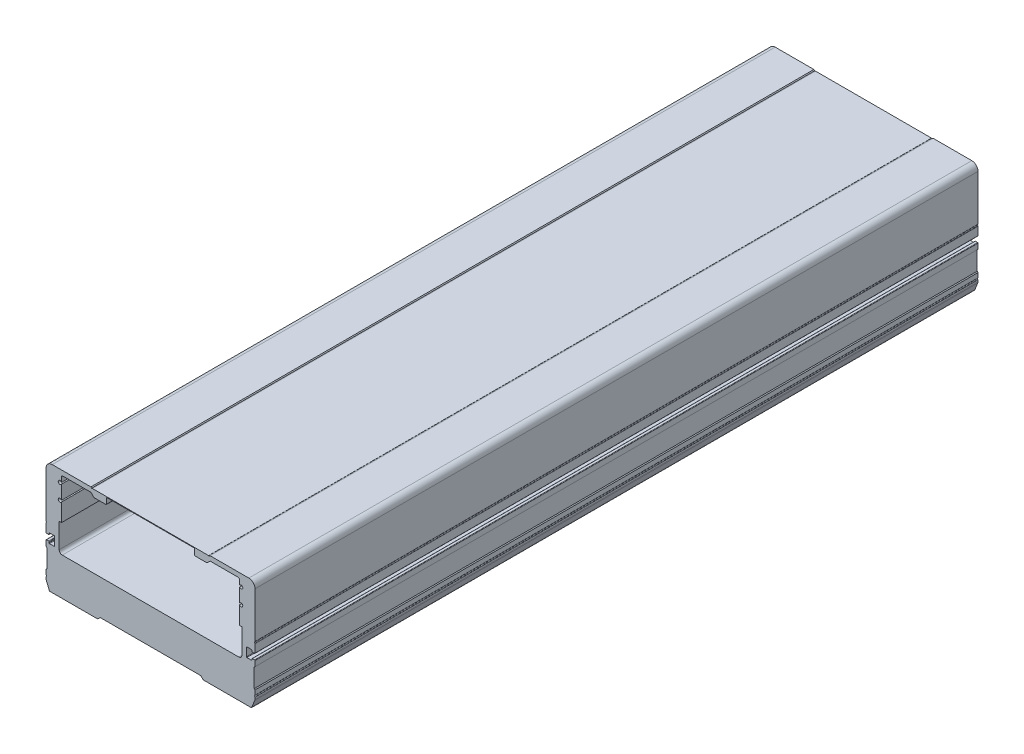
ISO-10303-21;
HEADER;
FILE_DESCRIPTION(('STEP AP214'),'2;1');
FILE_NAME('part.step','',(''),(''),'','','');
FILE_SCHEMA(('AUTOMOTIVE_DESIGN { 1 0 10303 214 1 1 1 1 }'));
ENDSEC;
DATA;
#1=APPLICATION_CONTEXT('core data for automotive mechanical design processes');
#2=APPLICATION_PROTOCOL_DEFINITION('international standard','automotive_design',2000,#1);
#3=PRODUCT_CONTEXT('',#1,'mechanical');
#4=PRODUCT('Part','Part','',(#3));
#5=PRODUCT_RELATED_PRODUCT_CATEGORY('part','',(#4));
#6=PRODUCT_DEFINITION_FORMATION('','',#4);
#7=PRODUCT_DEFINITION_CONTEXT('part definition',#1,'design');
#8=PRODUCT_DEFINITION('design','',#6,#7);
#9=PRODUCT_DEFINITION_SHAPE('','',#8);
#10=(LENGTH_UNIT() NAMED_UNIT(*) SI_UNIT(.MILLI.,.METRE.));
#11=(NAMED_UNIT(*) PLANE_ANGLE_UNIT() SI_UNIT($,.RADIAN.));
#12=(NAMED_UNIT(*) SI_UNIT($,.STERADIAN.) SOLID_ANGLE_UNIT());
#13=UNCERTAINTY_MEASURE_WITH_UNIT(LENGTH_MEASURE(1.E-05),#10,'distance_accuracy_value','');
#14=(GEOMETRIC_REPRESENTATION_CONTEXT(3) GLOBAL_UNCERTAINTY_ASSIGNED_CONTEXT((#13)) GLOBAL_UNIT_ASSIGNED_CONTEXT((#10,
#11,#12)) REPRESENTATION_CONTEXT('',''));
#15=CARTESIAN_POINT('',(0.,0.,0.));
#16=DIRECTION('',(0.,0.,1.));
#17=DIRECTION('',(1.,0.,0.));
#18=AXIS2_PLACEMENT_3D('',#15,#16,#17);
#19=CARTESIAN_POINT('',(-63.4999999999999,66.1,-467.));
#20=DIRECTION('',(0.,0.,1.));
#21=DIRECTION('',(1.,0.,0.));
#22=AXIS2_PLACEMENT_3D('',#19,#20,#21);
#23=CYLINDRICAL_SURFACE('',#22,4.);
#24=CARTESIAN_POINT('',(-63.4999999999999,66.1,0.));
#25=DIRECTION('',(0.,0.,1.));
#26=DIRECTION('',(1.,0.,0.));
#27=AXIS2_PLACEMENT_3D('',#24,#25,#26);
#28=CIRCLE('',#27,4.);
#29=CARTESIAN_POINT('',(-63.4999999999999,70.1,0.));
#30=VERTEX_POINT('',#29);
#31=CARTESIAN_POINT('',(-67.4999999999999,66.1,0.));
#32=VERTEX_POINT('',#31);
#33=EDGE_CURVE('E965',#30,#32,#28,.T.);
#34=ORIENTED_EDGE('',*,*,#33,.F.);
#35=DIRECTION('',(0.,0.,1.));
#36=VECTOR('',#35,1.);
#37=CARTESIAN_POINT('',(-63.4999999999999,70.1,-467.));
#38=LINE('',#37,#36);
#39=CARTESIAN_POINT('',(-63.4999999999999,70.1,-467.));
#40=VERTEX_POINT('',#39);
#41=EDGE_CURVE('E11',#40,#30,#38,.T.);
#42=ORIENTED_EDGE('',*,*,#41,.F.);
#43=CARTESIAN_POINT('',(-63.4999999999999,66.1,-467.));
#44=DIRECTION('',(0.,0.,1.));
#45=DIRECTION('',(1.,0.,0.));
#46=AXIS2_PLACEMENT_3D('',#43,#44,#45);
#47=CIRCLE('',#46,4.);
#48=CARTESIAN_POINT('',(-67.4999999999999,66.1,-467.));
#49=VERTEX_POINT('',#48);
#50=EDGE_CURVE('E1025',#40,#49,#47,.T.);
#51=ORIENTED_EDGE('',*,*,#50,.T.);
#52=DIRECTION('',(0.,0.,1.));
#53=VECTOR('',#52,1.);
#54=CARTESIAN_POINT('',(-67.4999999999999,66.1,-467.));
#55=LINE('',#54,#53);
#56=EDGE_CURVE('E39',#49,#32,#55,.T.);
#57=ORIENTED_EDGE('',*,*,#56,.T.);
#58=EDGE_LOOP('',(#34,#42,#51,#57));
#59=FACE_BOUND('',#58,.T.);
#60=ADVANCED_FACE('F36',(#59),#23,.T.);
#61=CARTESIAN_POINT('',(-38.4999999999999,70.1,-467.));
#62=DIRECTION('',(0.,1.,0.));
#63=DIRECTION('',(-1.,0.,0.));
#64=AXIS2_PLACEMENT_3D('',#61,#62,#63);
#65=PLANE('',#64);
#66=DIRECTION('',(-1.,0.,0.));
#67=VECTOR('',#66,1.);
#68=CARTESIAN_POINT('',(-38.4999999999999,70.1,0.));
#69=LINE('',#68,#67);
#70=CARTESIAN_POINT('',(-38.4999999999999,70.1,0.));
#71=VERTEX_POINT('',#70);
#72=EDGE_CURVE('E1029',#71,#30,#69,.T.);
#73=ORIENTED_EDGE('',*,*,#72,.F.);
#74=DIRECTION('',(0.,0.,1.));
#75=VECTOR('',#74,1.);
#76=CARTESIAN_POINT('',(-38.4999999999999,70.1,-467.));
#77=LINE('',#76,#75);
#78=CARTESIAN_POINT('',(-38.4999999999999,70.1,-467.));
#79=VERTEX_POINT('',#78);
#80=EDGE_CURVE('E44',#79,#71,#77,.T.);
#81=ORIENTED_EDGE('',*,*,#80,.F.);
#82=DIRECTION('',(-1.,0.,0.));
#83=VECTOR('',#82,1.);
#84=CARTESIAN_POINT('',(-38.4999999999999,70.1,-467.));
#85=LINE('',#84,#83);
#86=EDGE_CURVE('E1263',#79,#40,#85,.T.);
#87=ORIENTED_EDGE('',*,*,#86,.T.);
#88=ORIENTED_EDGE('',*,*,#41,.T.);
#89=EDGE_LOOP('',(#73,#81,#87,#88));
#90=FACE_BOUND('',#89,.T.);
#91=ADVANCED_FACE('F1670',(#90),#65,.T.);
#92=CARTESIAN_POINT('',(-37.9999999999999,69.6,-467.));
#93=DIRECTION('',(0.707106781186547,0.707106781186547,0.));
#94=DIRECTION('',(-0.707106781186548,0.707106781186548,0.));
#95=AXIS2_PLACEMENT_3D('',#92,#93,#94);
#96=PLANE('',#95);
#97=DIRECTION('',(-0.707106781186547,0.707106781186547,0.));
#98=VECTOR('',#97,1.);
#99=CARTESIAN_POINT('',(-37.9999999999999,69.6,0.));
#100=LINE('',#99,#98);
#101=CARTESIAN_POINT('',(-37.9999999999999,69.6,0.));
#102=VERTEX_POINT('',#101);
#103=EDGE_CURVE('E1499',#102,#71,#100,.T.);
#104=ORIENTED_EDGE('',*,*,#103,.F.);
#105=DIRECTION('',(0.,0.,1.));
#106=VECTOR('',#105,1.);
#107=CARTESIAN_POINT('',(-37.9999999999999,69.6,-467.));
#108=LINE('',#107,#106);
#109=CARTESIAN_POINT('',(-37.9999999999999,69.6,-467.));
#110=VERTEX_POINT('',#109);
#111=EDGE_CURVE('E1505',#110,#102,#108,.T.);
#112=ORIENTED_EDGE('',*,*,#111,.F.);
#113=DIRECTION('',(-0.707106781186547,0.707106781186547,0.));
#114=VECTOR('',#113,1.);
#115=CARTESIAN_POINT('',(-37.9999999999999,69.6,-467.));
#116=LINE('',#115,#114);
#117=EDGE_CURVE('E1260',#110,#79,#116,.T.);
#118=ORIENTED_EDGE('',*,*,#117,.T.);
#119=ORIENTED_EDGE('',*,*,#80,.T.);
#120=EDGE_LOOP('',(#104,#112,#118,#119));
#121=FACE_BOUND('',#120,.T.);
#122=ADVANCED_FACE('F1979',(#121),#96,.T.);
#123=CARTESIAN_POINT('',(-37.4999999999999,69.6,-467.));
#124=DIRECTION('',(0.,1.,0.));
#125=DIRECTION('',(0.,0.,1.));
#126=AXIS2_PLACEMENT_3D('',#123,#124,#125);
#127=PLANE('',#126);
#128=DIRECTION('',(-1.,0.,0.));
#129=VECTOR('',#128,1.);
#130=CARTESIAN_POINT('',(-37.4999999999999,69.6,0.));
#131=LINE('',#130,#129);
#132=CARTESIAN_POINT('',(-37.4999999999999,69.6,0.));
#133=VERTEX_POINT('',#132);
#134=EDGE_CURVE('E1496',#133,#102,#131,.T.);
#135=ORIENTED_EDGE('',*,*,#134,.F.);
#136=DIRECTION('',(0.,0.,1.));
#137=VECTOR('',#136,1.);
#138=CARTESIAN_POINT('',(-37.4999999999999,69.6,-467.));
#139=LINE('',#138,#137);
#140=CARTESIAN_POINT('',(-37.4999999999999,69.6,-467.));
#141=VERTEX_POINT('',#140);
#142=EDGE_CURVE('E1507',#141,#133,#139,.T.);
#143=ORIENTED_EDGE('',*,*,#142,.F.);
#144=DIRECTION('',(-1.,0.,0.));
#145=VECTOR('',#144,1.);
#146=CARTESIAN_POINT('',(-37.4999999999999,69.6,-467.));
#147=LINE('',#146,#145);
#148=EDGE_CURVE('E1257',#141,#110,#147,.T.);
#149=ORIENTED_EDGE('',*,*,#148,.T.);
#150=ORIENTED_EDGE('',*,*,#111,.T.);
#151=EDGE_LOOP('',(#135,#143,#149,#150));
#152=FACE_BOUND('',#151,.T.);
#153=ADVANCED_FACE('F1977',(#152),#127,.T.);
#154=CARTESIAN_POINT('',(-37.4999999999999,69.7,-467.));
#155=DIRECTION('',(-1.,0.,0.));
#156=DIRECTION('',(0.,0.,1.));
#157=AXIS2_PLACEMENT_3D('',#154,#155,#156);
#158=PLANE('',#157);
#159=DIRECTION('',(0.,-1.,0.));
#160=VECTOR('',#159,1.);
#161=CARTESIAN_POINT('',(-37.4999999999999,69.7,0.));
#162=LINE('',#161,#160);
#163=CARTESIAN_POINT('',(-37.4999999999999,69.7,0.));
#164=VERTEX_POINT('',#163);
#165=EDGE_CURVE('E1493',#164,#133,#162,.T.);
#166=ORIENTED_EDGE('',*,*,#165,.F.);
#167=DIRECTION('',(0.,0.,1.));
#168=VECTOR('',#167,1.);
#169=CARTESIAN_POINT('',(-37.4999999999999,69.7,-467.));
#170=LINE('',#169,#168);
#171=CARTESIAN_POINT('',(-37.4999999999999,69.7,-467.));
#172=VERTEX_POINT('',#171);
#173=EDGE_CURVE('E1509',#172,#164,#170,.T.);
#174=ORIENTED_EDGE('',*,*,#173,.F.);
#175=DIRECTION('',(0.,-1.,0.));
#176=VECTOR('',#175,1.);
#177=CARTESIAN_POINT('',(-37.4999999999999,69.7,-467.));
#178=LINE('',#177,#176);
#179=EDGE_CURVE('E1254',#172,#141,#178,.T.);
#180=ORIENTED_EDGE('',*,*,#179,.T.);
#181=ORIENTED_EDGE('',*,*,#142,.T.);
#182=EDGE_LOOP('',(#166,#174,#180,#181));
#183=FACE_BOUND('',#182,.T.);
#184=ADVANCED_FACE('F1973',(#183),#158,.T.);
#185=CARTESIAN_POINT('',(37.4999999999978,69.7,-467.));
#186=DIRECTION('',(0.,1.,0.));
#187=DIRECTION('',(0.,0.,1.));
#188=AXIS2_PLACEMENT_3D('',#185,#186,#187);
#189=PLANE('',#188);
#190=DIRECTION('',(-1.,0.,0.));
#191=VECTOR('',#190,1.);
#192=CARTESIAN_POINT('',(37.4999999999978,69.7,0.));
#193=LINE('',#192,#191);
#194=CARTESIAN_POINT('',(37.4999999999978,69.7,0.));
#195=VERTEX_POINT('',#194);
#196=EDGE_CURVE('E1490',#195,#164,#193,.T.);
#197=ORIENTED_EDGE('',*,*,#196,.F.);
#198=DIRECTION('',(0.,0.,1.));
#199=VECTOR('',#198,1.);
#200=CARTESIAN_POINT('',(37.4999999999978,69.7,-467.));
#201=LINE('',#200,#199);
#202=CARTESIAN_POINT('',(37.4999999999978,69.7,-467.));
#203=VERTEX_POINT('',#202);
#204=EDGE_CURVE('E1511',#203,#195,#201,.T.);
#205=ORIENTED_EDGE('',*,*,#204,.F.);
#206=DIRECTION('',(-1.,0.,0.));
#207=VECTOR('',#206,1.);
#208=CARTESIAN_POINT('',(37.4999999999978,69.7,-467.));
#209=LINE('',#208,#207);
#210=EDGE_CURVE('E1251',#203,#172,#209,.T.);
#211=ORIENTED_EDGE('',*,*,#210,.T.);
#212=ORIENTED_EDGE('',*,*,#173,.T.);
#213=EDGE_LOOP('',(#197,#205,#211,#212));
#214=FACE_BOUND('',#213,.T.);
#215=ADVANCED_FACE('F1969',(#214),#189,.T.);
#216=CARTESIAN_POINT('',(37.4999999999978,69.6000000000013,-467.));
#217=DIRECTION('',(1.,0.,0.));
#218=DIRECTION('',(0.,0.,-1.));
#219=AXIS2_PLACEMENT_3D('',#216,#217,#218);
#220=PLANE('',#219);
#221=DIRECTION('',(0.,1.,0.));
#222=VECTOR('',#221,1.);
#223=CARTESIAN_POINT('',(37.4999999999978,69.6000000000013,0.));
#224=LINE('',#223,#222);
#225=CARTESIAN_POINT('',(37.4999999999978,69.6000000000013,0.));
#226=VERTEX_POINT('',#225);
#227=EDGE_CURVE('E1487',#226,#195,#224,.T.);
#228=ORIENTED_EDGE('',*,*,#227,.F.);
#229=DIRECTION('',(0.,0.,1.));
#230=VECTOR('',#229,1.);
#231=CARTESIAN_POINT('',(37.4999999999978,69.6000000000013,-467.));
#232=LINE('',#231,#230);
#233=CARTESIAN_POINT('',(37.4999999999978,69.6000000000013,-467.));
#234=VERTEX_POINT('',#233);
#235=EDGE_CURVE('E1513',#234,#226,#232,.T.);
#236=ORIENTED_EDGE('',*,*,#235,.F.);
#237=DIRECTION('',(0.,1.,0.));
#238=VECTOR('',#237,1.);
#239=CARTESIAN_POINT('',(37.4999999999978,69.6000000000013,-467.));
#240=LINE('',#239,#238);
#241=EDGE_CURVE('E1248',#234,#203,#240,.T.);
#242=ORIENTED_EDGE('',*,*,#241,.T.);
#243=ORIENTED_EDGE('',*,*,#204,.T.);
#244=EDGE_LOOP('',(#228,#236,#242,#243));
#245=FACE_BOUND('',#244,.T.);
#246=ADVANCED_FACE('F1965',(#245),#220,.T.);
#247=CARTESIAN_POINT('',(37.9999999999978,69.6000000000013,-467.));
#248=DIRECTION('',(0.,1.,0.));
#249=DIRECTION('',(0.,0.,1.));
#250=AXIS2_PLACEMENT_3D('',#247,#248,#249);
#251=PLANE('',#250);
#252=DIRECTION('',(-1.,0.,0.));
#253=VECTOR('',#252,1.);
#254=CARTESIAN_POINT('',(37.9999999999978,69.6000000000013,0.));
#255=LINE('',#254,#253);
#256=CARTESIAN_POINT('',(37.9999999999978,69.6000000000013,0.));
#257=VERTEX_POINT('',#256);
#258=EDGE_CURVE('E1484',#257,#226,#255,.T.);
#259=ORIENTED_EDGE('',*,*,#258,.F.);
#260=DIRECTION('',(0.,0.,1.));
#261=VECTOR('',#260,1.);
#262=CARTESIAN_POINT('',(37.9999999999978,69.6000000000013,-467.));
#263=LINE('',#262,#261);
#264=CARTESIAN_POINT('',(37.9999999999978,69.6000000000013,-467.));
#265=VERTEX_POINT('',#264);
#266=EDGE_CURVE('E1515',#265,#257,#263,.T.);
#267=ORIENTED_EDGE('',*,*,#266,.F.);
#268=DIRECTION('',(-1.,0.,0.));
#269=VECTOR('',#268,1.);
#270=CARTESIAN_POINT('',(37.9999999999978,69.6000000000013,-467.));
#271=LINE('',#270,#269);
#272=EDGE_CURVE('E1245',#265,#234,#271,.T.);
#273=ORIENTED_EDGE('',*,*,#272,.T.);
#274=ORIENTED_EDGE('',*,*,#235,.T.);
#275=EDGE_LOOP('',(#259,#267,#273,#274));
#276=FACE_BOUND('',#275,.T.);
#277=ADVANCED_FACE('F1961',(#276),#251,.T.);
#278=CARTESIAN_POINT('',(38.4999999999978,70.1000000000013,-467.));
#279=DIRECTION('',(-0.707106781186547,0.707106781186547,0.));
#280=DIRECTION('',(-0.707106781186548,-0.707106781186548,0.));
#281=AXIS2_PLACEMENT_3D('',#278,#279,#280);
#282=PLANE('',#281);
#283=DIRECTION('',(-0.707106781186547,-0.707106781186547,0.));
#284=VECTOR('',#283,1.);
#285=CARTESIAN_POINT('',(38.4999999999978,70.1000000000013,0.));
#286=LINE('',#285,#284);
#287=CARTESIAN_POINT('',(38.4999999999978,70.1000000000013,0.));
#288=VERTEX_POINT('',#287);
#289=EDGE_CURVE('E1481',#288,#257,#286,.T.);
#290=ORIENTED_EDGE('',*,*,#289,.F.);
#291=DIRECTION('',(0.,0.,1.));
#292=VECTOR('',#291,1.);
#293=CARTESIAN_POINT('',(38.4999999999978,70.1000000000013,-467.));
#294=LINE('',#293,#292);
#295=CARTESIAN_POINT('',(38.4999999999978,70.1000000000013,-467.));
#296=VERTEX_POINT('',#295);
#297=EDGE_CURVE('E1517',#296,#288,#294,.T.);
#298=ORIENTED_EDGE('',*,*,#297,.F.);
#299=DIRECTION('',(-0.707106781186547,-0.707106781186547,0.));
#300=VECTOR('',#299,1.);
#301=CARTESIAN_POINT('',(38.4999999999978,70.1000000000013,-467.));
#302=LINE('',#301,#300);
#303=EDGE_CURVE('E1242',#296,#265,#302,.T.);
#304=ORIENTED_EDGE('',*,*,#303,.T.);
#305=ORIENTED_EDGE('',*,*,#266,.T.);
#306=EDGE_LOOP('',(#290,#298,#304,#305));
#307=FACE_BOUND('',#306,.T.);
#308=ADVANCED_FACE('F1957',(#307),#282,.T.);
#309=CARTESIAN_POINT('',(63.4999999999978,70.1000000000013,-467.));
#310=DIRECTION('',(0.,1.,0.));
#311=DIRECTION('',(0.,0.,1.));
#312=AXIS2_PLACEMENT_3D('',#309,#310,#311);
#313=PLANE('',#312);
#314=DIRECTION('',(-1.,0.,0.));
#315=VECTOR('',#314,1.);
#316=CARTESIAN_POINT('',(63.4999999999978,70.1000000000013,0.));
#317=LINE('',#316,#315);
#318=CARTESIAN_POINT('',(63.4999999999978,70.1000000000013,0.));
#319=VERTEX_POINT('',#318);
#320=EDGE_CURVE('E1478',#319,#288,#317,.T.);
#321=ORIENTED_EDGE('',*,*,#320,.F.);
#322=DIRECTION('',(0.,0.,1.));
#323=VECTOR('',#322,1.);
#324=CARTESIAN_POINT('',(63.4999999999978,70.1000000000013,-467.));
#325=LINE('',#324,#323);
#326=CARTESIAN_POINT('',(63.4999999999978,70.1000000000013,-467.));
#327=VERTEX_POINT('',#326);
#328=EDGE_CURVE('E1519',#327,#319,#325,.T.);
#329=ORIENTED_EDGE('',*,*,#328,.F.);
#330=DIRECTION('',(-1.,0.,0.));
#331=VECTOR('',#330,1.);
#332=CARTESIAN_POINT('',(63.4999999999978,70.1000000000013,-467.));
#333=LINE('',#332,#331);
#334=EDGE_CURVE('E1239',#327,#296,#333,.T.);
#335=ORIENTED_EDGE('',*,*,#334,.T.);
#336=ORIENTED_EDGE('',*,*,#297,.T.);
#337=EDGE_LOOP('',(#321,#329,#335,#336));
#338=FACE_BOUND('',#337,.T.);
#339=ADVANCED_FACE('F1953',(#338),#313,.T.);
#340=CARTESIAN_POINT('',(63.4999999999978,66.1000000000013,-467.));
#341=DIRECTION('',(0.,0.,1.));
#342=DIRECTION('',(1.,0.,0.));
#343=AXIS2_PLACEMENT_3D('',#340,#341,#342);
#344=CYLINDRICAL_SURFACE('',#343,4.);
#345=CARTESIAN_POINT('',(63.4999999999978,66.1000000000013,0.));
#346=DIRECTION('',(0.,0.,1.));
#347=DIRECTION('',(1.,0.,0.));
#348=AXIS2_PLACEMENT_3D('',#345,#346,#347);
#349=CIRCLE('',#348,4.);
#350=CARTESIAN_POINT('',(67.4999999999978,66.1000000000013,0.));
#351=VERTEX_POINT('',#350);
#352=EDGE_CURVE('E1475',#351,#319,#349,.T.);
#353=ORIENTED_EDGE('',*,*,#352,.F.);
#354=DIRECTION('',(0.,0.,1.));
#355=VECTOR('',#354,1.);
#356=CARTESIAN_POINT('',(67.4999999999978,66.1000000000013,-467.));
#357=LINE('',#356,#355);
#358=CARTESIAN_POINT('',(67.4999999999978,66.1000000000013,-467.));
#359=VERTEX_POINT('',#358);
#360=EDGE_CURVE('E1521',#359,#351,#357,.T.);
#361=ORIENTED_EDGE('',*,*,#360,.F.);
#362=CARTESIAN_POINT('',(63.4999999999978,66.1000000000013,-467.));
#363=DIRECTION('',(0.,0.,1.));
#364=DIRECTION('',(1.,0.,0.));
#365=AXIS2_PLACEMENT_3D('',#362,#363,#364);
#366=CIRCLE('',#365,4.);
#367=EDGE_CURVE('E1236',#359,#327,#366,.T.);
#368=ORIENTED_EDGE('',*,*,#367,.T.);
#369=ORIENTED_EDGE('',*,*,#328,.T.);
#370=EDGE_LOOP('',(#353,#361,#368,#369));
#371=FACE_BOUND('',#370,.T.);
#372=ADVANCED_FACE('F1949',(#371),#344,.T.);
#373=CARTESIAN_POINT('',(67.4999999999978,36.6046693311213,-467.));
#374=DIRECTION('',(1.,0.,0.));
#375=DIRECTION('',(0.,0.,-1.));
#376=AXIS2_PLACEMENT_3D('',#373,#374,#375);
#377=PLANE('',#376);
#378=DIRECTION('',(0.,1.,0.));
#379=VECTOR('',#378,1.);
#380=CARTESIAN_POINT('',(67.4999999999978,36.6046693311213,0.));
#381=LINE('',#380,#379);
#382=CARTESIAN_POINT('',(67.4999999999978,36.6046693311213,0.));
#383=VERTEX_POINT('',#382);
#384=EDGE_CURVE('E1472',#383,#351,#381,.T.);
#385=ORIENTED_EDGE('',*,*,#384,.F.);
#386=DIRECTION('',(0.,0.,1.));
#387=VECTOR('',#386,1.);
#388=CARTESIAN_POINT('',(67.4999999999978,36.6046693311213,-467.));
#389=LINE('',#388,#387);
#390=CARTESIAN_POINT('',(67.4999999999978,36.6046693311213,-467.));
#391=VERTEX_POINT('',#390);
#392=EDGE_CURVE('E1523',#391,#383,#389,.T.);
#393=ORIENTED_EDGE('',*,*,#392,.F.);
#394=DIRECTION('',(0.,1.,0.));
#395=VECTOR('',#394,1.);
#396=CARTESIAN_POINT('',(67.4999999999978,36.6046693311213,-467.));
#397=LINE('',#396,#395);
#398=EDGE_CURVE('E1233',#391,#359,#397,.T.);
#399=ORIENTED_EDGE('',*,*,#398,.T.);
#400=ORIENTED_EDGE('',*,*,#360,.T.);
#401=EDGE_LOOP('',(#385,#393,#399,#400));
#402=FACE_BOUND('',#401,.T.);
#403=ADVANCED_FACE('F1945',(#402),#377,.T.);
#404=CARTESIAN_POINT('',(67.1999999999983,36.6046693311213,-467.));
#405=DIRECTION('',(0.,0.,1.));
#406=DIRECTION('',(1.,0.,0.));
#407=AXIS2_PLACEMENT_3D('',#404,#405,#406);
#408=CYLINDRICAL_SURFACE('',#407,0.299999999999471);
#409=CARTESIAN_POINT('',(67.1999999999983,36.6046693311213,0.));
#410=DIRECTION('',(0.,0.,1.));
#411=DIRECTION('',(1.,0.,0.));
#412=AXIS2_PLACEMENT_3D('',#409,#410,#411);
#413=CIRCLE('',#412,0.299999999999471);
#414=CARTESIAN_POINT('',(67.3333333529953,36.3359274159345,0.));
#415=VERTEX_POINT('',#414);
#416=EDGE_CURVE('E1469',#415,#383,#413,.T.);
#417=ORIENTED_EDGE('',*,*,#416,.F.);
#418=DIRECTION('',(0.,0.,1.));
#419=VECTOR('',#418,1.);
#420=CARTESIAN_POINT('',(67.3333333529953,36.3359274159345,-467.));
#421=LINE('',#420,#419);
#422=CARTESIAN_POINT('',(67.3333333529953,36.3359274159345,-467.));
#423=VERTEX_POINT('',#422);
#424=EDGE_CURVE('E1525',#423,#415,#421,.T.);
#425=ORIENTED_EDGE('',*,*,#424,.F.);
#426=CARTESIAN_POINT('',(67.1999999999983,36.6046693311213,-467.));
#427=DIRECTION('',(0.,0.,1.));
#428=DIRECTION('',(1.,0.,0.));
#429=AXIS2_PLACEMENT_3D('',#426,#427,#428);
#430=CIRCLE('',#429,0.299999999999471);
#431=EDGE_CURVE('E1230',#423,#391,#430,.T.);
#432=ORIENTED_EDGE('',*,*,#431,.T.);
#433=ORIENTED_EDGE('',*,*,#392,.T.);
#434=EDGE_LOOP('',(#417,#425,#432,#433));
#435=FACE_BOUND('',#434,.T.);
#436=ADVANCED_FACE('F1941',(#435),#408,.T.);
#437=CARTESIAN_POINT('',(67.4999999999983,36.0000000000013,-467.));
#438=DIRECTION('',(0.,0.,1.));
#439=DIRECTION('',(1.,0.,0.));
#440=AXIS2_PLACEMENT_3D('',#437,#438,#439);
#441=CYLINDRICAL_SURFACE('',#440,0.374999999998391);
#442=CARTESIAN_POINT('',(67.4999999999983,36.0000000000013,0.));
#443=DIRECTION('',(0.,0.,-1.));
#444=DIRECTION('',(1.,0.,0.));
#445=AXIS2_PLACEMENT_3D('',#442,#443,#444);
#446=CIRCLE('',#445,0.374999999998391);
#447=CARTESIAN_POINT('',(67.3333333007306,35.6640726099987,0.));
#448=VERTEX_POINT('',#447);
#449=EDGE_CURVE('E1466',#448,#415,#446,.T.);
#450=ORIENTED_EDGE('',*,*,#449,.F.);
#451=DIRECTION('',(0.,0.,1.));
#452=VECTOR('',#451,1.);
#453=CARTESIAN_POINT('',(67.3333333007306,35.6640726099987,-467.));
#454=LINE('',#453,#452);
#455=CARTESIAN_POINT('',(67.3333333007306,35.6640726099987,-467.));
#456=VERTEX_POINT('',#455);
#457=EDGE_CURVE('E1527',#456,#448,#454,.T.);
#458=ORIENTED_EDGE('',*,*,#457,.F.);
#459=CARTESIAN_POINT('',(67.4999999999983,36.0000000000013,-467.));
#460=DIRECTION('',(0.,0.,-1.));
#461=DIRECTION('',(1.,0.,0.));
#462=AXIS2_PLACEMENT_3D('',#459,#460,#461);
#463=CIRCLE('',#462,0.374999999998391);
#464=EDGE_CURVE('E1227',#456,#423,#463,.T.);
#465=ORIENTED_EDGE('',*,*,#464,.T.);
#466=ORIENTED_EDGE('',*,*,#424,.T.);
#467=EDGE_LOOP('',(#450,#458,#465,#466));
#468=FACE_BOUND('',#467,.T.);
#469=ADVANCED_FACE('F1937',(#468),#441,.F.);
#470=CARTESIAN_POINT('',(67.1999999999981,35.3953306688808,-467.));
#471=DIRECTION('',(0.,0.,1.));
#472=DIRECTION('',(1.,0.,0.));
#473=AXIS2_PLACEMENT_3D('',#470,#471,#472);
#474=CYLINDRICAL_SURFACE('',#473,0.299999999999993);
#475=CARTESIAN_POINT('',(67.1999999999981,35.3953306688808,0.));
#476=DIRECTION('',(0.,0.,1.));
#477=DIRECTION('',(1.,0.,0.));
#478=AXIS2_PLACEMENT_3D('',#475,#476,#477);
#479=CIRCLE('',#478,0.299999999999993);
#480=CARTESIAN_POINT('',(67.4999999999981,35.3953306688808,0.));
#481=VERTEX_POINT('',#480);
#482=EDGE_CURVE('E1463',#481,#448,#479,.T.);
#483=ORIENTED_EDGE('',*,*,#482,.F.);
#484=DIRECTION('',(0.,0.,1.));
#485=VECTOR('',#484,1.);
#486=CARTESIAN_POINT('',(67.4999999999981,35.3953306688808,-467.));
#487=LINE('',#486,#485);
#488=CARTESIAN_POINT('',(67.4999999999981,35.3953306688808,-467.));
#489=VERTEX_POINT('',#488);
#490=EDGE_CURVE('E1529',#489,#481,#487,.T.);
#491=ORIENTED_EDGE('',*,*,#490,.F.);
#492=CARTESIAN_POINT('',(67.1999999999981,35.3953306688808,-467.));
#493=DIRECTION('',(0.,0.,1.));
#494=DIRECTION('',(1.,0.,0.));
#495=AXIS2_PLACEMENT_3D('',#492,#493,#494);
#496=CIRCLE('',#495,0.299999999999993);
#497=EDGE_CURVE('E1224',#489,#456,#496,.T.);
#498=ORIENTED_EDGE('',*,*,#497,.T.);
#499=ORIENTED_EDGE('',*,*,#457,.T.);
#500=EDGE_LOOP('',(#483,#491,#498,#499));
#501=FACE_BOUND('',#500,.T.);
#502=ADVANCED_FACE('F1933',(#501),#474,.T.);
#503=CARTESIAN_POINT('',(67.4999999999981,30.1000000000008,-467.));
#504=DIRECTION('',(1.,0.,0.));
#505=DIRECTION('',(0.,0.,-1.));
#506=AXIS2_PLACEMENT_3D('',#503,#504,#505);
#507=PLANE('',#506);
#508=DIRECTION('',(0.,1.,0.));
#509=VECTOR('',#508,1.);
#510=CARTESIAN_POINT('',(67.4999999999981,30.1000000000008,0.));
#511=LINE('',#510,#509);
#512=CARTESIAN_POINT('',(67.4999999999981,30.1000000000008,0.));
#513=VERTEX_POINT('',#512);
#514=EDGE_CURVE('E1460',#513,#481,#511,.T.);
#515=ORIENTED_EDGE('',*,*,#514,.F.);
#516=DIRECTION('',(0.,0.,1.));
#517=VECTOR('',#516,1.);
#518=CARTESIAN_POINT('',(67.4999999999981,30.1000000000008,-467.));
#519=LINE('',#518,#517);
#520=CARTESIAN_POINT('',(67.4999999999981,30.1000000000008,-467.));
#521=VERTEX_POINT('',#520);
#522=EDGE_CURVE('E1531',#521,#513,#519,.T.);
#523=ORIENTED_EDGE('',*,*,#522,.F.);
#524=DIRECTION('',(0.,1.,0.));
#525=VECTOR('',#524,1.);
#526=CARTESIAN_POINT('',(67.4999999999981,30.1000000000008,-467.));
#527=LINE('',#526,#525);
#528=EDGE_CURVE('E1221',#521,#489,#527,.T.);
#529=ORIENTED_EDGE('',*,*,#528,.T.);
#530=ORIENTED_EDGE('',*,*,#490,.T.);
#531=EDGE_LOOP('',(#515,#523,#529,#530));
#532=FACE_BOUND('',#531,.T.);
#533=ADVANCED_FACE('F1929',(#532),#507,.T.);
#534=CARTESIAN_POINT('',(67.1999999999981,30.1000000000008,-467.));
#535=DIRECTION('',(0.,0.,1.));
#536=DIRECTION('',(1.,0.,0.));
#537=AXIS2_PLACEMENT_3D('',#534,#535,#536);
#538=CYLINDRICAL_SURFACE('',#537,0.299999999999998);
#539=CARTESIAN_POINT('',(67.1999999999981,30.1000000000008,0.));
#540=DIRECTION('',(0.,0.,1.));
#541=DIRECTION('',(1.,0.,0.));
#542=AXIS2_PLACEMENT_3D('',#539,#540,#541);
#543=CIRCLE('',#542,0.299999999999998);
#544=CARTESIAN_POINT('',(67.1999999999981,29.8000000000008,0.));
#545=VERTEX_POINT('',#544);
#546=EDGE_CURVE('E1457',#545,#513,#543,.T.);
#547=ORIENTED_EDGE('',*,*,#546,.F.);
#548=DIRECTION('',(0.,0.,1.));
#549=VECTOR('',#548,1.);
#550=CARTESIAN_POINT('',(67.1999999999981,29.8000000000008,-467.));
#551=LINE('',#550,#549);
#552=CARTESIAN_POINT('',(67.1999999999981,29.8000000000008,-467.));
#553=VERTEX_POINT('',#552);
#554=EDGE_CURVE('E1533',#553,#545,#551,.T.);
#555=ORIENTED_EDGE('',*,*,#554,.F.);
#556=CARTESIAN_POINT('',(67.1999999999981,30.1000000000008,-467.));
#557=DIRECTION('',(0.,0.,1.));
#558=DIRECTION('',(1.,0.,0.));
#559=AXIS2_PLACEMENT_3D('',#556,#557,#558);
#560=CIRCLE('',#559,0.299999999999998);
#561=EDGE_CURVE('E1218',#553,#521,#560,.T.);
#562=ORIENTED_EDGE('',*,*,#561,.T.);
#563=ORIENTED_EDGE('',*,*,#522,.T.);
#564=EDGE_LOOP('',(#547,#555,#562,#563));
#565=FACE_BOUND('',#564,.T.);
#566=ADVANCED_FACE('F1925',(#565),#538,.T.);
#567=CARTESIAN_POINT('',(65.7999999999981,29.8000000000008,-467.));
#568=DIRECTION('',(0.,-1.,0.));
#569=DIRECTION('',(0.,0.,-1.));
#570=AXIS2_PLACEMENT_3D('',#567,#568,#569);
#571=PLANE('',#570);
#572=DIRECTION('',(1.,0.,0.));
#573=VECTOR('',#572,1.);
#574=CARTESIAN_POINT('',(65.7999999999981,29.8000000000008,0.));
#575=LINE('',#574,#573);
#576=CARTESIAN_POINT('',(65.7999999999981,29.8000000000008,0.));
#577=VERTEX_POINT('',#576);
#578=EDGE_CURVE('E1454',#577,#545,#575,.T.);
#579=ORIENTED_EDGE('',*,*,#578,.F.);
#580=DIRECTION('',(0.,0.,1.));
#581=VECTOR('',#580,1.);
#582=CARTESIAN_POINT('',(65.7999999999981,29.8000000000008,-467.));
#583=LINE('',#582,#581);
#584=CARTESIAN_POINT('',(65.7999999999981,29.8000000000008,-467.));
#585=VERTEX_POINT('',#584);
#586=EDGE_CURVE('E1535',#585,#577,#583,.T.);
#587=ORIENTED_EDGE('',*,*,#586,.F.);
#588=DIRECTION('',(1.,0.,0.));
#589=VECTOR('',#588,1.);
#590=CARTESIAN_POINT('',(65.7999999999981,29.8000000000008,-467.));
#591=LINE('',#590,#589);
#592=EDGE_CURVE('E1215',#585,#553,#591,.T.);
#593=ORIENTED_EDGE('',*,*,#592,.T.);
#594=ORIENTED_EDGE('',*,*,#554,.T.);
#595=EDGE_LOOP('',(#579,#587,#593,#594));
#596=FACE_BOUND('',#595,.T.);
#597=ADVANCED_FACE('F1921',(#596),#571,.T.);
#598=CARTESIAN_POINT('',(65.7999999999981,30.1000000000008,-467.));
#599=DIRECTION('',(0.,0.,1.));
#600=DIRECTION('',(1.,0.,0.));
#601=AXIS2_PLACEMENT_3D('',#598,#599,#600);
#602=CYLINDRICAL_SURFACE('',#601,0.299999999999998);
#603=CARTESIAN_POINT('',(65.7999999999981,30.1000000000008,0.));
#604=DIRECTION('',(0.,0.,1.));
#605=DIRECTION('',(1.,0.,0.));
#606=AXIS2_PLACEMENT_3D('',#603,#604,#605);
#607=CIRCLE('',#606,0.299999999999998);
#608=CARTESIAN_POINT('',(65.4999999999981,30.1000000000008,0.));
#609=VERTEX_POINT('',#608);
#610=EDGE_CURVE('E1451',#609,#577,#607,.T.);
#611=ORIENTED_EDGE('',*,*,#610,.F.);
#612=DIRECTION('',(0.,0.,1.));
#613=VECTOR('',#612,1.);
#614=CARTESIAN_POINT('',(65.4999999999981,30.1000000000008,-467.));
#615=LINE('',#614,#613);
#616=CARTESIAN_POINT('',(65.4999999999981,30.1000000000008,-467.));
#617=VERTEX_POINT('',#616);
#618=EDGE_CURVE('E1537',#617,#609,#615,.T.);
#619=ORIENTED_EDGE('',*,*,#618,.F.);
#620=CARTESIAN_POINT('',(65.7999999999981,30.1000000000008,-467.));
#621=DIRECTION('',(0.,0.,1.));
#622=DIRECTION('',(1.,0.,0.));
#623=AXIS2_PLACEMENT_3D('',#620,#621,#622);
#624=CIRCLE('',#623,0.299999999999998);
#625=EDGE_CURVE('E1212',#617,#585,#624,.T.);
#626=ORIENTED_EDGE('',*,*,#625,.T.);
#627=ORIENTED_EDGE('',*,*,#586,.T.);
#628=EDGE_LOOP('',(#611,#619,#626,#627));
#629=FACE_BOUND('',#628,.T.);
#630=ADVANCED_FACE('F1917',(#629),#602,.T.);
#631=CARTESIAN_POINT('',(65.4999999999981,30.7000000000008,-467.));
#632=DIRECTION('',(-1.,0.,0.));
#633=DIRECTION('',(0.,0.,1.));
#634=AXIS2_PLACEMENT_3D('',#631,#632,#633);
#635=PLANE('',#634);
#636=DIRECTION('',(0.,-1.,0.));
#637=VECTOR('',#636,1.);
#638=CARTESIAN_POINT('',(65.4999999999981,30.7000000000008,0.));
#639=LINE('',#638,#637);
#640=CARTESIAN_POINT('',(65.4999999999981,30.7000000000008,0.));
#641=VERTEX_POINT('',#640);
#642=EDGE_CURVE('E1448',#641,#609,#639,.T.);
#643=ORIENTED_EDGE('',*,*,#642,.F.);
#644=DIRECTION('',(0.,0.,1.));
#645=VECTOR('',#644,1.);
#646=CARTESIAN_POINT('',(65.4999999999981,30.7000000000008,-467.));
#647=LINE('',#646,#645);
#648=CARTESIAN_POINT('',(65.4999999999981,30.7000000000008,-467.));
#649=VERTEX_POINT('',#648);
#650=EDGE_CURVE('E1539',#649,#641,#647,.T.);
#651=ORIENTED_EDGE('',*,*,#650,.F.);
#652=DIRECTION('',(0.,-1.,0.));
#653=VECTOR('',#652,1.);
#654=CARTESIAN_POINT('',(65.4999999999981,30.7000000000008,-467.));
#655=LINE('',#654,#653);
#656=EDGE_CURVE('E1209',#649,#617,#655,.T.);
#657=ORIENTED_EDGE('',*,*,#656,.T.);
#658=ORIENTED_EDGE('',*,*,#618,.T.);
#659=EDGE_LOOP('',(#643,#651,#657,#658));
#660=FACE_BOUND('',#659,.T.);
#661=ADVANCED_FACE('F1913',(#660),#635,.T.);
#662=CARTESIAN_POINT('',(65.1999999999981,30.7000000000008,-467.));
#663=DIRECTION('',(0.,0.,1.));
#664=DIRECTION('',(1.,0.,0.));
#665=AXIS2_PLACEMENT_3D('',#662,#663,#664);
#666=CYLINDRICAL_SURFACE('',#665,0.300000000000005);
#667=CARTESIAN_POINT('',(65.1999999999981,30.7000000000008,0.));
#668=DIRECTION('',(0.,0.,-1.));
#669=DIRECTION('',(1.,0.,0.));
#670=AXIS2_PLACEMENT_3D('',#667,#668,#669);
#671=CIRCLE('',#670,0.300000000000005);
#672=CARTESIAN_POINT('',(65.1999999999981,31.0000000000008,0.));
#673=VERTEX_POINT('',#672);
#674=EDGE_CURVE('E1445',#673,#641,#671,.T.);
#675=ORIENTED_EDGE('',*,*,#674,.F.);
#676=DIRECTION('',(0.,0.,1.));
#677=VECTOR('',#676,1.);
#678=CARTESIAN_POINT('',(65.1999999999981,31.0000000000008,-467.));
#679=LINE('',#678,#677);
#680=CARTESIAN_POINT('',(65.1999999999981,31.0000000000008,-467.));
#681=VERTEX_POINT('',#680);
#682=EDGE_CURVE('E1541',#681,#673,#679,.T.);
#683=ORIENTED_EDGE('',*,*,#682,.F.);
#684=CARTESIAN_POINT('',(65.1999999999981,30.7000000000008,-467.));
#685=DIRECTION('',(0.,0.,-1.));
#686=DIRECTION('',(1.,0.,0.));
#687=AXIS2_PLACEMENT_3D('',#684,#685,#686);
#688=CIRCLE('',#687,0.300000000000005);
#689=EDGE_CURVE('E1206',#681,#649,#688,.T.);
#690=ORIENTED_EDGE('',*,*,#689,.T.);
#691=ORIENTED_EDGE('',*,*,#650,.T.);
#692=EDGE_LOOP('',(#675,#683,#690,#691));
#693=FACE_BOUND('',#692,.T.);
#694=ADVANCED_FACE('F1909',(#693),#666,.F.);
#695=CARTESIAN_POINT('',(62.2999999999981,31.0000000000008,-467.));
#696=DIRECTION('',(0.,-1.,0.));
#697=DIRECTION('',(0.,0.,-1.));
#698=AXIS2_PLACEMENT_3D('',#695,#696,#697);
#699=PLANE('',#698);
#700=DIRECTION('',(1.,0.,0.));
#701=VECTOR('',#700,1.);
#702=CARTESIAN_POINT('',(62.2999999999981,31.0000000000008,0.));
#703=LINE('',#702,#701);
#704=CARTESIAN_POINT('',(62.2999999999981,31.0000000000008,0.));
#705=VERTEX_POINT('',#704);
#706=EDGE_CURVE('E1442',#705,#673,#703,.T.);
#707=ORIENTED_EDGE('',*,*,#706,.F.);
#708=DIRECTION('',(0.,0.,1.));
#709=VECTOR('',#708,1.);
#710=CARTESIAN_POINT('',(62.2999999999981,31.0000000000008,-467.));
#711=LINE('',#710,#709);
#712=CARTESIAN_POINT('',(62.2999999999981,31.0000000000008,-467.));
#713=VERTEX_POINT('',#712);
#714=EDGE_CURVE('E1543',#713,#705,#711,.T.);
#715=ORIENTED_EDGE('',*,*,#714,.F.);
#716=DIRECTION('',(1.,0.,0.));
#717=VECTOR('',#716,1.);
#718=CARTESIAN_POINT('',(62.2999999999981,31.0000000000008,-467.));
#719=LINE('',#718,#717);
#720=EDGE_CURVE('E1203',#713,#681,#719,.T.);
#721=ORIENTED_EDGE('',*,*,#720,.T.);
#722=ORIENTED_EDGE('',*,*,#682,.T.);
#723=EDGE_LOOP('',(#707,#715,#721,#722));
#724=FACE_BOUND('',#723,.T.);
#725=ADVANCED_FACE('F1905',(#724),#699,.T.);
#726=CARTESIAN_POINT('',(62.2999999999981,30.7000000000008,-467.));
#727=DIRECTION('',(0.,0.,1.));
#728=DIRECTION('',(1.,0.,0.));
#729=AXIS2_PLACEMENT_3D('',#726,#727,#728);
#730=CYLINDRICAL_SURFACE('',#729,0.300000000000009);
#731=CARTESIAN_POINT('',(62.2999999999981,30.7000000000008,0.));
#732=DIRECTION('',(0.,0.,-1.));
#733=DIRECTION('',(1.,0.,0.));
#734=AXIS2_PLACEMENT_3D('',#731,#732,#733);
#735=CIRCLE('',#734,0.300000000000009);
#736=CARTESIAN_POINT('',(61.9999999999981,30.7000000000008,0.));
#737=VERTEX_POINT('',#736);
#738=EDGE_CURVE('E1439',#737,#705,#735,.T.);
#739=ORIENTED_EDGE('',*,*,#738,.F.);
#740=DIRECTION('',(0.,0.,1.));
#741=VECTOR('',#740,1.);
#742=CARTESIAN_POINT('',(61.9999999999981,30.7000000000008,-467.));
#743=LINE('',#742,#741);
#744=CARTESIAN_POINT('',(61.9999999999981,30.7000000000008,-467.));
#745=VERTEX_POINT('',#744);
#746=EDGE_CURVE('E1545',#745,#737,#743,.T.);
#747=ORIENTED_EDGE('',*,*,#746,.F.);
#748=CARTESIAN_POINT('',(62.2999999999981,30.7000000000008,-467.));
#749=DIRECTION('',(0.,0.,-1.));
#750=DIRECTION('',(1.,0.,0.));
#751=AXIS2_PLACEMENT_3D('',#748,#749,#750);
#752=CIRCLE('',#751,0.300000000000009);
#753=EDGE_CURVE('E1200',#745,#713,#752,.T.);
#754=ORIENTED_EDGE('',*,*,#753,.T.);
#755=ORIENTED_EDGE('',*,*,#714,.T.);
#756=EDGE_LOOP('',(#739,#747,#754,#755));
#757=FACE_BOUND('',#756,.T.);
#758=ADVANCED_FACE('F1901',(#757),#730,.F.);
#759=CARTESIAN_POINT('',(61.9999999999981,25.3000000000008,-467.));
#760=DIRECTION('',(1.,0.,0.));
#761=DIRECTION('',(0.,0.,-1.));
#762=AXIS2_PLACEMENT_3D('',#759,#760,#761);
#763=PLANE('',#762);
#764=DIRECTION('',(0.,1.,0.));
#765=VECTOR('',#764,1.);
#766=CARTESIAN_POINT('',(61.9999999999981,25.3000000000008,0.));
#767=LINE('',#766,#765);
#768=CARTESIAN_POINT('',(61.9999999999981,25.3000000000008,0.));
#769=VERTEX_POINT('',#768);
#770=EDGE_CURVE('E1436',#769,#737,#767,.T.);
#771=ORIENTED_EDGE('',*,*,#770,.F.);
#772=DIRECTION('',(0.,0.,1.));
#773=VECTOR('',#772,1.);
#774=CARTESIAN_POINT('',(61.9999999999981,25.3000000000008,-467.));
#775=LINE('',#774,#773);
#776=CARTESIAN_POINT('',(61.9999999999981,25.3000000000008,-467.));
#777=VERTEX_POINT('',#776);
#778=EDGE_CURVE('E1547',#777,#769,#775,.T.);
#779=ORIENTED_EDGE('',*,*,#778,.F.);
#780=DIRECTION('',(0.,1.,0.));
#781=VECTOR('',#780,1.);
#782=CARTESIAN_POINT('',(61.9999999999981,25.3000000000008,-467.));
#783=LINE('',#782,#781);
#784=EDGE_CURVE('E1197',#777,#745,#783,.T.);
#785=ORIENTED_EDGE('',*,*,#784,.T.);
#786=ORIENTED_EDGE('',*,*,#746,.T.);
#787=EDGE_LOOP('',(#771,#779,#785,#786));
#788=FACE_BOUND('',#787,.T.);
#789=ADVANCED_FACE('F1897',(#788),#763,.T.);
#790=CARTESIAN_POINT('',(62.2999999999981,25.3000000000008,-467.));
#791=DIRECTION('',(0.,0.,1.));
#792=DIRECTION('',(1.,0.,0.));
#793=AXIS2_PLACEMENT_3D('',#790,#791,#792);
#794=CYLINDRICAL_SURFACE('',#793,0.3);
#795=CARTESIAN_POINT('',(62.2999999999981,25.3000000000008,0.));
#796=DIRECTION('',(0.,0.,-1.));
#797=DIRECTION('',(1.,0.,0.));
#798=AXIS2_PLACEMENT_3D('',#795,#796,#797);
#799=CIRCLE('',#798,0.3);
#800=CARTESIAN_POINT('',(62.2999999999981,25.0000000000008,0.));
#801=VERTEX_POINT('',#800);
#802=EDGE_CURVE('E1433',#801,#769,#799,.T.);
#803=ORIENTED_EDGE('',*,*,#802,.F.);
#804=DIRECTION('',(0.,0.,1.));
#805=VECTOR('',#804,1.);
#806=CARTESIAN_POINT('',(62.2999999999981,25.0000000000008,-467.));
#807=LINE('',#806,#805);
#808=CARTESIAN_POINT('',(62.2999999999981,25.0000000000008,-467.));
#809=VERTEX_POINT('',#808);
#810=EDGE_CURVE('E1549',#809,#801,#807,.T.);
#811=ORIENTED_EDGE('',*,*,#810,.F.);
#812=CARTESIAN_POINT('',(62.2999999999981,25.3000000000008,-467.));
#813=DIRECTION('',(0.,0.,-1.));
#814=DIRECTION('',(1.,0.,0.));
#815=AXIS2_PLACEMENT_3D('',#812,#813,#814);
#816=CIRCLE('',#815,0.3);
#817=EDGE_CURVE('E1194',#809,#777,#816,.T.);
#818=ORIENTED_EDGE('',*,*,#817,.T.);
#819=ORIENTED_EDGE('',*,*,#778,.T.);
#820=EDGE_LOOP('',(#803,#811,#818,#819));
#821=FACE_BOUND('',#820,.T.);
#822=ADVANCED_FACE('F1893',(#821),#794,.F.);
#823=CARTESIAN_POINT('',(65.1999999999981,25.0000000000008,-467.));
#824=DIRECTION('',(0.,1.,0.));
#825=DIRECTION('',(0.,0.,1.));
#826=AXIS2_PLACEMENT_3D('',#823,#824,#825);
#827=PLANE('',#826);
#828=DIRECTION('',(-1.,0.,0.));
#829=VECTOR('',#828,1.);
#830=CARTESIAN_POINT('',(65.1999999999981,25.0000000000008,0.));
#831=LINE('',#830,#829);
#832=CARTESIAN_POINT('',(65.1999999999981,25.0000000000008,0.));
#833=VERTEX_POINT('',#832);
#834=EDGE_CURVE('E1430',#833,#801,#831,.T.);
#835=ORIENTED_EDGE('',*,*,#834,.F.);
#836=DIRECTION('',(0.,0.,1.));
#837=VECTOR('',#836,1.);
#838=CARTESIAN_POINT('',(65.1999999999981,25.0000000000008,-467.));
#839=LINE('',#838,#837);
#840=CARTESIAN_POINT('',(65.1999999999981,25.0000000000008,-467.));
#841=VERTEX_POINT('',#840);
#842=EDGE_CURVE('E1551',#841,#833,#839,.T.);
#843=ORIENTED_EDGE('',*,*,#842,.F.);
#844=DIRECTION('',(-1.,0.,0.));
#845=VECTOR('',#844,1.);
#846=CARTESIAN_POINT('',(65.1999999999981,25.0000000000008,-467.));
#847=LINE('',#846,#845);
#848=EDGE_CURVE('E1191',#841,#809,#847,.T.);
#849=ORIENTED_EDGE('',*,*,#848,.T.);
#850=ORIENTED_EDGE('',*,*,#810,.T.);
#851=EDGE_LOOP('',(#835,#843,#849,#850));
#852=FACE_BOUND('',#851,.T.);
#853=ADVANCED_FACE('F1889',(#852),#827,.T.);
#854=CARTESIAN_POINT('',(65.1999999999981,25.3000000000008,-467.));
#855=DIRECTION('',(0.,0.,1.));
#856=DIRECTION('',(1.,0.,0.));
#857=AXIS2_PLACEMENT_3D('',#854,#855,#856);
#858=CYLINDRICAL_SURFACE('',#857,0.299999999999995);
#859=CARTESIAN_POINT('',(65.1999999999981,25.3000000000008,0.));
#860=DIRECTION('',(0.,0.,-1.));
#861=DIRECTION('',(1.,0.,0.));
#862=AXIS2_PLACEMENT_3D('',#859,#860,#861);
#863=CIRCLE('',#862,0.299999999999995);
#864=CARTESIAN_POINT('',(65.4999999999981,25.3000000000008,0.));
#865=VERTEX_POINT('',#864);
#866=EDGE_CURVE('E1427',#865,#833,#863,.T.);
#867=ORIENTED_EDGE('',*,*,#866,.F.);
#868=DIRECTION('',(0.,0.,1.));
#869=VECTOR('',#868,1.);
#870=CARTESIAN_POINT('',(65.4999999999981,25.3000000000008,-467.));
#871=LINE('',#870,#869);
#872=CARTESIAN_POINT('',(65.4999999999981,25.3000000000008,-467.));
#873=VERTEX_POINT('',#872);
#874=EDGE_CURVE('E1553',#873,#865,#871,.T.);
#875=ORIENTED_EDGE('',*,*,#874,.F.);
#876=CARTESIAN_POINT('',(65.1999999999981,25.3000000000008,-467.));
#877=DIRECTION('',(0.,0.,-1.));
#878=DIRECTION('',(1.,0.,0.));
#879=AXIS2_PLACEMENT_3D('',#876,#877,#878);
#880=CIRCLE('',#879,0.299999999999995);
#881=EDGE_CURVE('E1188',#873,#841,#880,.T.);
#882=ORIENTED_EDGE('',*,*,#881,.T.);
#883=ORIENTED_EDGE('',*,*,#842,.T.);
#884=EDGE_LOOP('',(#867,#875,#882,#883));
#885=FACE_BOUND('',#884,.T.);
#886=ADVANCED_FACE('F1885',(#885),#858,.F.);
#887=CARTESIAN_POINT('',(65.4999999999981,25.9000000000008,-467.));
#888=DIRECTION('',(-1.,0.,0.));
#889=DIRECTION('',(0.,0.,1.));
#890=AXIS2_PLACEMENT_3D('',#887,#888,#889);
#891=PLANE('',#890);
#892=DIRECTION('',(0.,-1.,0.));
#893=VECTOR('',#892,1.);
#894=CARTESIAN_POINT('',(65.4999999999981,25.9000000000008,0.));
#895=LINE('',#894,#893);
#896=CARTESIAN_POINT('',(65.4999999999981,25.9000000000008,0.));
#897=VERTEX_POINT('',#896);
#898=EDGE_CURVE('E1424',#897,#865,#895,.T.);
#899=ORIENTED_EDGE('',*,*,#898,.F.);
#900=DIRECTION('',(0.,0.,1.));
#901=VECTOR('',#900,1.);
#902=CARTESIAN_POINT('',(65.4999999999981,25.9000000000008,-467.));
#903=LINE('',#902,#901);
#904=CARTESIAN_POINT('',(65.4999999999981,25.9000000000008,-467.));
#905=VERTEX_POINT('',#904);
#906=EDGE_CURVE('E1555',#905,#897,#903,.T.);
#907=ORIENTED_EDGE('',*,*,#906,.F.);
#908=DIRECTION('',(0.,-1.,0.));
#909=VECTOR('',#908,1.);
#910=CARTESIAN_POINT('',(65.4999999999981,25.9000000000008,-467.));
#911=LINE('',#910,#909);
#912=EDGE_CURVE('E1185',#905,#873,#911,.T.);
#913=ORIENTED_EDGE('',*,*,#912,.T.);
#914=ORIENTED_EDGE('',*,*,#874,.T.);
#915=EDGE_LOOP('',(#899,#907,#913,#914));
#916=FACE_BOUND('',#915,.T.);
#917=ADVANCED_FACE('F1881',(#916),#891,.T.);
#918=CARTESIAN_POINT('',(65.7999999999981,25.9000000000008,-467.));
#919=DIRECTION('',(0.,0.,1.));
#920=DIRECTION('',(1.,0.,0.));
#921=AXIS2_PLACEMENT_3D('',#918,#919,#920);
#922=CYLINDRICAL_SURFACE('',#921,0.299999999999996);
#923=CARTESIAN_POINT('',(65.7999999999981,25.9000000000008,0.));
#924=DIRECTION('',(0.,0.,1.));
#925=DIRECTION('',(1.,0.,0.));
#926=AXIS2_PLACEMENT_3D('',#923,#924,#925);
#927=CIRCLE('',#926,0.299999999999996);
#928=CARTESIAN_POINT('',(65.7999999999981,26.2000000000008,0.));
#929=VERTEX_POINT('',#928);
#930=EDGE_CURVE('E1421',#929,#897,#927,.T.);
#931=ORIENTED_EDGE('',*,*,#930,.F.);
#932=DIRECTION('',(0.,0.,1.));
#933=VECTOR('',#932,1.);
#934=CARTESIAN_POINT('',(65.7999999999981,26.2000000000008,-467.));
#935=LINE('',#934,#933);
#936=CARTESIAN_POINT('',(65.7999999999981,26.2000000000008,-467.));
#937=VERTEX_POINT('',#936);
#938=EDGE_CURVE('E1557',#937,#929,#935,.T.);
#939=ORIENTED_EDGE('',*,*,#938,.F.);
#940=CARTESIAN_POINT('',(65.7999999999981,25.9000000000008,-467.));
#941=DIRECTION('',(0.,0.,1.));
#942=DIRECTION('',(1.,0.,0.));
#943=AXIS2_PLACEMENT_3D('',#940,#941,#942);
#944=CIRCLE('',#943,0.299999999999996);
#945=EDGE_CURVE('E1182',#937,#905,#944,.T.);
#946=ORIENTED_EDGE('',*,*,#945,.T.);
#947=ORIENTED_EDGE('',*,*,#906,.T.);
#948=EDGE_LOOP('',(#931,#939,#946,#947));
#949=FACE_BOUND('',#948,.T.);
#950=ADVANCED_FACE('F1877',(#949),#922,.T.);
#951=CARTESIAN_POINT('',(67.1999999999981,26.2000000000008,-467.));
#952=DIRECTION('',(0.,1.,0.));
#953=DIRECTION('',(0.,0.,1.));
#954=AXIS2_PLACEMENT_3D('',#951,#952,#953);
#955=PLANE('',#954);
#956=DIRECTION('',(-1.,0.,0.));
#957=VECTOR('',#956,1.);
#958=CARTESIAN_POINT('',(67.1999999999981,26.2000000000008,0.));
#959=LINE('',#958,#957);
#960=CARTESIAN_POINT('',(67.1999999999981,26.2000000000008,0.));
#961=VERTEX_POINT('',#960);
#962=EDGE_CURVE('E1418',#961,#929,#959,.T.);
#963=ORIENTED_EDGE('',*,*,#962,.F.);
#964=DIRECTION('',(0.,0.,1.));
#965=VECTOR('',#964,1.);
#966=CARTESIAN_POINT('',(67.1999999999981,26.2000000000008,-467.));
#967=LINE('',#966,#965);
#968=CARTESIAN_POINT('',(67.1999999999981,26.2000000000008,-467.));
#969=VERTEX_POINT('',#968);
#970=EDGE_CURVE('E1559',#969,#961,#967,.T.);
#971=ORIENTED_EDGE('',*,*,#970,.F.);
#972=DIRECTION('',(-1.,0.,0.));
#973=VECTOR('',#972,1.);
#974=CARTESIAN_POINT('',(67.1999999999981,26.2000000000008,-467.));
#975=LINE('',#974,#973);
#976=EDGE_CURVE('E1179',#969,#937,#975,.T.);
#977=ORIENTED_EDGE('',*,*,#976,.T.);
#978=ORIENTED_EDGE('',*,*,#938,.T.);
#979=EDGE_LOOP('',(#963,#971,#977,#978));
#980=FACE_BOUND('',#979,.T.);
#981=ADVANCED_FACE('F1873',(#980),#955,.T.);
#982=CARTESIAN_POINT('',(67.1999999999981,25.9000000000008,-467.));
#983=DIRECTION('',(0.,0.,1.));
#984=DIRECTION('',(1.,0.,0.));
#985=AXIS2_PLACEMENT_3D('',#982,#983,#984);
#986=CYLINDRICAL_SURFACE('',#985,0.300000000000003);
#987=CARTESIAN_POINT('',(67.1999999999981,25.9000000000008,0.));
#988=DIRECTION('',(0.,0.,1.));
#989=DIRECTION('',(1.,0.,0.));
#990=AXIS2_PLACEMENT_3D('',#987,#988,#989);
#991=CIRCLE('',#990,0.300000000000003);
#992=CARTESIAN_POINT('',(67.4999999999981,25.9000000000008,0.));
#993=VERTEX_POINT('',#992);
#994=EDGE_CURVE('E1415',#993,#961,#991,.T.);
#995=ORIENTED_EDGE('',*,*,#994,.F.);
#996=DIRECTION('',(0.,0.,1.));
#997=VECTOR('',#996,1.);
#998=CARTESIAN_POINT('',(67.4999999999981,25.9000000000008,-467.));
#999=LINE('',#998,#997);
#1000=CARTESIAN_POINT('',(67.4999999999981,25.9000000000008,-467.));
#1001=VERTEX_POINT('',#1000);
#1002=EDGE_CURVE('E1561',#1001,#993,#999,.T.);
#1003=ORIENTED_EDGE('',*,*,#1002,.F.);
#1004=CARTESIAN_POINT('',(67.1999999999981,25.9000000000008,-467.));
#1005=DIRECTION('',(0.,0.,1.));
#1006=DIRECTION('',(1.,0.,0.));
#1007=AXIS2_PLACEMENT_3D('',#1004,#1005,#1006);
#1008=CIRCLE('',#1007,0.300000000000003);
#1009=EDGE_CURVE('E1176',#1001,#969,#1008,.T.);
#1010=ORIENTED_EDGE('',*,*,#1009,.T.);
#1011=ORIENTED_EDGE('',*,*,#970,.T.);
#1012=EDGE_LOOP('',(#995,#1003,#1010,#1011));
#1013=FACE_BOUND('',#1012,.T.);
#1014=ADVANCED_FACE('F1869',(#1013),#986,.T.);
#1015=CARTESIAN_POINT('',(67.4999999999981,22.5000000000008,-467.));
#1016=DIRECTION('',(1.,0.,0.));
#1017=DIRECTION('',(0.,0.,-1.));
#1018=AXIS2_PLACEMENT_3D('',#1015,#1016,#1017);
#1019=PLANE('',#1018);
#1020=DIRECTION('',(0.,1.,0.));
#1021=VECTOR('',#1020,1.);
#1022=CARTESIAN_POINT('',(67.4999999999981,22.5000000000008,0.));
#1023=LINE('',#1022,#1021);
#1024=CARTESIAN_POINT('',(67.4999999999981,22.5000000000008,0.));
#1025=VERTEX_POINT('',#1024);
#1026=EDGE_CURVE('E1412',#1025,#993,#1023,.T.);
#1027=ORIENTED_EDGE('',*,*,#1026,.F.);
#1028=DIRECTION('',(0.,0.,1.));
#1029=VECTOR('',#1028,1.);
#1030=CARTESIAN_POINT('',(67.4999999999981,22.5000000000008,-467.));
#1031=LINE('',#1030,#1029);
#1032=CARTESIAN_POINT('',(67.4999999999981,22.5000000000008,-467.));
#1033=VERTEX_POINT('',#1032);
#1034=EDGE_CURVE('E1563',#1033,#1025,#1031,.T.);
#1035=ORIENTED_EDGE('',*,*,#1034,.F.);
#1036=DIRECTION('',(0.,1.,0.));
#1037=VECTOR('',#1036,1.);
#1038=CARTESIAN_POINT('',(67.4999999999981,22.5000000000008,-467.));
#1039=LINE('',#1038,#1037);
#1040=EDGE_CURVE('E1173',#1033,#1001,#1039,.T.);
#1041=ORIENTED_EDGE('',*,*,#1040,.T.);
#1042=ORIENTED_EDGE('',*,*,#1002,.T.);
#1043=EDGE_LOOP('',(#1027,#1035,#1041,#1042));
#1044=FACE_BOUND('',#1043,.T.);
#1045=ADVANCED_FACE('F1865',(#1044),#1019,.T.);
#1046=CARTESIAN_POINT('',(66.9999999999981,22.0000000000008,-467.));
#1047=DIRECTION('',(0.707106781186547,-0.707106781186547,0.));
#1048=DIRECTION('',(0.707106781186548,0.707106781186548,0.));
#1049=AXIS2_PLACEMENT_3D('',#1046,#1047,#1048);
#1050=PLANE('',#1049);
#1051=DIRECTION('',(0.707106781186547,0.707106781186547,0.));
#1052=VECTOR('',#1051,1.);
#1053=CARTESIAN_POINT('',(66.9999999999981,22.0000000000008,0.));
#1054=LINE('',#1053,#1052);
#1055=CARTESIAN_POINT('',(66.9999999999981,22.0000000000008,0.));
#1056=VERTEX_POINT('',#1055);
#1057=EDGE_CURVE('E1409',#1056,#1025,#1054,.T.);
#1058=ORIENTED_EDGE('',*,*,#1057,.F.);
#1059=DIRECTION('',(0.,0.,1.));
#1060=VECTOR('',#1059,1.);
#1061=CARTESIAN_POINT('',(66.9999999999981,22.0000000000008,-467.));
#1062=LINE('',#1061,#1060);
#1063=CARTESIAN_POINT('',(66.9999999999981,22.0000000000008,-467.));
#1064=VERTEX_POINT('',#1063);
#1065=EDGE_CURVE('E1565',#1064,#1056,#1062,.T.);
#1066=ORIENTED_EDGE('',*,*,#1065,.F.);
#1067=DIRECTION('',(0.707106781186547,0.707106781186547,0.));
#1068=VECTOR('',#1067,1.);
#1069=CARTESIAN_POINT('',(66.9999999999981,22.0000000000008,-467.));
#1070=LINE('',#1069,#1068);
#1071=EDGE_CURVE('E1170',#1064,#1033,#1070,.T.);
#1072=ORIENTED_EDGE('',*,*,#1071,.T.);
#1073=ORIENTED_EDGE('',*,*,#1034,.T.);
#1074=EDGE_LOOP('',(#1058,#1066,#1072,#1073));
#1075=FACE_BOUND('',#1074,.T.);
#1076=ADVANCED_FACE('F1861',(#1075),#1050,.T.);
#1077=CARTESIAN_POINT('',(66.9999999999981,10.0000000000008,-467.));
#1078=DIRECTION('',(1.,0.,0.));
#1079=DIRECTION('',(0.,0.,-1.));
#1080=AXIS2_PLACEMENT_3D('',#1077,#1078,#1079);
#1081=PLANE('',#1080);
#1082=DIRECTION('',(0.,1.,0.));
#1083=VECTOR('',#1082,1.);
#1084=CARTESIAN_POINT('',(66.9999999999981,10.0000000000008,0.));
#1085=LINE('',#1084,#1083);
#1086=CARTESIAN_POINT('',(66.9999999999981,10.0000000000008,0.));
#1087=VERTEX_POINT('',#1086);
#1088=EDGE_CURVE('E1406',#1087,#1056,#1085,.T.);
#1089=ORIENTED_EDGE('',*,*,#1088,.F.);
#1090=DIRECTION('',(0.,0.,1.));
#1091=VECTOR('',#1090,1.);
#1092=CARTESIAN_POINT('',(66.9999999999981,10.0000000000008,-467.));
#1093=LINE('',#1092,#1091);
#1094=CARTESIAN_POINT('',(66.9999999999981,10.0000000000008,-467.));
#1095=VERTEX_POINT('',#1094);
#1096=EDGE_CURVE('E1567',#1095,#1087,#1093,.T.);
#1097=ORIENTED_EDGE('',*,*,#1096,.F.);
#1098=DIRECTION('',(0.,1.,0.));
#1099=VECTOR('',#1098,1.);
#1100=CARTESIAN_POINT('',(66.9999999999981,10.0000000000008,-467.));
#1101=LINE('',#1100,#1099);
#1102=EDGE_CURVE('E1167',#1095,#1064,#1101,.T.);
#1103=ORIENTED_EDGE('',*,*,#1102,.T.);
#1104=ORIENTED_EDGE('',*,*,#1065,.T.);
#1105=EDGE_LOOP('',(#1089,#1097,#1103,#1104));
#1106=FACE_BOUND('',#1105,.T.);
#1107=ADVANCED_FACE('F1857',(#1106),#1081,.T.);
#1108=CARTESIAN_POINT('',(67.4999999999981,9.50000000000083,-467.));
#1109=DIRECTION('',(0.707106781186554,0.707106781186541,0.));
#1110=DIRECTION('',(-0.707106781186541,0.707106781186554,0.));
#1111=AXIS2_PLACEMENT_3D('',#1108,#1109,#1110);
#1112=PLANE('',#1111);
#1113=DIRECTION('',(-0.707106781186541,0.707106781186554,0.));
#1114=VECTOR('',#1113,1.);
#1115=CARTESIAN_POINT('',(67.4999999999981,9.50000000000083,0.));
#1116=LINE('',#1115,#1114);
#1117=CARTESIAN_POINT('',(67.4999999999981,9.50000000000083,0.));
#1118=VERTEX_POINT('',#1117);
#1119=EDGE_CURVE('E1403',#1118,#1087,#1116,.T.);
#1120=ORIENTED_EDGE('',*,*,#1119,.F.);
#1121=DIRECTION('',(0.,0.,1.));
#1122=VECTOR('',#1121,1.);
#1123=CARTESIAN_POINT('',(67.4999999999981,9.50000000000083,-467.));
#1124=LINE('',#1123,#1122);
#1125=CARTESIAN_POINT('',(67.4999999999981,9.50000000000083,-467.));
#1126=VERTEX_POINT('',#1125);
#1127=EDGE_CURVE('E1569',#1126,#1118,#1124,.T.);
#1128=ORIENTED_EDGE('',*,*,#1127,.F.);
#1129=DIRECTION('',(-0.707106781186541,0.707106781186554,0.));
#1130=VECTOR('',#1129,1.);
#1131=CARTESIAN_POINT('',(67.4999999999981,9.50000000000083,-467.));
#1132=LINE('',#1131,#1130);
#1133=EDGE_CURVE('E1164',#1126,#1095,#1132,.T.);
#1134=ORIENTED_EDGE('',*,*,#1133,.T.);
#1135=ORIENTED_EDGE('',*,*,#1096,.T.);
#1136=EDGE_LOOP('',(#1120,#1128,#1134,#1135));
#1137=FACE_BOUND('',#1136,.T.);
#1138=ADVANCED_FACE('F1853',(#1137),#1112,.T.);
#1139=CARTESIAN_POINT('',(67.4999999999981,6.60466933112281,-467.));
#1140=DIRECTION('',(1.,0.,0.));
#1141=DIRECTION('',(0.,0.,-1.));
#1142=AXIS2_PLACEMENT_3D('',#1139,#1140,#1141);
#1143=PLANE('',#1142);
#1144=DIRECTION('',(0.,1.,0.));
#1145=VECTOR('',#1144,1.);
#1146=CARTESIAN_POINT('',(67.4999999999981,6.60466933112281,0.));
#1147=LINE('',#1146,#1145);
#1148=CARTESIAN_POINT('',(67.4999999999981,6.60466933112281,0.));
#1149=VERTEX_POINT('',#1148);
#1150=EDGE_CURVE('E1400',#1149,#1118,#1147,.T.);
#1151=ORIENTED_EDGE('',*,*,#1150,.F.);
#1152=DIRECTION('',(0.,0.,1.));
#1153=VECTOR('',#1152,1.);
#1154=CARTESIAN_POINT('',(67.4999999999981,6.60466933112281,-467.));
#1155=LINE('',#1154,#1153);
#1156=CARTESIAN_POINT('',(67.4999999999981,6.60466933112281,-467.));
#1157=VERTEX_POINT('',#1156);
#1158=EDGE_CURVE('E1571',#1157,#1149,#1155,.T.);
#1159=ORIENTED_EDGE('',*,*,#1158,.F.);
#1160=DIRECTION('',(0.,1.,0.));
#1161=VECTOR('',#1160,1.);
#1162=CARTESIAN_POINT('',(67.4999999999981,6.60466933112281,-467.));
#1163=LINE('',#1162,#1161);
#1164=EDGE_CURVE('E1161',#1157,#1126,#1163,.T.);
#1165=ORIENTED_EDGE('',*,*,#1164,.T.);
#1166=ORIENTED_EDGE('',*,*,#1127,.T.);
#1167=EDGE_LOOP('',(#1151,#1159,#1165,#1166));
#1168=FACE_BOUND('',#1167,.T.);
#1169=ADVANCED_FACE('F1849',(#1168),#1143,.T.);
#1170=CARTESIAN_POINT('',(67.1999999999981,6.60466933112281,-467.));
#1171=DIRECTION('',(0.,0.,1.));
#1172=DIRECTION('',(1.,0.,0.));
#1173=AXIS2_PLACEMENT_3D('',#1170,#1171,#1172);
#1174=CYLINDRICAL_SURFACE('',#1173,0.299999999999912);
#1175=CARTESIAN_POINT('',(67.1999999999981,6.60466933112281,0.));
#1176=DIRECTION('',(0.,0.,1.));
#1177=DIRECTION('',(1.,0.,0.));
#1178=AXIS2_PLACEMENT_3D('',#1175,#1176,#1177);
#1179=CIRCLE('',#1178,0.299999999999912);
#1180=CARTESIAN_POINT('',(67.3333333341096,6.33592740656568,0.));
#1181=VERTEX_POINT('',#1180);
#1182=EDGE_CURVE('E1397',#1181,#1149,#1179,.T.);
#1183=ORIENTED_EDGE('',*,*,#1182,.F.);
#1184=DIRECTION('',(0.,0.,1.));
#1185=VECTOR('',#1184,1.);
#1186=CARTESIAN_POINT('',(67.3333333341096,6.33592740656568,-467.));
#1187=LINE('',#1186,#1185);
#1188=CARTESIAN_POINT('',(67.3333333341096,6.33592740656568,-467.));
#1189=VERTEX_POINT('',#1188);
#1190=EDGE_CURVE('E1573',#1189,#1181,#1187,.T.);
#1191=ORIENTED_EDGE('',*,*,#1190,.F.);
#1192=CARTESIAN_POINT('',(67.1999999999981,6.60466933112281,-467.));
#1193=DIRECTION('',(0.,0.,1.));
#1194=DIRECTION('',(1.,0.,0.));
#1195=AXIS2_PLACEMENT_3D('',#1192,#1193,#1194);
#1196=CIRCLE('',#1195,0.299999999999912);
#1197=EDGE_CURVE('E1158',#1189,#1157,#1196,.T.);
#1198=ORIENTED_EDGE('',*,*,#1197,.T.);
#1199=ORIENTED_EDGE('',*,*,#1158,.T.);
#1200=EDGE_LOOP('',(#1183,#1191,#1198,#1199));
#1201=FACE_BOUND('',#1200,.T.);
#1202=ADVANCED_FACE('F1845',(#1201),#1174,.T.);
#1203=CARTESIAN_POINT('',(67.4999999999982,6.00000000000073,-467.));
#1204=DIRECTION('',(0.,0.,1.));
#1205=DIRECTION('',(1.,0.,0.));
#1206=AXIS2_PLACEMENT_3D('',#1203,#1204,#1205);
#1207=CYLINDRICAL_SURFACE('',#1206,0.374999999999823);
#1208=CARTESIAN_POINT('',(67.4999999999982,6.00000000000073,0.));
#1209=DIRECTION('',(0.,0.,-1.));
#1210=DIRECTION('',(1.,0.,0.));
#1211=AXIS2_PLACEMENT_3D('',#1208,#1209,#1210);
#1212=CIRCLE('',#1211,0.374999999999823);
#1213=CARTESIAN_POINT('',(67.3333333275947,5.66407259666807,0.));
#1214=VERTEX_POINT('',#1213);
#1215=EDGE_CURVE('E1394',#1214,#1181,#1212,.T.);
#1216=ORIENTED_EDGE('',*,*,#1215,.F.);
#1217=DIRECTION('',(0.,0.,1.));
#1218=VECTOR('',#1217,1.);
#1219=CARTESIAN_POINT('',(67.3333333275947,5.66407259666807,-467.));
#1220=LINE('',#1219,#1218);
#1221=CARTESIAN_POINT('',(67.3333333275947,5.66407259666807,-467.));
#1222=VERTEX_POINT('',#1221);
#1223=EDGE_CURVE('E1575',#1222,#1214,#1220,.T.);
#1224=ORIENTED_EDGE('',*,*,#1223,.F.);
#1225=CARTESIAN_POINT('',(67.4999999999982,6.00000000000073,-467.));
#1226=DIRECTION('',(0.,0.,-1.));
#1227=DIRECTION('',(1.,0.,0.));
#1228=AXIS2_PLACEMENT_3D('',#1225,#1226,#1227);
#1229=CIRCLE('',#1228,0.374999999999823);
#1230=EDGE_CURVE('E1155',#1222,#1189,#1229,.T.);
#1231=ORIENTED_EDGE('',*,*,#1230,.T.);
#1232=ORIENTED_EDGE('',*,*,#1190,.T.);
#1233=EDGE_LOOP('',(#1216,#1224,#1231,#1232));
#1234=FACE_BOUND('',#1233,.T.);
#1235=ADVANCED_FACE('F1841',(#1234),#1207,.F.);
#1236=CARTESIAN_POINT('',(67.1999999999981,5.39533066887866,-467.));
#1237=DIRECTION('',(0.,0.,1.));
#1238=DIRECTION('',(1.,0.,0.));
#1239=AXIS2_PLACEMENT_3D('',#1236,#1237,#1238);
#1240=CYLINDRICAL_SURFACE('',#1239,0.299999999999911);
#1241=CARTESIAN_POINT('',(67.1999999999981,5.39533066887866,0.));
#1242=DIRECTION('',(0.,0.,1.));
#1243=DIRECTION('',(1.,0.,0.));
#1244=AXIS2_PLACEMENT_3D('',#1241,#1242,#1243);
#1245=CIRCLE('',#1244,0.299999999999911);
#1246=CARTESIAN_POINT('',(67.4999999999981,5.39533066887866,0.));
#1247=VERTEX_POINT('',#1246);
#1248=EDGE_CURVE('E1391',#1247,#1214,#1245,.T.);
#1249=ORIENTED_EDGE('',*,*,#1248,.F.);
#1250=DIRECTION('',(0.,0.,1.));
#1251=VECTOR('',#1250,1.);
#1252=CARTESIAN_POINT('',(67.4999999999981,5.39533066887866,-467.));
#1253=LINE('',#1252,#1251);
#1254=CARTESIAN_POINT('',(67.4999999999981,5.39533066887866,-467.));
#1255=VERTEX_POINT('',#1254);
#1256=EDGE_CURVE('E1577',#1255,#1247,#1253,.T.);
#1257=ORIENTED_EDGE('',*,*,#1256,.F.);
#1258=CARTESIAN_POINT('',(67.1999999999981,5.39533066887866,-467.));
#1259=DIRECTION('',(0.,0.,1.));
#1260=DIRECTION('',(1.,0.,0.));
#1261=AXIS2_PLACEMENT_3D('',#1258,#1259,#1260);
#1262=CIRCLE('',#1261,0.299999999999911);
#1263=EDGE_CURVE('E1152',#1255,#1222,#1262,.T.);
#1264=ORIENTED_EDGE('',*,*,#1263,.T.);
#1265=ORIENTED_EDGE('',*,*,#1223,.T.);
#1266=EDGE_LOOP('',(#1249,#1257,#1264,#1265));
#1267=FACE_BOUND('',#1266,.T.);
#1268=ADVANCED_FACE('F1837',(#1267),#1240,.T.);
#1269=CARTESIAN_POINT('',(67.4999999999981,4.38196882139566,-467.));
#1270=DIRECTION('',(1.,0.,0.));
#1271=DIRECTION('',(0.,0.,-1.));
#1272=AXIS2_PLACEMENT_3D('',#1269,#1270,#1271);
#1273=PLANE('',#1272);
#1274=DIRECTION('',(0.,1.,0.));
#1275=VECTOR('',#1274,1.);
#1276=CARTESIAN_POINT('',(67.4999999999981,4.38196882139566,0.));
#1277=LINE('',#1276,#1275);
#1278=CARTESIAN_POINT('',(67.4999999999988,4.38196882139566,0.));
#1279=VERTEX_POINT('',#1278);
#1280=EDGE_CURVE('E1388',#1279,#1247,#1277,.T.);
#1281=ORIENTED_EDGE('',*,*,#1280,.F.);
#1282=DIRECTION('',(0.,0.,1.));
#1283=VECTOR('',#1282,1.);
#1284=CARTESIAN_POINT('',(67.4999999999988,4.38196882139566,-467.));
#1285=LINE('',#1284,#1283);
#1286=CARTESIAN_POINT('',(67.4999999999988,4.38196882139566,-467.));
#1287=VERTEX_POINT('',#1286);
#1288=EDGE_CURVE('E1579',#1287,#1279,#1285,.T.);
#1289=ORIENTED_EDGE('',*,*,#1288,.F.);
#1290=DIRECTION('',(0.,1.,0.));
#1291=VECTOR('',#1290,1.);
#1292=CARTESIAN_POINT('',(67.4999999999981,4.38196882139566,-467.));
#1293=LINE('',#1292,#1291);
#1294=EDGE_CURVE('E1149',#1287,#1255,#1293,.T.);
#1295=ORIENTED_EDGE('',*,*,#1294,.T.);
#1296=ORIENTED_EDGE('',*,*,#1256,.T.);
#1297=EDGE_LOOP('',(#1281,#1289,#1295,#1296));
#1298=FACE_BOUND('',#1297,.T.);
#1299=ADVANCED_FACE('F1833',(#1298),#1273,.T.);
#1300=CARTESIAN_POINT('',(65.4999999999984,4.38196882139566,-467.));
#1301=DIRECTION('',(0.,0.,1.));
#1302=DIRECTION('',(1.,0.,0.));
#1303=AXIS2_PLACEMENT_3D('',#1300,#1301,#1302);
#1304=CYLINDRICAL_SURFACE('',#1303,2.00000000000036);
#1305=CARTESIAN_POINT('',(65.4999999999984,4.38196882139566,0.));
#1306=DIRECTION('',(0.,0.,1.));
#1307=DIRECTION('',(1.,0.,0.));
#1308=AXIS2_PLACEMENT_3D('',#1305,#1306,#1307);
#1309=CIRCLE('',#1308,2.00000000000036);
#1310=CARTESIAN_POINT('',(67.3592342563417,3.64491524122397,0.));
#1311=VERTEX_POINT('',#1310);
#1312=EDGE_CURVE('E1385',#1311,#1279,#1309,.T.);
#1313=ORIENTED_EDGE('',*,*,#1312,.F.);
#1314=DIRECTION('',(0.,0.,1.));
#1315=VECTOR('',#1314,1.);
#1316=CARTESIAN_POINT('',(67.3592342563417,3.64491524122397,-467.));
#1317=LINE('',#1316,#1315);
#1318=CARTESIAN_POINT('',(67.3592342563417,3.64491524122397,-467.));
#1319=VERTEX_POINT('',#1318);
#1320=EDGE_CURVE('E1581',#1319,#1311,#1317,.T.);
#1321=ORIENTED_EDGE('',*,*,#1320,.F.);
#1322=CARTESIAN_POINT('',(65.4999999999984,4.38196882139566,-467.));
#1323=DIRECTION('',(0.,0.,1.));
#1324=DIRECTION('',(1.,0.,0.));
#1325=AXIS2_PLACEMENT_3D('',#1322,#1323,#1324);
#1326=CIRCLE('',#1325,2.00000000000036);
#1327=EDGE_CURVE('E1146',#1319,#1287,#1326,.T.);
#1328=ORIENTED_EDGE('',*,*,#1327,.T.);
#1329=ORIENTED_EDGE('',*,*,#1288,.T.);
#1330=EDGE_LOOP('',(#1313,#1321,#1328,#1329));
#1331=FACE_BOUND('',#1330,.T.);
#1332=ADVANCED_FACE('F1829',(#1331),#1304,.T.);
#1333=CARTESIAN_POINT('',(65.5064193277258,-1.0288521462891,-467.));
#1334=DIRECTION('',(0.929617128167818,-0.368526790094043,0.));
#1335=DIRECTION('',(0.368526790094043,0.929617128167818,0.));
#1336=AXIS2_PLACEMENT_3D('',#1333,#1334,#1335);
#1337=PLANE('',#1336);
#1338=DIRECTION('',(0.368526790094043,0.929617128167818,0.));
#1339=VECTOR('',#1338,1.);
#1340=CARTESIAN_POINT('',(65.5064193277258,-1.0288521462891,0.));
#1341=LINE('',#1340,#1339);
#1342=CARTESIAN_POINT('',(65.506419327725,-1.02885214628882,0.));
#1343=VERTEX_POINT('',#1342);
#1344=EDGE_CURVE('E1382',#1343,#1311,#1341,.T.);
#1345=ORIENTED_EDGE('',*,*,#1344,.F.);
#1346=DIRECTION('',(0.,0.,1.));
#1347=VECTOR('',#1346,1.);
#1348=CARTESIAN_POINT('',(65.506419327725,-1.02885214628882,-467.));
#1349=LINE('',#1348,#1347);
#1350=CARTESIAN_POINT('',(65.506419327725,-1.02885214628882,-467.));
#1351=VERTEX_POINT('',#1350);
#1352=EDGE_CURVE('E1583',#1351,#1343,#1349,.T.);
#1353=ORIENTED_EDGE('',*,*,#1352,.F.);
#1354=DIRECTION('',(0.368526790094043,0.929617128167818,0.));
#1355=VECTOR('',#1354,1.);
#1356=CARTESIAN_POINT('',(65.5064193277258,-1.0288521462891,-467.));
#1357=LINE('',#1356,#1355);
#1358=EDGE_CURVE('E1143',#1351,#1319,#1357,.T.);
#1359=ORIENTED_EDGE('',*,*,#1358,.T.);
#1360=ORIENTED_EDGE('',*,*,#1320,.T.);
#1361=EDGE_LOOP('',(#1345,#1353,#1359,#1360));
#1362=FACE_BOUND('',#1361,.T.);
#1363=ADVANCED_FACE('F1825',(#1362),#1337,.T.);
#1364=CARTESIAN_POINT('',(63.6471850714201,-0.291798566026,-467.));
#1365=DIRECTION('',(0.,0.,1.));
#1366=DIRECTION('',(1.,0.,0.));
#1367=AXIS2_PLACEMENT_3D('',#1364,#1365,#1366);
#1368=CYLINDRICAL_SURFACE('',#1367,1.99999999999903);
#1369=CARTESIAN_POINT('',(63.6471850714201,-0.291798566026,0.));
#1370=DIRECTION('',(0.,0.,1.));
#1371=DIRECTION('',(1.,0.,0.));
#1372=AXIS2_PLACEMENT_3D('',#1369,#1370,#1371);
#1373=CIRCLE('',#1372,1.99999999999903);
#1374=CARTESIAN_POINT('',(65.1600000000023,-1.60000000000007,0.));
#1375=VERTEX_POINT('',#1374);
#1376=EDGE_CURVE('E1379',#1375,#1343,#1373,.T.);
#1377=ORIENTED_EDGE('',*,*,#1376,.F.);
#1378=DIRECTION('',(0.,0.,1.));
#1379=VECTOR('',#1378,1.);
#1380=CARTESIAN_POINT('',(65.1600000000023,-1.60000000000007,-467.));
#1381=LINE('',#1380,#1379);
#1382=CARTESIAN_POINT('',(65.1600000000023,-1.60000000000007,-467.));
#1383=VERTEX_POINT('',#1382);
#1384=EDGE_CURVE('E1585',#1383,#1375,#1381,.T.);
#1385=ORIENTED_EDGE('',*,*,#1384,.F.);
#1386=CARTESIAN_POINT('',(63.6471850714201,-0.291798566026,-467.));
#1387=DIRECTION('',(0.,0.,1.));
#1388=DIRECTION('',(1.,0.,0.));
#1389=AXIS2_PLACEMENT_3D('',#1386,#1387,#1388);
#1390=CIRCLE('',#1389,1.99999999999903);
#1391=EDGE_CURVE('E1140',#1383,#1351,#1390,.T.);
#1392=ORIENTED_EDGE('',*,*,#1391,.T.);
#1393=ORIENTED_EDGE('',*,*,#1352,.T.);
#1394=EDGE_LOOP('',(#1377,#1385,#1392,#1393));
#1395=FACE_BOUND('',#1394,.T.);
#1396=ADVANCED_FACE('F1821',(#1395),#1368,.T.);
#1397=CARTESIAN_POINT('',(34.1000000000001,-1.60000000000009,-467.));
#1398=DIRECTION('',(0.,-1.,0.));
#1399=DIRECTION('',(1.,0.,0.));
#1400=AXIS2_PLACEMENT_3D('',#1397,#1398,#1399);
#1401=PLANE('',#1400);
#1402=CARTESIAN_POINT('',(53.,-1.60000000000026,-415.5));
#1403=DIRECTION('',(0.,-1.,0.));
#1404=DIRECTION('',(0.,0.,-1.));
#1405=AXIS2_PLACEMENT_3D('',#1402,#1403,#1404);
#1406=CIRCLE('',#1405,2.5);
#1407=CARTESIAN_POINT('',(53.,-1.60000000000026,-418.));
#1408=VERTEX_POINT('',#1407);
#1409=EDGE_CURVE('E745',#1408,#1408,#1406,.T.);
#1410=ORIENTED_EDGE('',*,*,#1409,.F.);
#1411=EDGE_LOOP('',(#1410));
#1412=FACE_BOUND('',#1411,.T.);
#1413=CARTESIAN_POINT('',(53.,-1.60000000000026,-265.5));
#1414=DIRECTION('',(0.,-1.,0.));
#1415=DIRECTION('',(0.,0.,-1.));
#1416=AXIS2_PLACEMENT_3D('',#1413,#1414,#1415);
#1417=CIRCLE('',#1416,2.5);
#1418=CARTESIAN_POINT('',(53.,-1.60000000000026,-268.));
#1419=VERTEX_POINT('',#1418);
#1420=EDGE_CURVE('E762',#1419,#1419,#1417,.T.);
#1421=ORIENTED_EDGE('',*,*,#1420,.F.);
#1422=EDGE_LOOP('',(#1421));
#1423=FACE_BOUND('',#1422,.T.);
#1424=CARTESIAN_POINT('',(53.,-1.60000000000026,-65.5000000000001));
#1425=DIRECTION('',(0.,-1.,0.));
#1426=DIRECTION('',(0.,0.,-1.));
#1427=AXIS2_PLACEMENT_3D('',#1424,#1425,#1426);
#1428=CIRCLE('',#1427,2.5);
#1429=CARTESIAN_POINT('',(53.,-1.60000000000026,-68.0000000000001));
#1430=VERTEX_POINT('',#1429);
#1431=EDGE_CURVE('E768',#1430,#1430,#1428,.T.);
#1432=ORIENTED_EDGE('',*,*,#1431,.F.);
#1433=EDGE_LOOP('',(#1432));
#1434=FACE_BOUND('',#1433,.T.);
#1435=DIRECTION('',(1.,0.,0.));
#1436=VECTOR('',#1435,1.);
#1437=CARTESIAN_POINT('',(34.1000000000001,-1.60000000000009,0.));
#1438=LINE('',#1437,#1436);
#1439=CARTESIAN_POINT('',(34.1000000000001,-1.60000000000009,0.));
#1440=VERTEX_POINT('',#1439);
#1441=EDGE_CURVE('E1376',#1440,#1375,#1438,.T.);
#1442=ORIENTED_EDGE('',*,*,#1441,.F.);
#1443=DIRECTION('',(0.,0.,1.));
#1444=VECTOR('',#1443,1.);
#1445=CARTESIAN_POINT('',(34.1000000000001,-1.60000000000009,-467.));
#1446=LINE('',#1445,#1444);
#1447=CARTESIAN_POINT('',(34.1000000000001,-1.60000000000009,-467.));
#1448=VERTEX_POINT('',#1447);
#1449=EDGE_CURVE('E1587',#1448,#1440,#1446,.T.);
#1450=ORIENTED_EDGE('',*,*,#1449,.F.);
#1451=DIRECTION('',(1.,0.,0.));
#1452=VECTOR('',#1451,1.);
#1453=CARTESIAN_POINT('',(34.1000000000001,-1.60000000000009,-467.));
#1454=LINE('',#1453,#1452);
#1455=EDGE_CURVE('E1137',#1448,#1383,#1454,.T.);
#1456=ORIENTED_EDGE('',*,*,#1455,.T.);
#1457=ORIENTED_EDGE('',*,*,#1384,.T.);
#1458=EDGE_LOOP('',(#1442,#1450,#1456,#1457));
#1459=FACE_BOUND('',#1458,.T.);
#1460=ADVANCED_FACE('F1817',(#1412,#1423,#1434,#1459),#1401,.T.);
#1461=CARTESIAN_POINT('',(32.4999999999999,0.,-467.));
#1462=DIRECTION('',(-0.707106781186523,-0.707106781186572,0.));
#1463=DIRECTION('',(0.707106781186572,-0.707106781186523,0.));
#1464=AXIS2_PLACEMENT_3D('',#1461,#1462,#1463);
#1465=PLANE('',#1464);
#1466=DIRECTION('',(0.707106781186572,-0.707106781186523,0.));
#1467=VECTOR('',#1466,1.);
#1468=CARTESIAN_POINT('',(32.4999999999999,0.,0.));
#1469=LINE('',#1468,#1467);
#1470=CARTESIAN_POINT('',(32.4999999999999,0.,0.));
#1471=VERTEX_POINT('',#1470);
#1472=EDGE_CURVE('E1373',#1471,#1440,#1469,.T.);
#1473=ORIENTED_EDGE('',*,*,#1472,.F.);
#1474=DIRECTION('',(0.,0.,1.));
#1475=VECTOR('',#1474,1.);
#1476=CARTESIAN_POINT('',(32.4999999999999,0.,-467.));
#1477=LINE('',#1476,#1475);
#1478=CARTESIAN_POINT('',(32.4999999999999,0.,-467.));
#1479=VERTEX_POINT('',#1478);
#1480=EDGE_CURVE('E1589',#1479,#1471,#1477,.T.);
#1481=ORIENTED_EDGE('',*,*,#1480,.F.);
#1482=DIRECTION('',(0.707106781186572,-0.707106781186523,0.));
#1483=VECTOR('',#1482,1.);
#1484=CARTESIAN_POINT('',(32.4999999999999,0.,-467.));
#1485=LINE('',#1484,#1483);
#1486=EDGE_CURVE('E1134',#1479,#1448,#1485,.T.);
#1487=ORIENTED_EDGE('',*,*,#1486,.T.);
#1488=ORIENTED_EDGE('',*,*,#1449,.T.);
#1489=EDGE_LOOP('',(#1473,#1481,#1487,#1488));
#1490=FACE_BOUND('',#1489,.T.);
#1491=ADVANCED_FACE('F1813',(#1490),#1465,.T.);
#1492=CARTESIAN_POINT('',(-32.4999999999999,0.,-467.));
#1493=DIRECTION('',(0.,-1.,0.));
#1494=DIRECTION('',(1.,0.,0.));
#1495=AXIS2_PLACEMENT_3D('',#1492,#1493,#1494);
#1496=PLANE('',#1495);
#1497=DIRECTION('',(1.,0.,0.));
#1498=VECTOR('',#1497,1.);
#1499=CARTESIAN_POINT('',(-32.4999999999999,0.,0.));
#1500=LINE('',#1499,#1498);
#1501=CARTESIAN_POINT('',(-32.4999999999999,0.,0.));
#1502=VERTEX_POINT('',#1501);
#1503=EDGE_CURVE('E1370',#1502,#1471,#1500,.T.);
#1504=ORIENTED_EDGE('',*,*,#1503,.F.);
#1505=DIRECTION('',(0.,0.,1.));
#1506=VECTOR('',#1505,1.);
#1507=CARTESIAN_POINT('',(-32.4999999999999,0.,-467.));
#1508=LINE('',#1507,#1506);
#1509=CARTESIAN_POINT('',(-32.4999999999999,0.,-467.));
#1510=VERTEX_POINT('',#1509);
#1511=EDGE_CURVE('E1591',#1510,#1502,#1508,.T.);
#1512=ORIENTED_EDGE('',*,*,#1511,.F.);
#1513=DIRECTION('',(1.,0.,0.));
#1514=VECTOR('',#1513,1.);
#1515=CARTESIAN_POINT('',(-32.4999999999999,0.,-467.));
#1516=LINE('',#1515,#1514);
#1517=EDGE_CURVE('E1131',#1510,#1479,#1516,.T.);
#1518=ORIENTED_EDGE('',*,*,#1517,.T.);
#1519=ORIENTED_EDGE('',*,*,#1480,.T.);
#1520=EDGE_LOOP('',(#1504,#1512,#1518,#1519));
#1521=FACE_BOUND('',#1520,.T.);
#1522=ADVANCED_FACE('F1809',(#1521),#1496,.T.);
#1523=CARTESIAN_POINT('',(-34.1000000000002,-1.60000000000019,-467.));
#1524=DIRECTION('',(0.707106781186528,-0.707106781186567,0.));
#1525=DIRECTION('',(0.707106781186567,0.707106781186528,0.));
#1526=AXIS2_PLACEMENT_3D('',#1523,#1524,#1525);
#1527=PLANE('',#1526);
#1528=DIRECTION('',(0.707106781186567,0.707106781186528,0.));
#1529=VECTOR('',#1528,1.);
#1530=CARTESIAN_POINT('',(-34.1000000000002,-1.60000000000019,0.));
#1531=LINE('',#1530,#1529);
#1532=CARTESIAN_POINT('',(-34.1000000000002,-1.60000000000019,0.));
#1533=VERTEX_POINT('',#1532);
#1534=EDGE_CURVE('E1367',#1533,#1502,#1531,.T.);
#1535=ORIENTED_EDGE('',*,*,#1534,.F.);
#1536=DIRECTION('',(0.,0.,1.));
#1537=VECTOR('',#1536,1.);
#1538=CARTESIAN_POINT('',(-34.1000000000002,-1.60000000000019,-467.));
#1539=LINE('',#1538,#1537);
#1540=CARTESIAN_POINT('',(-34.1000000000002,-1.60000000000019,-467.));
#1541=VERTEX_POINT('',#1540);
#1542=EDGE_CURVE('E1593',#1541,#1533,#1539,.T.);
#1543=ORIENTED_EDGE('',*,*,#1542,.F.);
#1544=DIRECTION('',(0.707106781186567,0.707106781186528,0.));
#1545=VECTOR('',#1544,1.);
#1546=CARTESIAN_POINT('',(-34.1000000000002,-1.60000000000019,-467.));
#1547=LINE('',#1546,#1545);
#1548=EDGE_CURVE('E1128',#1541,#1510,#1547,.T.);
#1549=ORIENTED_EDGE('',*,*,#1548,.T.);
#1550=ORIENTED_EDGE('',*,*,#1511,.T.);
#1551=EDGE_LOOP('',(#1535,#1543,#1549,#1550));
#1552=FACE_BOUND('',#1551,.T.);
#1553=ADVANCED_FACE('F1805',(#1552),#1527,.T.);
#1554=CARTESIAN_POINT('',(-65.1600000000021,-1.60000000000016,-467.));
#1555=DIRECTION('',(0.,-1.,0.));
#1556=DIRECTION('',(1.,0.,0.));
#1557=AXIS2_PLACEMENT_3D('',#1554,#1555,#1556);
#1558=PLANE('',#1557);
#1559=CARTESIAN_POINT('',(-53.,-1.60000000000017,-415.5));
#1560=DIRECTION('',(0.,-1.,0.));
#1561=DIRECTION('',(0.,0.,-1.));
#1562=AXIS2_PLACEMENT_3D('',#1559,#1560,#1561);
#1563=CIRCLE('',#1562,2.5);
#1564=CARTESIAN_POINT('',(-53.,-1.60000000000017,-418.));
#1565=VERTEX_POINT('',#1564);
#1566=EDGE_CURVE('E746',#1565,#1565,#1563,.T.);
#1567=ORIENTED_EDGE('',*,*,#1566,.F.);
#1568=EDGE_LOOP('',(#1567));
#1569=FACE_BOUND('',#1568,.T.);
#1570=CARTESIAN_POINT('',(-53.,-1.60000000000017,-265.5));
#1571=DIRECTION('',(0.,-1.,0.));
#1572=DIRECTION('',(0.,0.,-1.));
#1573=AXIS2_PLACEMENT_3D('',#1570,#1571,#1572);
#1574=CIRCLE('',#1573,2.5);
#1575=CARTESIAN_POINT('',(-53.,-1.60000000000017,-268.));
#1576=VERTEX_POINT('',#1575);
#1577=EDGE_CURVE('E756',#1576,#1576,#1574,.T.);
#1578=ORIENTED_EDGE('',*,*,#1577,.F.);
#1579=EDGE_LOOP('',(#1578));
#1580=FACE_BOUND('',#1579,.T.);
#1581=CARTESIAN_POINT('',(-53.,-1.60000000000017,-65.5000000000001));
#1582=DIRECTION('',(0.,-1.,0.));
#1583=DIRECTION('',(0.,0.,-1.));
#1584=AXIS2_PLACEMENT_3D('',#1581,#1582,#1583);
#1585=CIRCLE('',#1584,2.5);
#1586=CARTESIAN_POINT('',(-53.,-1.60000000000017,-68.0000000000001));
#1587=VERTEX_POINT('',#1586);
#1588=EDGE_CURVE('E774',#1587,#1587,#1585,.T.);
#1589=ORIENTED_EDGE('',*,*,#1588,.F.);
#1590=EDGE_LOOP('',(#1589));
#1591=FACE_BOUND('',#1590,.T.);
#1592=DIRECTION('',(1.,0.,0.));
#1593=VECTOR('',#1592,1.);
#1594=CARTESIAN_POINT('',(-65.1600000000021,-1.60000000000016,0.));
#1595=LINE('',#1594,#1593);
#1596=CARTESIAN_POINT('',(-65.1600000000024,-1.60000000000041,0.));
#1597=VERTEX_POINT('',#1596);
#1598=EDGE_CURVE('E1364',#1597,#1533,#1595,.T.);
#1599=ORIENTED_EDGE('',*,*,#1598,.F.);
#1600=DIRECTION('',(0.,0.,1.));
#1601=VECTOR('',#1600,1.);
#1602=CARTESIAN_POINT('',(-65.1600000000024,-1.60000000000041,-467.));
#1603=LINE('',#1602,#1601);
#1604=CARTESIAN_POINT('',(-65.1600000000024,-1.60000000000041,-467.));
#1605=VERTEX_POINT('',#1604);
#1606=EDGE_CURVE('E1595',#1605,#1597,#1603,.T.);
#1607=ORIENTED_EDGE('',*,*,#1606,.F.);
#1608=DIRECTION('',(1.,0.,0.));
#1609=VECTOR('',#1608,1.);
#1610=CARTESIAN_POINT('',(-65.1600000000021,-1.60000000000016,-467.));
#1611=LINE('',#1610,#1609);
#1612=EDGE_CURVE('E1125',#1605,#1541,#1611,.T.);
#1613=ORIENTED_EDGE('',*,*,#1612,.T.);
#1614=ORIENTED_EDGE('',*,*,#1542,.T.);
#1615=EDGE_LOOP('',(#1599,#1607,#1613,#1614));
#1616=FACE_BOUND('',#1615,.T.);
#1617=ADVANCED_FACE('F1801',(#1569,#1580,#1591,#1616),#1558,.T.);
#1618=CARTESIAN_POINT('',(-63.6471850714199,-0.291798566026,-467.));
#1619=DIRECTION('',(0.,0.,1.));
#1620=DIRECTION('',(1.,0.,0.));
#1621=AXIS2_PLACEMENT_3D('',#1618,#1619,#1620);
#1622=CYLINDRICAL_SURFACE('',#1621,1.99999999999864);
#1623=CARTESIAN_POINT('',(-63.6471850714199,-0.291798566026,0.));
#1624=DIRECTION('',(0.,0.,1.));
#1625=DIRECTION('',(1.,0.,0.));
#1626=AXIS2_PLACEMENT_3D('',#1623,#1624,#1625);
#1627=CIRCLE('',#1626,1.99999999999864);
#1628=CARTESIAN_POINT('',(-65.5064193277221,-1.02885214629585,0.));
#1629=VERTEX_POINT('',#1628);
#1630=EDGE_CURVE('E1361',#1629,#1597,#1627,.T.);
#1631=ORIENTED_EDGE('',*,*,#1630,.F.);
#1632=DIRECTION('',(0.,0.,1.));
#1633=VECTOR('',#1632,1.);
#1634=CARTESIAN_POINT('',(-65.5064193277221,-1.02885214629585,-467.));
#1635=LINE('',#1634,#1633);
#1636=CARTESIAN_POINT('',(-65.5064193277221,-1.02885214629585,-467.));
#1637=VERTEX_POINT('',#1636);
#1638=EDGE_CURVE('E1597',#1637,#1629,#1635,.T.);
#1639=ORIENTED_EDGE('',*,*,#1638,.F.);
#1640=CARTESIAN_POINT('',(-63.6471850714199,-0.291798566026,-467.));
#1641=DIRECTION('',(0.,0.,1.));
#1642=DIRECTION('',(1.,0.,0.));
#1643=AXIS2_PLACEMENT_3D('',#1640,#1641,#1642);
#1644=CIRCLE('',#1643,1.99999999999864);
#1645=EDGE_CURVE('E1122',#1637,#1605,#1644,.T.);
#1646=ORIENTED_EDGE('',*,*,#1645,.T.);
#1647=ORIENTED_EDGE('',*,*,#1606,.T.);
#1648=EDGE_LOOP('',(#1631,#1639,#1646,#1647));
#1649=FACE_BOUND('',#1648,.T.);
#1650=ADVANCED_FACE('F1797',(#1649),#1622,.T.);
#1651=CARTESIAN_POINT('',(-67.3592342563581,3.64491524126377,-467.));
#1652=DIRECTION('',(-0.929617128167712,-0.36852679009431,0.));
#1653=DIRECTION('',(0.36852679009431,-0.929617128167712,0.));
#1654=AXIS2_PLACEMENT_3D('',#1651,#1652,#1653);
#1655=PLANE('',#1654);
#1656=DIRECTION('',(0.36852679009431,-0.929617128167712,0.));
#1657=VECTOR('',#1656,1.);
#1658=CARTESIAN_POINT('',(-67.3592342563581,3.64491524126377,0.));
#1659=LINE('',#1658,#1657);
#1660=CARTESIAN_POINT('',(-67.3592342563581,3.64491524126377,0.));
#1661=VERTEX_POINT('',#1660);
#1662=EDGE_CURVE('E1358',#1661,#1629,#1659,.T.);
#1663=ORIENTED_EDGE('',*,*,#1662,.F.);
#1664=DIRECTION('',(0.,0.,1.));
#1665=VECTOR('',#1664,1.);
#1666=CARTESIAN_POINT('',(-67.3592342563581,3.64491524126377,-467.));
#1667=LINE('',#1666,#1665);
#1668=CARTESIAN_POINT('',(-67.3592342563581,3.64491524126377,-467.));
#1669=VERTEX_POINT('',#1668);
#1670=EDGE_CURVE('E1599',#1669,#1661,#1667,.T.);
#1671=ORIENTED_EDGE('',*,*,#1670,.F.);
#1672=DIRECTION('',(0.36852679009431,-0.929617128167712,0.));
#1673=VECTOR('',#1672,1.);
#1674=CARTESIAN_POINT('',(-67.3592342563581,3.64491524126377,-467.));
#1675=LINE('',#1674,#1673);
#1676=EDGE_CURVE('E1119',#1669,#1637,#1675,.T.);
#1677=ORIENTED_EDGE('',*,*,#1676,.T.);
#1678=ORIENTED_EDGE('',*,*,#1638,.T.);
#1679=EDGE_LOOP('',(#1663,#1671,#1677,#1678));
#1680=FACE_BOUND('',#1679,.T.);
#1681=ADVANCED_FACE('F1793',(#1680),#1655,.T.);
#1682=CARTESIAN_POINT('',(-65.4999999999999,4.381968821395,-467.));
#1683=DIRECTION('',(0.,0.,1.));
#1684=DIRECTION('',(1.,0.,0.));
#1685=AXIS2_PLACEMENT_3D('',#1682,#1683,#1684);
#1686=CYLINDRICAL_SURFACE('',#1685,1.99999999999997);
#1687=CARTESIAN_POINT('',(-65.4999999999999,4.381968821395,0.));
#1688=DIRECTION('',(0.,0.,1.));
#1689=DIRECTION('',(1.,0.,0.));
#1690=AXIS2_PLACEMENT_3D('',#1687,#1688,#1689);
#1691=CIRCLE('',#1690,1.99999999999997);
#1692=CARTESIAN_POINT('',(-67.4999999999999,4.381968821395,0.));
#1693=VERTEX_POINT('',#1692);
#1694=EDGE_CURVE('E1355',#1693,#1661,#1691,.T.);
#1695=ORIENTED_EDGE('',*,*,#1694,.F.);
#1696=DIRECTION('',(0.,0.,1.));
#1697=VECTOR('',#1696,1.);
#1698=CARTESIAN_POINT('',(-67.4999999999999,4.381968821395,-467.));
#1699=LINE('',#1698,#1697);
#1700=CARTESIAN_POINT('',(-67.4999999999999,4.381968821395,-467.));
#1701=VERTEX_POINT('',#1700);
#1702=EDGE_CURVE('E1601',#1701,#1693,#1699,.T.);
#1703=ORIENTED_EDGE('',*,*,#1702,.F.);
#1704=CARTESIAN_POINT('',(-65.4999999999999,4.381968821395,-467.));
#1705=DIRECTION('',(0.,0.,1.));
#1706=DIRECTION('',(1.,0.,0.));
#1707=AXIS2_PLACEMENT_3D('',#1704,#1705,#1706);
#1708=CIRCLE('',#1707,1.99999999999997);
#1709=EDGE_CURVE('E1116',#1701,#1669,#1708,.T.);
#1710=ORIENTED_EDGE('',*,*,#1709,.T.);
#1711=ORIENTED_EDGE('',*,*,#1670,.T.);
#1712=EDGE_LOOP('',(#1695,#1703,#1710,#1711));
#1713=FACE_BOUND('',#1712,.T.);
#1714=ADVANCED_FACE('F1789',(#1713),#1686,.T.);
#1715=CARTESIAN_POINT('',(-67.4999999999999,5.395330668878,-467.));
#1716=DIRECTION('',(-1.,0.,0.));
#1717=DIRECTION('',(0.,0.,1.));
#1718=AXIS2_PLACEMENT_3D('',#1715,#1716,#1717);
#1719=PLANE('',#1718);
#1720=DIRECTION('',(0.,-1.,0.));
#1721=VECTOR('',#1720,1.);
#1722=CARTESIAN_POINT('',(-67.4999999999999,5.395330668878,0.));
#1723=LINE('',#1722,#1721);
#1724=CARTESIAN_POINT('',(-67.4999999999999,5.395330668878,0.));
#1725=VERTEX_POINT('',#1724);
#1726=EDGE_CURVE('E1352',#1725,#1693,#1723,.T.);
#1727=ORIENTED_EDGE('',*,*,#1726,.F.);
#1728=DIRECTION('',(0.,0.,1.));
#1729=VECTOR('',#1728,1.);
#1730=CARTESIAN_POINT('',(-67.4999999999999,5.395330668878,-467.));
#1731=LINE('',#1730,#1729);
#1732=CARTESIAN_POINT('',(-67.4999999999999,5.395330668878,-467.));
#1733=VERTEX_POINT('',#1732);
#1734=EDGE_CURVE('E1603',#1733,#1725,#1731,.T.);
#1735=ORIENTED_EDGE('',*,*,#1734,.F.);
#1736=DIRECTION('',(0.,-1.,0.));
#1737=VECTOR('',#1736,1.);
#1738=CARTESIAN_POINT('',(-67.4999999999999,5.395330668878,-467.));
#1739=LINE('',#1738,#1737);
#1740=EDGE_CURVE('E1113',#1733,#1701,#1739,.T.);
#1741=ORIENTED_EDGE('',*,*,#1740,.T.);
#1742=ORIENTED_EDGE('',*,*,#1702,.T.);
#1743=EDGE_LOOP('',(#1727,#1735,#1741,#1742));
#1744=FACE_BOUND('',#1743,.T.);
#1745=ADVANCED_FACE('F1785',(#1744),#1719,.T.);
#1746=CARTESIAN_POINT('',(-67.1999999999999,5.395330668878,-467.));
#1747=DIRECTION('',(0.,0.,1.));
#1748=DIRECTION('',(1.,0.,0.));
#1749=AXIS2_PLACEMENT_3D('',#1746,#1747,#1748);
#1750=CYLINDRICAL_SURFACE('',#1749,0.299999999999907);
#1751=CARTESIAN_POINT('',(-67.1999999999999,5.395330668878,0.));
#1752=DIRECTION('',(0.,0.,1.));
#1753=DIRECTION('',(1.,0.,0.));
#1754=AXIS2_PLACEMENT_3D('',#1751,#1752,#1753);
#1755=CIRCLE('',#1754,0.299999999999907);
#1756=CARTESIAN_POINT('',(-67.3333333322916,5.66407259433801,0.));
#1757=VERTEX_POINT('',#1756);
#1758=EDGE_CURVE('E1349',#1757,#1725,#1755,.T.);
#1759=ORIENTED_EDGE('',*,*,#1758,.F.);
#1760=DIRECTION('',(0.,0.,1.));
#1761=VECTOR('',#1760,1.);
#1762=CARTESIAN_POINT('',(-67.3333333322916,5.66407259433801,-467.));
#1763=LINE('',#1762,#1761);
#1764=CARTESIAN_POINT('',(-67.3333333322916,5.66407259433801,-467.));
#1765=VERTEX_POINT('',#1764);
#1766=EDGE_CURVE('E1605',#1765,#1757,#1763,.T.);
#1767=ORIENTED_EDGE('',*,*,#1766,.F.);
#1768=CARTESIAN_POINT('',(-67.1999999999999,5.395330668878,-467.));
#1769=DIRECTION('',(0.,0.,1.));
#1770=DIRECTION('',(1.,0.,0.));
#1771=AXIS2_PLACEMENT_3D('',#1768,#1769,#1770);
#1772=CIRCLE('',#1771,0.299999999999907);
#1773=EDGE_CURVE('E1110',#1765,#1733,#1772,.T.);
#1774=ORIENTED_EDGE('',*,*,#1773,.T.);
#1775=ORIENTED_EDGE('',*,*,#1734,.T.);
#1776=EDGE_LOOP('',(#1759,#1767,#1774,#1775));
#1777=FACE_BOUND('',#1776,.T.);
#1778=ADVANCED_FACE('F1781',(#1777),#1750,.T.);
#1779=CARTESIAN_POINT('',(-67.4999999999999,6.,-467.));
#1780=DIRECTION('',(0.,0.,1.));
#1781=DIRECTION('',(1.,0.,0.));
#1782=AXIS2_PLACEMENT_3D('',#1779,#1780,#1781);
#1783=CYLINDRICAL_SURFACE('',#1782,0.374999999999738);
#1784=CARTESIAN_POINT('',(-67.4999999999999,6.,0.));
#1785=DIRECTION('',(0.,0.,-1.));
#1786=DIRECTION('',(1.,0.,0.));
#1787=AXIS2_PLACEMENT_3D('',#1784,#1785,#1786);
#1788=CIRCLE('',#1787,0.374999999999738);
#1789=CARTESIAN_POINT('',(-67.3333333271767,6.33592740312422,0.));
#1790=VERTEX_POINT('',#1789);
#1791=EDGE_CURVE('E1346',#1790,#1757,#1788,.T.);
#1792=ORIENTED_EDGE('',*,*,#1791,.F.);
#1793=DIRECTION('',(0.,0.,1.));
#1794=VECTOR('',#1793,1.);
#1795=CARTESIAN_POINT('',(-67.3333333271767,6.33592740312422,-467.));
#1796=LINE('',#1795,#1794);
#1797=CARTESIAN_POINT('',(-67.3333333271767,6.33592740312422,-467.));
#1798=VERTEX_POINT('',#1797);
#1799=EDGE_CURVE('E1607',#1798,#1790,#1796,.T.);
#1800=ORIENTED_EDGE('',*,*,#1799,.F.);
#1801=CARTESIAN_POINT('',(-67.4999999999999,6.,-467.));
#1802=DIRECTION('',(0.,0.,-1.));
#1803=DIRECTION('',(1.,0.,0.));
#1804=AXIS2_PLACEMENT_3D('',#1801,#1802,#1803);
#1805=CIRCLE('',#1804,0.374999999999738);
#1806=EDGE_CURVE('E1107',#1798,#1765,#1805,.T.);
#1807=ORIENTED_EDGE('',*,*,#1806,.T.);
#1808=ORIENTED_EDGE('',*,*,#1766,.T.);
#1809=EDGE_LOOP('',(#1792,#1800,#1807,#1808));
#1810=FACE_BOUND('',#1809,.T.);
#1811=ADVANCED_FACE('F1777',(#1810),#1783,.F.);
#1812=CARTESIAN_POINT('',(-67.1999999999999,6.604669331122,-467.));
#1813=DIRECTION('',(0.,0.,1.));
#1814=DIRECTION('',(1.,0.,0.));
#1815=AXIS2_PLACEMENT_3D('',#1812,#1813,#1814);
#1816=CYLINDRICAL_SURFACE('',#1815,0.299999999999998);
#1817=CARTESIAN_POINT('',(-67.1999999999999,6.604669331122,0.));
#1818=DIRECTION('',(0.,0.,1.));
#1819=DIRECTION('',(1.,0.,0.));
#1820=AXIS2_PLACEMENT_3D('',#1817,#1818,#1819);
#1821=CIRCLE('',#1820,0.299999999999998);
#1822=CARTESIAN_POINT('',(-67.4999999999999,6.604669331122,0.));
#1823=VERTEX_POINT('',#1822);
#1824=EDGE_CURVE('E1343',#1823,#1790,#1821,.T.);
#1825=ORIENTED_EDGE('',*,*,#1824,.F.);
#1826=DIRECTION('',(0.,0.,1.));
#1827=VECTOR('',#1826,1.);
#1828=CARTESIAN_POINT('',(-67.4999999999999,6.604669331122,-467.));
#1829=LINE('',#1828,#1827);
#1830=CARTESIAN_POINT('',(-67.4999999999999,6.604669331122,-467.));
#1831=VERTEX_POINT('',#1830);
#1832=EDGE_CURVE('E1609',#1831,#1823,#1829,.T.);
#1833=ORIENTED_EDGE('',*,*,#1832,.F.);
#1834=CARTESIAN_POINT('',(-67.1999999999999,6.604669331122,-467.));
#1835=DIRECTION('',(0.,0.,1.));
#1836=DIRECTION('',(1.,0.,0.));
#1837=AXIS2_PLACEMENT_3D('',#1834,#1835,#1836);
#1838=CIRCLE('',#1837,0.299999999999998);
#1839=EDGE_CURVE('E1104',#1831,#1798,#1838,.T.);
#1840=ORIENTED_EDGE('',*,*,#1839,.T.);
#1841=ORIENTED_EDGE('',*,*,#1799,.T.);
#1842=EDGE_LOOP('',(#1825,#1833,#1840,#1841));
#1843=FACE_BOUND('',#1842,.T.);
#1844=ADVANCED_FACE('F1773',(#1843),#1816,.T.);
#1845=CARTESIAN_POINT('',(-67.4999999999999,9.50000000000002,-467.));
#1846=DIRECTION('',(-1.,0.,0.));
#1847=DIRECTION('',(0.,0.,1.));
#1848=AXIS2_PLACEMENT_3D('',#1845,#1846,#1847);
#1849=PLANE('',#1848);
#1850=DIRECTION('',(0.,-1.,0.));
#1851=VECTOR('',#1850,1.);
#1852=CARTESIAN_POINT('',(-67.4999999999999,9.50000000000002,0.));
#1853=LINE('',#1852,#1851);
#1854=CARTESIAN_POINT('',(-67.4999999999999,9.50000000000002,0.));
#1855=VERTEX_POINT('',#1854);
#1856=EDGE_CURVE('E1340',#1855,#1823,#1853,.T.);
#1857=ORIENTED_EDGE('',*,*,#1856,.F.);
#1858=DIRECTION('',(0.,0.,1.));
#1859=VECTOR('',#1858,1.);
#1860=CARTESIAN_POINT('',(-67.4999999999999,9.50000000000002,-467.));
#1861=LINE('',#1860,#1859);
#1862=CARTESIAN_POINT('',(-67.4999999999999,9.50000000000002,-467.));
#1863=VERTEX_POINT('',#1862);
#1864=EDGE_CURVE('E1611',#1863,#1855,#1861,.T.);
#1865=ORIENTED_EDGE('',*,*,#1864,.F.);
#1866=DIRECTION('',(0.,-1.,0.));
#1867=VECTOR('',#1866,1.);
#1868=CARTESIAN_POINT('',(-67.4999999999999,9.50000000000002,-467.));
#1869=LINE('',#1868,#1867);
#1870=EDGE_CURVE('E1101',#1863,#1831,#1869,.T.);
#1871=ORIENTED_EDGE('',*,*,#1870,.T.);
#1872=ORIENTED_EDGE('',*,*,#1832,.T.);
#1873=EDGE_LOOP('',(#1857,#1865,#1871,#1872));
#1874=FACE_BOUND('',#1873,.T.);
#1875=ADVANCED_FACE('F1769',(#1874),#1849,.T.);
#1876=CARTESIAN_POINT('',(-66.9999999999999,9.99999999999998,-467.));
#1877=DIRECTION('',(-0.707106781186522,0.707106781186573,0.));
#1878=DIRECTION('',(-0.707106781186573,-0.707106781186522,0.));
#1879=AXIS2_PLACEMENT_3D('',#1876,#1877,#1878);
#1880=PLANE('',#1879);
#1881=DIRECTION('',(-0.707106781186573,-0.707106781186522,0.));
#1882=VECTOR('',#1881,1.);
#1883=CARTESIAN_POINT('',(-66.9999999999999,9.99999999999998,0.));
#1884=LINE('',#1883,#1882);
#1885=CARTESIAN_POINT('',(-66.9999999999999,9.99999999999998,0.));
#1886=VERTEX_POINT('',#1885);
#1887=EDGE_CURVE('E1337',#1886,#1855,#1884,.T.);
#1888=ORIENTED_EDGE('',*,*,#1887,.F.);
#1889=DIRECTION('',(0.,0.,1.));
#1890=VECTOR('',#1889,1.);
#1891=CARTESIAN_POINT('',(-66.9999999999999,9.99999999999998,-467.));
#1892=LINE('',#1891,#1890);
#1893=CARTESIAN_POINT('',(-66.9999999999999,9.99999999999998,-467.));
#1894=VERTEX_POINT('',#1893);
#1895=EDGE_CURVE('E1613',#1894,#1886,#1892,.T.);
#1896=ORIENTED_EDGE('',*,*,#1895,.F.);
#1897=DIRECTION('',(-0.707106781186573,-0.707106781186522,0.));
#1898=VECTOR('',#1897,1.);
#1899=CARTESIAN_POINT('',(-66.9999999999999,9.99999999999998,-467.));
#1900=LINE('',#1899,#1898);
#1901=EDGE_CURVE('E1098',#1894,#1863,#1900,.T.);
#1902=ORIENTED_EDGE('',*,*,#1901,.T.);
#1903=ORIENTED_EDGE('',*,*,#1864,.T.);
#1904=EDGE_LOOP('',(#1888,#1896,#1902,#1903));
#1905=FACE_BOUND('',#1904,.T.);
#1906=ADVANCED_FACE('F1765',(#1905),#1880,.T.);
#1907=CARTESIAN_POINT('',(-66.9999999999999,22.,-467.));
#1908=DIRECTION('',(-1.,0.,0.));
#1909=DIRECTION('',(0.,0.,1.));
#1910=AXIS2_PLACEMENT_3D('',#1907,#1908,#1909);
#1911=PLANE('',#1910);
#1912=DIRECTION('',(0.,-1.,0.));
#1913=VECTOR('',#1912,1.);
#1914=CARTESIAN_POINT('',(-66.9999999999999,22.,0.));
#1915=LINE('',#1914,#1913);
#1916=CARTESIAN_POINT('',(-66.9999999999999,22.,0.));
#1917=VERTEX_POINT('',#1916);
#1918=EDGE_CURVE('E1334',#1917,#1886,#1915,.T.);
#1919=ORIENTED_EDGE('',*,*,#1918,.F.);
#1920=DIRECTION('',(0.,0.,1.));
#1921=VECTOR('',#1920,1.);
#1922=CARTESIAN_POINT('',(-66.9999999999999,22.,-467.));
#1923=LINE('',#1922,#1921);
#1924=CARTESIAN_POINT('',(-66.9999999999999,22.,-467.));
#1925=VERTEX_POINT('',#1924);
#1926=EDGE_CURVE('E1615',#1925,#1917,#1923,.T.);
#1927=ORIENTED_EDGE('',*,*,#1926,.F.);
#1928=DIRECTION('',(0.,-1.,0.));
#1929=VECTOR('',#1928,1.);
#1930=CARTESIAN_POINT('',(-66.9999999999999,22.,-467.));
#1931=LINE('',#1930,#1929);
#1932=EDGE_CURVE('E1095',#1925,#1894,#1931,.T.);
#1933=ORIENTED_EDGE('',*,*,#1932,.T.);
#1934=ORIENTED_EDGE('',*,*,#1895,.T.);
#1935=EDGE_LOOP('',(#1919,#1927,#1933,#1934));
#1936=FACE_BOUND('',#1935,.T.);
#1937=ADVANCED_FACE('F1761',(#1936),#1911,.T.);
#1938=CARTESIAN_POINT('',(-67.4999999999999,22.5,-467.));
#1939=DIRECTION('',(-0.707106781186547,-0.707106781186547,0.));
#1940=DIRECTION('',(0.707106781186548,-0.707106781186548,0.));
#1941=AXIS2_PLACEMENT_3D('',#1938,#1939,#1940);
#1942=PLANE('',#1941);
#1943=DIRECTION('',(0.707106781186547,-0.707106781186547,0.));
#1944=VECTOR('',#1943,1.);
#1945=CARTESIAN_POINT('',(-67.4999999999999,22.5,0.));
#1946=LINE('',#1945,#1944);
#1947=CARTESIAN_POINT('',(-67.4999999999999,22.5,0.));
#1948=VERTEX_POINT('',#1947);
#1949=EDGE_CURVE('E1331',#1948,#1917,#1946,.T.);
#1950=ORIENTED_EDGE('',*,*,#1949,.F.);
#1951=DIRECTION('',(0.,0.,1.));
#1952=VECTOR('',#1951,1.);
#1953=CARTESIAN_POINT('',(-67.4999999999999,22.5,-467.));
#1954=LINE('',#1953,#1952);
#1955=CARTESIAN_POINT('',(-67.4999999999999,22.5,-467.));
#1956=VERTEX_POINT('',#1955);
#1957=EDGE_CURVE('E1617',#1956,#1948,#1954,.T.);
#1958=ORIENTED_EDGE('',*,*,#1957,.F.);
#1959=DIRECTION('',(0.707106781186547,-0.707106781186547,0.));
#1960=VECTOR('',#1959,1.);
#1961=CARTESIAN_POINT('',(-67.4999999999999,22.5,-467.));
#1962=LINE('',#1961,#1960);
#1963=EDGE_CURVE('E1092',#1956,#1925,#1962,.T.);
#1964=ORIENTED_EDGE('',*,*,#1963,.T.);
#1965=ORIENTED_EDGE('',*,*,#1926,.T.);
#1966=EDGE_LOOP('',(#1950,#1958,#1964,#1965));
#1967=FACE_BOUND('',#1966,.T.);
#1968=ADVANCED_FACE('F1757',(#1967),#1942,.T.);
#1969=CARTESIAN_POINT('',(-67.4999999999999,25.9,-467.));
#1970=DIRECTION('',(-1.,0.,0.));
#1971=DIRECTION('',(0.,0.,1.));
#1972=AXIS2_PLACEMENT_3D('',#1969,#1970,#1971);
#1973=PLANE('',#1972);
#1974=DIRECTION('',(0.,-1.,0.));
#1975=VECTOR('',#1974,1.);
#1976=CARTESIAN_POINT('',(-67.4999999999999,25.9,0.));
#1977=LINE('',#1976,#1975);
#1978=CARTESIAN_POINT('',(-67.4999999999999,25.9,0.));
#1979=VERTEX_POINT('',#1978);
#1980=EDGE_CURVE('E1328',#1979,#1948,#1977,.T.);
#1981=ORIENTED_EDGE('',*,*,#1980,.F.);
#1982=DIRECTION('',(0.,0.,1.));
#1983=VECTOR('',#1982,1.);
#1984=CARTESIAN_POINT('',(-67.4999999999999,25.9,-467.));
#1985=LINE('',#1984,#1983);
#1986=CARTESIAN_POINT('',(-67.4999999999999,25.9,-467.));
#1987=VERTEX_POINT('',#1986);
#1988=EDGE_CURVE('E1619',#1987,#1979,#1985,.T.);
#1989=ORIENTED_EDGE('',*,*,#1988,.F.);
#1990=DIRECTION('',(0.,-1.,0.));
#1991=VECTOR('',#1990,1.);
#1992=CARTESIAN_POINT('',(-67.4999999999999,25.9,-467.));
#1993=LINE('',#1992,#1991);
#1994=EDGE_CURVE('E1089',#1987,#1956,#1993,.T.);
#1995=ORIENTED_EDGE('',*,*,#1994,.T.);
#1996=ORIENTED_EDGE('',*,*,#1957,.T.);
#1997=EDGE_LOOP('',(#1981,#1989,#1995,#1996));
#1998=FACE_BOUND('',#1997,.T.);
#1999=ADVANCED_FACE('F1753',(#1998),#1973,.T.);
#2000=CARTESIAN_POINT('',(-67.1999999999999,25.9,-467.));
#2001=DIRECTION('',(0.,0.,1.));
#2002=DIRECTION('',(1.,0.,0.));
#2003=AXIS2_PLACEMENT_3D('',#2000,#2001,#2002);
#2004=CYLINDRICAL_SURFACE('',#2003,0.299999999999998);
#2005=CARTESIAN_POINT('',(-67.1999999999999,25.9,0.));
#2006=DIRECTION('',(0.,0.,1.));
#2007=DIRECTION('',(1.,0.,0.));
#2008=AXIS2_PLACEMENT_3D('',#2005,#2006,#2007);
#2009=CIRCLE('',#2008,0.299999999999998);
#2010=CARTESIAN_POINT('',(-67.1999999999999,26.2,0.));
#2011=VERTEX_POINT('',#2010);
#2012=EDGE_CURVE('E1325',#2011,#1979,#2009,.T.);
#2013=ORIENTED_EDGE('',*,*,#2012,.F.);
#2014=DIRECTION('',(0.,0.,1.));
#2015=VECTOR('',#2014,1.);
#2016=CARTESIAN_POINT('',(-67.1999999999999,26.2,-467.));
#2017=LINE('',#2016,#2015);
#2018=CARTESIAN_POINT('',(-67.1999999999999,26.2,-467.));
#2019=VERTEX_POINT('',#2018);
#2020=EDGE_CURVE('E1621',#2019,#2011,#2017,.T.);
#2021=ORIENTED_EDGE('',*,*,#2020,.F.);
#2022=CARTESIAN_POINT('',(-67.1999999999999,25.9,-467.));
#2023=DIRECTION('',(0.,0.,1.));
#2024=DIRECTION('',(1.,0.,0.));
#2025=AXIS2_PLACEMENT_3D('',#2022,#2023,#2024);
#2026=CIRCLE('',#2025,0.299999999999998);
#2027=EDGE_CURVE('E1086',#2019,#1987,#2026,.T.);
#2028=ORIENTED_EDGE('',*,*,#2027,.T.);
#2029=ORIENTED_EDGE('',*,*,#1988,.T.);
#2030=EDGE_LOOP('',(#2013,#2021,#2028,#2029));
#2031=FACE_BOUND('',#2030,.T.);
#2032=ADVANCED_FACE('F1749',(#2031),#2004,.T.);
#2033=CARTESIAN_POINT('',(-65.7999999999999,26.2,-467.));
#2034=DIRECTION('',(0.,1.,0.));
#2035=DIRECTION('',(0.,0.,1.));
#2036=AXIS2_PLACEMENT_3D('',#2033,#2034,#2035);
#2037=PLANE('',#2036);
#2038=DIRECTION('',(-1.,0.,0.));
#2039=VECTOR('',#2038,1.);
#2040=CARTESIAN_POINT('',(-65.7999999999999,26.2,0.));
#2041=LINE('',#2040,#2039);
#2042=CARTESIAN_POINT('',(-65.7999999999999,26.2,0.));
#2043=VERTEX_POINT('',#2042);
#2044=EDGE_CURVE('E1322',#2043,#2011,#2041,.T.);
#2045=ORIENTED_EDGE('',*,*,#2044,.F.);
#2046=DIRECTION('',(0.,0.,1.));
#2047=VECTOR('',#2046,1.);
#2048=CARTESIAN_POINT('',(-65.7999999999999,26.2,-467.));
#2049=LINE('',#2048,#2047);
#2050=CARTESIAN_POINT('',(-65.7999999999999,26.2,-467.));
#2051=VERTEX_POINT('',#2050);
#2052=EDGE_CURVE('E1623',#2051,#2043,#2049,.T.);
#2053=ORIENTED_EDGE('',*,*,#2052,.F.);
#2054=DIRECTION('',(-1.,0.,0.));
#2055=VECTOR('',#2054,1.);
#2056=CARTESIAN_POINT('',(-65.7999999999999,26.2,-467.));
#2057=LINE('',#2056,#2055);
#2058=EDGE_CURVE('E1083',#2051,#2019,#2057,.T.);
#2059=ORIENTED_EDGE('',*,*,#2058,.T.);
#2060=ORIENTED_EDGE('',*,*,#2020,.T.);
#2061=EDGE_LOOP('',(#2045,#2053,#2059,#2060));
#2062=FACE_BOUND('',#2061,.T.);
#2063=ADVANCED_FACE('F1745',(#2062),#2037,.T.);
#2064=CARTESIAN_POINT('',(-65.7999999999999,25.9,-467.));
#2065=DIRECTION('',(0.,0.,1.));
#2066=DIRECTION('',(1.,0.,0.));
#2067=AXIS2_PLACEMENT_3D('',#2064,#2065,#2066);
#2068=CYLINDRICAL_SURFACE('',#2067,0.299999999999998);
#2069=CARTESIAN_POINT('',(-65.7999999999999,25.9,0.));
#2070=DIRECTION('',(0.,0.,1.));
#2071=DIRECTION('',(1.,0.,0.));
#2072=AXIS2_PLACEMENT_3D('',#2069,#2070,#2071);
#2073=CIRCLE('',#2072,0.299999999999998);
#2074=CARTESIAN_POINT('',(-65.4999999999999,25.9,0.));
#2075=VERTEX_POINT('',#2074);
#2076=EDGE_CURVE('E1319',#2075,#2043,#2073,.T.);
#2077=ORIENTED_EDGE('',*,*,#2076,.F.);
#2078=DIRECTION('',(0.,0.,1.));
#2079=VECTOR('',#2078,1.);
#2080=CARTESIAN_POINT('',(-65.4999999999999,25.9,-467.));
#2081=LINE('',#2080,#2079);
#2082=CARTESIAN_POINT('',(-65.4999999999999,25.9,-467.));
#2083=VERTEX_POINT('',#2082);
#2084=EDGE_CURVE('E1625',#2083,#2075,#2081,.T.);
#2085=ORIENTED_EDGE('',*,*,#2084,.F.);
#2086=CARTESIAN_POINT('',(-65.7999999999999,25.9,-467.));
#2087=DIRECTION('',(0.,0.,1.));
#2088=DIRECTION('',(1.,0.,0.));
#2089=AXIS2_PLACEMENT_3D('',#2086,#2087,#2088);
#2090=CIRCLE('',#2089,0.299999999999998);
#2091=EDGE_CURVE('E1080',#2083,#2051,#2090,.T.);
#2092=ORIENTED_EDGE('',*,*,#2091,.T.);
#2093=ORIENTED_EDGE('',*,*,#2052,.T.);
#2094=EDGE_LOOP('',(#2077,#2085,#2092,#2093));
#2095=FACE_BOUND('',#2094,.T.);
#2096=ADVANCED_FACE('F1741',(#2095),#2068,.T.);
#2097=CARTESIAN_POINT('',(-65.4999999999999,25.3,-467.));
#2098=DIRECTION('',(1.,0.,0.));
#2099=DIRECTION('',(0.,0.,-1.));
#2100=AXIS2_PLACEMENT_3D('',#2097,#2098,#2099);
#2101=PLANE('',#2100);
#2102=DIRECTION('',(0.,1.,0.));
#2103=VECTOR('',#2102,1.);
#2104=CARTESIAN_POINT('',(-65.4999999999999,25.3,0.));
#2105=LINE('',#2104,#2103);
#2106=CARTESIAN_POINT('',(-65.4999999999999,25.3,0.));
#2107=VERTEX_POINT('',#2106);
#2108=EDGE_CURVE('E1316',#2107,#2075,#2105,.T.);
#2109=ORIENTED_EDGE('',*,*,#2108,.F.);
#2110=DIRECTION('',(0.,0.,1.));
#2111=VECTOR('',#2110,1.);
#2112=CARTESIAN_POINT('',(-65.4999999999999,25.3,-467.));
#2113=LINE('',#2112,#2111);
#2114=CARTESIAN_POINT('',(-65.4999999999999,25.3,-467.));
#2115=VERTEX_POINT('',#2114);
#2116=EDGE_CURVE('E1627',#2115,#2107,#2113,.T.);
#2117=ORIENTED_EDGE('',*,*,#2116,.F.);
#2118=DIRECTION('',(0.,1.,0.));
#2119=VECTOR('',#2118,1.);
#2120=CARTESIAN_POINT('',(-65.4999999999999,25.3,-467.));
#2121=LINE('',#2120,#2119);
#2122=EDGE_CURVE('E1077',#2115,#2083,#2121,.T.);
#2123=ORIENTED_EDGE('',*,*,#2122,.T.);
#2124=ORIENTED_EDGE('',*,*,#2084,.T.);
#2125=EDGE_LOOP('',(#2109,#2117,#2123,#2124));
#2126=FACE_BOUND('',#2125,.T.);
#2127=ADVANCED_FACE('F1737',(#2126),#2101,.T.);
#2128=CARTESIAN_POINT('',(-65.1999999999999,25.3,-467.));
#2129=DIRECTION('',(0.,0.,1.));
#2130=DIRECTION('',(1.,0.,0.));
#2131=AXIS2_PLACEMENT_3D('',#2128,#2129,#2130);
#2132=CYLINDRICAL_SURFACE('',#2131,0.299999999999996);
#2133=CARTESIAN_POINT('',(-65.1999999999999,25.3,0.));
#2134=DIRECTION('',(0.,0.,-1.));
#2135=DIRECTION('',(1.,0.,0.));
#2136=AXIS2_PLACEMENT_3D('',#2133,#2134,#2135);
#2137=CIRCLE('',#2136,0.299999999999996);
#2138=CARTESIAN_POINT('',(-65.1999999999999,25.,0.));
#2139=VERTEX_POINT('',#2138);
#2140=EDGE_CURVE('E1313',#2139,#2107,#2137,.T.);
#2141=ORIENTED_EDGE('',*,*,#2140,.F.);
#2142=DIRECTION('',(0.,0.,1.));
#2143=VECTOR('',#2142,1.);
#2144=CARTESIAN_POINT('',(-65.1999999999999,25.,-467.));
#2145=LINE('',#2144,#2143);
#2146=CARTESIAN_POINT('',(-65.1999999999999,25.,-467.));
#2147=VERTEX_POINT('',#2146);
#2148=EDGE_CURVE('E1629',#2147,#2139,#2145,.T.);
#2149=ORIENTED_EDGE('',*,*,#2148,.F.);
#2150=CARTESIAN_POINT('',(-65.1999999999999,25.3,-467.));
#2151=DIRECTION('',(0.,0.,-1.));
#2152=DIRECTION('',(1.,0.,0.));
#2153=AXIS2_PLACEMENT_3D('',#2150,#2151,#2152);
#2154=CIRCLE('',#2153,0.299999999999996);
#2155=EDGE_CURVE('E1074',#2147,#2115,#2154,.T.);
#2156=ORIENTED_EDGE('',*,*,#2155,.T.);
#2157=ORIENTED_EDGE('',*,*,#2116,.T.);
#2158=EDGE_LOOP('',(#2141,#2149,#2156,#2157));
#2159=FACE_BOUND('',#2158,.T.);
#2160=ADVANCED_FACE('F1733',(#2159),#2132,.F.);
#2161=CARTESIAN_POINT('',(-62.2999999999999,25.,-467.));
#2162=DIRECTION('',(0.,1.,0.));
#2163=DIRECTION('',(0.,0.,1.));
#2164=AXIS2_PLACEMENT_3D('',#2161,#2162,#2163);
#2165=PLANE('',#2164);
#2166=DIRECTION('',(-1.,0.,0.));
#2167=VECTOR('',#2166,1.);
#2168=CARTESIAN_POINT('',(-62.2999999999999,25.,0.));
#2169=LINE('',#2168,#2167);
#2170=CARTESIAN_POINT('',(-62.2999999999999,25.,0.));
#2171=VERTEX_POINT('',#2170);
#2172=EDGE_CURVE('E1310',#2171,#2139,#2169,.T.);
#2173=ORIENTED_EDGE('',*,*,#2172,.F.);
#2174=DIRECTION('',(0.,0.,1.));
#2175=VECTOR('',#2174,1.);
#2176=CARTESIAN_POINT('',(-62.2999999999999,25.,-467.));
#2177=LINE('',#2176,#2175);
#2178=CARTESIAN_POINT('',(-62.2999999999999,25.,-467.));
#2179=VERTEX_POINT('',#2178);
#2180=EDGE_CURVE('E1631',#2179,#2171,#2177,.T.);
#2181=ORIENTED_EDGE('',*,*,#2180,.F.);
#2182=DIRECTION('',(-1.,0.,0.));
#2183=VECTOR('',#2182,1.);
#2184=CARTESIAN_POINT('',(-62.2999999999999,25.,-467.));
#2185=LINE('',#2184,#2183);
#2186=EDGE_CURVE('E1071',#2179,#2147,#2185,.T.);
#2187=ORIENTED_EDGE('',*,*,#2186,.T.);
#2188=ORIENTED_EDGE('',*,*,#2148,.T.);
#2189=EDGE_LOOP('',(#2173,#2181,#2187,#2188));
#2190=FACE_BOUND('',#2189,.T.);
#2191=ADVANCED_FACE('F1729',(#2190),#2165,.T.);
#2192=CARTESIAN_POINT('',(-62.2999999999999,25.3,-467.));
#2193=DIRECTION('',(0.,0.,1.));
#2194=DIRECTION('',(1.,0.,0.));
#2195=AXIS2_PLACEMENT_3D('',#2192,#2193,#2194);
#2196=CYLINDRICAL_SURFACE('',#2195,0.3);
#2197=CARTESIAN_POINT('',(-62.2999999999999,25.3,0.));
#2198=DIRECTION('',(0.,0.,-1.));
#2199=DIRECTION('',(1.,0.,0.));
#2200=AXIS2_PLACEMENT_3D('',#2197,#2198,#2199);
#2201=CIRCLE('',#2200,0.3);
#2202=CARTESIAN_POINT('',(-61.9999999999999,25.3,0.));
#2203=VERTEX_POINT('',#2202);
#2204=EDGE_CURVE('E1307',#2203,#2171,#2201,.T.);
#2205=ORIENTED_EDGE('',*,*,#2204,.F.);
#2206=DIRECTION('',(0.,0.,1.));
#2207=VECTOR('',#2206,1.);
#2208=CARTESIAN_POINT('',(-61.9999999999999,25.3,-467.));
#2209=LINE('',#2208,#2207);
#2210=CARTESIAN_POINT('',(-61.9999999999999,25.3,-467.));
#2211=VERTEX_POINT('',#2210);
#2212=EDGE_CURVE('E1633',#2211,#2203,#2209,.T.);
#2213=ORIENTED_EDGE('',*,*,#2212,.F.);
#2214=CARTESIAN_POINT('',(-62.2999999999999,25.3,-467.));
#2215=DIRECTION('',(0.,0.,-1.));
#2216=DIRECTION('',(1.,0.,0.));
#2217=AXIS2_PLACEMENT_3D('',#2214,#2215,#2216);
#2218=CIRCLE('',#2217,0.3);
#2219=EDGE_CURVE('E1068',#2211,#2179,#2218,.T.);
#2220=ORIENTED_EDGE('',*,*,#2219,.T.);
#2221=ORIENTED_EDGE('',*,*,#2180,.T.);
#2222=EDGE_LOOP('',(#2205,#2213,#2220,#2221));
#2223=FACE_BOUND('',#2222,.T.);
#2224=ADVANCED_FACE('F1725',(#2223),#2196,.F.);
#2225=CARTESIAN_POINT('',(-61.9999999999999,30.7,-467.));
#2226=DIRECTION('',(-1.,0.,0.));
#2227=DIRECTION('',(0.,0.,1.));
#2228=AXIS2_PLACEMENT_3D('',#2225,#2226,#2227);
#2229=PLANE('',#2228);
#2230=DIRECTION('',(0.,-1.,0.));
#2231=VECTOR('',#2230,1.);
#2232=CARTESIAN_POINT('',(-61.9999999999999,30.7,0.));
#2233=LINE('',#2232,#2231);
#2234=CARTESIAN_POINT('',(-61.9999999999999,30.7,0.));
#2235=VERTEX_POINT('',#2234);
#2236=EDGE_CURVE('E1304',#2235,#2203,#2233,.T.);
#2237=ORIENTED_EDGE('',*,*,#2236,.F.);
#2238=DIRECTION('',(0.,0.,1.));
#2239=VECTOR('',#2238,1.);
#2240=CARTESIAN_POINT('',(-61.9999999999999,30.7,-467.));
#2241=LINE('',#2240,#2239);
#2242=CARTESIAN_POINT('',(-61.9999999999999,30.7,-467.));
#2243=VERTEX_POINT('',#2242);
#2244=EDGE_CURVE('E1635',#2243,#2235,#2241,.T.);
#2245=ORIENTED_EDGE('',*,*,#2244,.F.);
#2246=DIRECTION('',(0.,-1.,0.));
#2247=VECTOR('',#2246,1.);
#2248=CARTESIAN_POINT('',(-61.9999999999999,30.7,-467.));
#2249=LINE('',#2248,#2247);
#2250=EDGE_CURVE('E1065',#2243,#2211,#2249,.T.);
#2251=ORIENTED_EDGE('',*,*,#2250,.T.);
#2252=ORIENTED_EDGE('',*,*,#2212,.T.);
#2253=EDGE_LOOP('',(#2237,#2245,#2251,#2252));
#2254=FACE_BOUND('',#2253,.T.);
#2255=ADVANCED_FACE('F1721',(#2254),#2229,.T.);
#2256=CARTESIAN_POINT('',(-62.2999999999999,30.7,-467.));
#2257=DIRECTION('',(0.,0.,1.));
#2258=DIRECTION('',(1.,0.,0.));
#2259=AXIS2_PLACEMENT_3D('',#2256,#2257,#2258);
#2260=CYLINDRICAL_SURFACE('',#2259,0.300000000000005);
#2261=CARTESIAN_POINT('',(-62.2999999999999,30.7,0.));
#2262=DIRECTION('',(0.,0.,-1.));
#2263=DIRECTION('',(1.,0.,0.));
#2264=AXIS2_PLACEMENT_3D('',#2261,#2262,#2263);
#2265=CIRCLE('',#2264,0.300000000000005);
#2266=CARTESIAN_POINT('',(-62.2999999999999,31.,0.));
#2267=VERTEX_POINT('',#2266);
#2268=EDGE_CURVE('E1301',#2267,#2235,#2265,.T.);
#2269=ORIENTED_EDGE('',*,*,#2268,.F.);
#2270=DIRECTION('',(0.,0.,1.));
#2271=VECTOR('',#2270,1.);
#2272=CARTESIAN_POINT('',(-62.2999999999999,31.,-467.));
#2273=LINE('',#2272,#2271);
#2274=CARTESIAN_POINT('',(-62.2999999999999,31.,-467.));
#2275=VERTEX_POINT('',#2274);
#2276=EDGE_CURVE('E1637',#2275,#2267,#2273,.T.);
#2277=ORIENTED_EDGE('',*,*,#2276,.F.);
#2278=CARTESIAN_POINT('',(-62.2999999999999,30.7,-467.));
#2279=DIRECTION('',(0.,0.,-1.));
#2280=DIRECTION('',(1.,0.,0.));
#2281=AXIS2_PLACEMENT_3D('',#2278,#2279,#2280);
#2282=CIRCLE('',#2281,0.300000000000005);
#2283=EDGE_CURVE('E1062',#2275,#2243,#2282,.T.);
#2284=ORIENTED_EDGE('',*,*,#2283,.T.);
#2285=ORIENTED_EDGE('',*,*,#2244,.T.);
#2286=EDGE_LOOP('',(#2269,#2277,#2284,#2285));
#2287=FACE_BOUND('',#2286,.T.);
#2288=ADVANCED_FACE('F1717',(#2287),#2260,.F.);
#2289=CARTESIAN_POINT('',(-65.1999999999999,31.,-467.));
#2290=DIRECTION('',(0.,-1.,0.));
#2291=DIRECTION('',(0.,0.,-1.));
#2292=AXIS2_PLACEMENT_3D('',#2289,#2290,#2291);
#2293=PLANE('',#2292);
#2294=DIRECTION('',(1.,0.,0.));
#2295=VECTOR('',#2294,1.);
#2296=CARTESIAN_POINT('',(-65.1999999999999,31.,0.));
#2297=LINE('',#2296,#2295);
#2298=CARTESIAN_POINT('',(-65.1999999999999,31.,0.));
#2299=VERTEX_POINT('',#2298);
#2300=EDGE_CURVE('E1298',#2299,#2267,#2297,.T.);
#2301=ORIENTED_EDGE('',*,*,#2300,.F.);
#2302=DIRECTION('',(0.,0.,1.));
#2303=VECTOR('',#2302,1.);
#2304=CARTESIAN_POINT('',(-65.1999999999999,31.,-467.));
#2305=LINE('',#2304,#2303);
#2306=CARTESIAN_POINT('',(-65.1999999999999,31.,-467.));
#2307=VERTEX_POINT('',#2306);
#2308=EDGE_CURVE('E1639',#2307,#2299,#2305,.T.);
#2309=ORIENTED_EDGE('',*,*,#2308,.F.);
#2310=DIRECTION('',(1.,0.,0.));
#2311=VECTOR('',#2310,1.);
#2312=CARTESIAN_POINT('',(-65.1999999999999,31.,-467.));
#2313=LINE('',#2312,#2311);
#2314=EDGE_CURVE('E1059',#2307,#2275,#2313,.T.);
#2315=ORIENTED_EDGE('',*,*,#2314,.T.);
#2316=ORIENTED_EDGE('',*,*,#2276,.T.);
#2317=EDGE_LOOP('',(#2301,#2309,#2315,#2316));
#2318=FACE_BOUND('',#2317,.T.);
#2319=ADVANCED_FACE('F1713',(#2318),#2293,.T.);
#2320=CARTESIAN_POINT('',(-65.1999999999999,30.7,-467.));
#2321=DIRECTION('',(0.,0.,1.));
#2322=DIRECTION('',(1.,0.,0.));
#2323=AXIS2_PLACEMENT_3D('',#2320,#2321,#2322);
#2324=CYLINDRICAL_SURFACE('',#2323,0.300000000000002);
#2325=CARTESIAN_POINT('',(-65.1999999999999,30.7,0.));
#2326=DIRECTION('',(0.,0.,-1.));
#2327=DIRECTION('',(1.,0.,0.));
#2328=AXIS2_PLACEMENT_3D('',#2325,#2326,#2327);
#2329=CIRCLE('',#2328,0.300000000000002);
#2330=CARTESIAN_POINT('',(-65.4999999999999,30.7,0.));
#2331=VERTEX_POINT('',#2330);
#2332=EDGE_CURVE('E1295',#2331,#2299,#2329,.T.);
#2333=ORIENTED_EDGE('',*,*,#2332,.F.);
#2334=DIRECTION('',(0.,0.,1.));
#2335=VECTOR('',#2334,1.);
#2336=CARTESIAN_POINT('',(-65.4999999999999,30.7,-467.));
#2337=LINE('',#2336,#2335);
#2338=CARTESIAN_POINT('',(-65.4999999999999,30.7,-467.));
#2339=VERTEX_POINT('',#2338);
#2340=EDGE_CURVE('E1641',#2339,#2331,#2337,.T.);
#2341=ORIENTED_EDGE('',*,*,#2340,.F.);
#2342=CARTESIAN_POINT('',(-65.1999999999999,30.7,-467.));
#2343=DIRECTION('',(0.,0.,-1.));
#2344=DIRECTION('',(1.,0.,0.));
#2345=AXIS2_PLACEMENT_3D('',#2342,#2343,#2344);
#2346=CIRCLE('',#2345,0.300000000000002);
#2347=EDGE_CURVE('E1056',#2339,#2307,#2346,.T.);
#2348=ORIENTED_EDGE('',*,*,#2347,.T.);
#2349=ORIENTED_EDGE('',*,*,#2308,.T.);
#2350=EDGE_LOOP('',(#2333,#2341,#2348,#2349));
#2351=FACE_BOUND('',#2350,.T.);
#2352=ADVANCED_FACE('F1709',(#2351),#2324,.F.);
#2353=CARTESIAN_POINT('',(-65.4999999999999,30.1,-467.));
#2354=DIRECTION('',(1.,0.,0.));
#2355=DIRECTION('',(0.,0.,-1.));
#2356=AXIS2_PLACEMENT_3D('',#2353,#2354,#2355);
#2357=PLANE('',#2356);
#2358=DIRECTION('',(0.,1.,0.));
#2359=VECTOR('',#2358,1.);
#2360=CARTESIAN_POINT('',(-65.4999999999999,30.1,0.));
#2361=LINE('',#2360,#2359);
#2362=CARTESIAN_POINT('',(-65.4999999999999,30.1,0.));
#2363=VERTEX_POINT('',#2362);
#2364=EDGE_CURVE('E1292',#2363,#2331,#2361,.T.);
#2365=ORIENTED_EDGE('',*,*,#2364,.F.);
#2366=DIRECTION('',(0.,0.,1.));
#2367=VECTOR('',#2366,1.);
#2368=CARTESIAN_POINT('',(-65.4999999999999,30.1,-467.));
#2369=LINE('',#2368,#2367);
#2370=CARTESIAN_POINT('',(-65.4999999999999,30.1,-467.));
#2371=VERTEX_POINT('',#2370);
#2372=EDGE_CURVE('E1643',#2371,#2363,#2369,.T.);
#2373=ORIENTED_EDGE('',*,*,#2372,.F.);
#2374=DIRECTION('',(0.,1.,0.));
#2375=VECTOR('',#2374,1.);
#2376=CARTESIAN_POINT('',(-65.4999999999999,30.1,-467.));
#2377=LINE('',#2376,#2375);
#2378=EDGE_CURVE('E1053',#2371,#2339,#2377,.T.);
#2379=ORIENTED_EDGE('',*,*,#2378,.T.);
#2380=ORIENTED_EDGE('',*,*,#2340,.T.);
#2381=EDGE_LOOP('',(#2365,#2373,#2379,#2380));
#2382=FACE_BOUND('',#2381,.T.);
#2383=ADVANCED_FACE('F1705',(#2382),#2357,.T.);
#2384=CARTESIAN_POINT('',(-65.7999999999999,30.1,-467.));
#2385=DIRECTION('',(0.,0.,1.));
#2386=DIRECTION('',(1.,0.,0.));
#2387=AXIS2_PLACEMENT_3D('',#2384,#2385,#2386);
#2388=CYLINDRICAL_SURFACE('',#2387,0.299999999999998);
#2389=CARTESIAN_POINT('',(-65.7999999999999,30.1,0.));
#2390=DIRECTION('',(0.,0.,1.));
#2391=DIRECTION('',(1.,0.,0.));
#2392=AXIS2_PLACEMENT_3D('',#2389,#2390,#2391);
#2393=CIRCLE('',#2392,0.299999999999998);
#2394=CARTESIAN_POINT('',(-65.7999999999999,29.8,0.));
#2395=VERTEX_POINT('',#2394);
#2396=EDGE_CURVE('E1289',#2395,#2363,#2393,.T.);
#2397=ORIENTED_EDGE('',*,*,#2396,.F.);
#2398=DIRECTION('',(0.,0.,1.));
#2399=VECTOR('',#2398,1.);
#2400=CARTESIAN_POINT('',(-65.7999999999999,29.8,-467.));
#2401=LINE('',#2400,#2399);
#2402=CARTESIAN_POINT('',(-65.7999999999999,29.8,-467.));
#2403=VERTEX_POINT('',#2402);
#2404=EDGE_CURVE('E1645',#2403,#2395,#2401,.T.);
#2405=ORIENTED_EDGE('',*,*,#2404,.F.);
#2406=CARTESIAN_POINT('',(-65.7999999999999,30.1,-467.));
#2407=DIRECTION('',(0.,0.,1.));
#2408=DIRECTION('',(1.,0.,0.));
#2409=AXIS2_PLACEMENT_3D('',#2406,#2407,#2408);
#2410=CIRCLE('',#2409,0.299999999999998);
#2411=EDGE_CURVE('E1050',#2403,#2371,#2410,.T.);
#2412=ORIENTED_EDGE('',*,*,#2411,.T.);
#2413=ORIENTED_EDGE('',*,*,#2372,.T.);
#2414=EDGE_LOOP('',(#2397,#2405,#2412,#2413));
#2415=FACE_BOUND('',#2414,.T.);
#2416=ADVANCED_FACE('F1701',(#2415),#2388,.T.);
#2417=CARTESIAN_POINT('',(-67.1999999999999,29.8,-467.));
#2418=DIRECTION('',(0.,-1.,0.));
#2419=DIRECTION('',(0.,0.,-1.));
#2420=AXIS2_PLACEMENT_3D('',#2417,#2418,#2419);
#2421=PLANE('',#2420);
#2422=DIRECTION('',(1.,0.,0.));
#2423=VECTOR('',#2422,1.);
#2424=CARTESIAN_POINT('',(-67.1999999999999,29.8,0.));
#2425=LINE('',#2424,#2423);
#2426=CARTESIAN_POINT('',(-67.1999999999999,29.8,0.));
#2427=VERTEX_POINT('',#2426);
#2428=EDGE_CURVE('E1286',#2427,#2395,#2425,.T.);
#2429=ORIENTED_EDGE('',*,*,#2428,.F.);
#2430=DIRECTION('',(0.,0.,1.));
#2431=VECTOR('',#2430,1.);
#2432=CARTESIAN_POINT('',(-67.1999999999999,29.8,-467.));
#2433=LINE('',#2432,#2431);
#2434=CARTESIAN_POINT('',(-67.1999999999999,29.8,-467.));
#2435=VERTEX_POINT('',#2434);
#2436=EDGE_CURVE('E1647',#2435,#2427,#2433,.T.);
#2437=ORIENTED_EDGE('',*,*,#2436,.F.);
#2438=DIRECTION('',(1.,0.,0.));
#2439=VECTOR('',#2438,1.);
#2440=CARTESIAN_POINT('',(-67.1999999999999,29.8,-467.));
#2441=LINE('',#2440,#2439);
#2442=EDGE_CURVE('E1047',#2435,#2403,#2441,.T.);
#2443=ORIENTED_EDGE('',*,*,#2442,.T.);
#2444=ORIENTED_EDGE('',*,*,#2404,.T.);
#2445=EDGE_LOOP('',(#2429,#2437,#2443,#2444));
#2446=FACE_BOUND('',#2445,.T.);
#2447=ADVANCED_FACE('F1697',(#2446),#2421,.T.);
#2448=CARTESIAN_POINT('',(-67.1999999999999,30.1,-467.));
#2449=DIRECTION('',(0.,0.,1.));
#2450=DIRECTION('',(1.,0.,0.));
#2451=AXIS2_PLACEMENT_3D('',#2448,#2449,#2450);
#2452=CYLINDRICAL_SURFACE('',#2451,0.299999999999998);
#2453=CARTESIAN_POINT('',(-67.1999999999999,30.1,0.));
#2454=DIRECTION('',(0.,0.,1.));
#2455=DIRECTION('',(1.,0.,0.));
#2456=AXIS2_PLACEMENT_3D('',#2453,#2454,#2455);
#2457=CIRCLE('',#2456,0.299999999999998);
#2458=CARTESIAN_POINT('',(-67.4999999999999,30.1,0.));
#2459=VERTEX_POINT('',#2458);
#2460=EDGE_CURVE('E1283',#2459,#2427,#2457,.T.);
#2461=ORIENTED_EDGE('',*,*,#2460,.F.);
#2462=DIRECTION('',(0.,0.,1.));
#2463=VECTOR('',#2462,1.);
#2464=CARTESIAN_POINT('',(-67.4999999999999,30.1,-467.));
#2465=LINE('',#2464,#2463);
#2466=CARTESIAN_POINT('',(-67.4999999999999,30.1,-467.));
#2467=VERTEX_POINT('',#2466);
#2468=EDGE_CURVE('E1649',#2467,#2459,#2465,.T.);
#2469=ORIENTED_EDGE('',*,*,#2468,.F.);
#2470=CARTESIAN_POINT('',(-67.1999999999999,30.1,-467.));
#2471=DIRECTION('',(0.,0.,1.));
#2472=DIRECTION('',(1.,0.,0.));
#2473=AXIS2_PLACEMENT_3D('',#2470,#2471,#2472);
#2474=CIRCLE('',#2473,0.299999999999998);
#2475=EDGE_CURVE('E1044',#2467,#2435,#2474,.T.);
#2476=ORIENTED_EDGE('',*,*,#2475,.T.);
#2477=ORIENTED_EDGE('',*,*,#2436,.T.);
#2478=EDGE_LOOP('',(#2461,#2469,#2476,#2477));
#2479=FACE_BOUND('',#2478,.T.);
#2480=ADVANCED_FACE('F1693',(#2479),#2452,.T.);
#2481=CARTESIAN_POINT('',(-67.4999999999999,35.39533066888,-467.));
#2482=DIRECTION('',(-1.,0.,0.));
#2483=DIRECTION('',(0.,0.,1.));
#2484=AXIS2_PLACEMENT_3D('',#2481,#2482,#2483);
#2485=PLANE('',#2484);
#2486=DIRECTION('',(0.,-1.,0.));
#2487=VECTOR('',#2486,1.);
#2488=CARTESIAN_POINT('',(-67.4999999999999,35.39533066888,0.));
#2489=LINE('',#2488,#2487);
#2490=CARTESIAN_POINT('',(-67.4999999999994,35.39533066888,0.));
#2491=VERTEX_POINT('',#2490);
#2492=EDGE_CURVE('E1280',#2491,#2459,#2489,.T.);
#2493=ORIENTED_EDGE('',*,*,#2492,.F.);
#2494=DIRECTION('',(0.,0.,1.));
#2495=VECTOR('',#2494,1.);
#2496=CARTESIAN_POINT('',(-67.4999999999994,35.39533066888,-467.));
#2497=LINE('',#2496,#2495);
#2498=CARTESIAN_POINT('',(-67.4999999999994,35.39533066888,-467.));
#2499=VERTEX_POINT('',#2498);
#2500=EDGE_CURVE('E1651',#2499,#2491,#2497,.T.);
#2501=ORIENTED_EDGE('',*,*,#2500,.F.);
#2502=DIRECTION('',(0.,-1.,0.));
#2503=VECTOR('',#2502,1.);
#2504=CARTESIAN_POINT('',(-67.4999999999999,35.39533066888,-467.));
#2505=LINE('',#2504,#2503);
#2506=EDGE_CURVE('E1041',#2499,#2467,#2505,.T.);
#2507=ORIENTED_EDGE('',*,*,#2506,.T.);
#2508=ORIENTED_EDGE('',*,*,#2468,.T.);
#2509=EDGE_LOOP('',(#2493,#2501,#2507,#2508));
#2510=FACE_BOUND('',#2509,.T.);
#2511=ADVANCED_FACE('F1689',(#2510),#2485,.T.);
#2512=CARTESIAN_POINT('',(-67.1999999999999,35.39533066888,-467.));
#2513=DIRECTION('',(0.,0.,1.));
#2514=DIRECTION('',(1.,0.,0.));
#2515=AXIS2_PLACEMENT_3D('',#2512,#2513,#2514);
#2516=CYLINDRICAL_SURFACE('',#2515,0.299999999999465);
#2517=CARTESIAN_POINT('',(-67.1999999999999,35.39533066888,0.));
#2518=DIRECTION('',(0.,0.,1.));
#2519=DIRECTION('',(1.,0.,0.));
#2520=AXIS2_PLACEMENT_3D('',#2517,#2518,#2519);
#2521=CIRCLE('',#2520,0.299999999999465);
#2522=CARTESIAN_POINT('',(-67.333333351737,35.6640725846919,0.));
#2523=VERTEX_POINT('',#2522);
#2524=EDGE_CURVE('E1277',#2523,#2491,#2521,.T.);
#2525=ORIENTED_EDGE('',*,*,#2524,.F.);
#2526=DIRECTION('',(0.,0.,1.));
#2527=VECTOR('',#2526,1.);
#2528=CARTESIAN_POINT('',(-67.333333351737,35.6640725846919,-467.));
#2529=LINE('',#2528,#2527);
#2530=CARTESIAN_POINT('',(-67.333333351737,35.6640725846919,-467.));
#2531=VERTEX_POINT('',#2530);
#2532=EDGE_CURVE('E1653',#2531,#2523,#2529,.T.);
#2533=ORIENTED_EDGE('',*,*,#2532,.F.);
#2534=CARTESIAN_POINT('',(-67.1999999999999,35.39533066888,-467.));
#2535=DIRECTION('',(0.,0.,1.));
#2536=DIRECTION('',(1.,0.,0.));
#2537=AXIS2_PLACEMENT_3D('',#2534,#2535,#2536);
#2538=CIRCLE('',#2537,0.299999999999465);
#2539=EDGE_CURVE('E1038',#2531,#2499,#2538,.T.);
#2540=ORIENTED_EDGE('',*,*,#2539,.T.);
#2541=ORIENTED_EDGE('',*,*,#2500,.T.);
#2542=EDGE_LOOP('',(#2525,#2533,#2540,#2541));
#2543=FACE_BOUND('',#2542,.T.);
#2544=ADVANCED_FACE('F1685',(#2543),#2516,.T.);
#2545=CARTESIAN_POINT('',(-67.4999999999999,36.,-467.));
#2546=DIRECTION('',(0.,0.,1.));
#2547=DIRECTION('',(1.,0.,0.));
#2548=AXIS2_PLACEMENT_3D('',#2545,#2546,#2547);
#2549=CYLINDRICAL_SURFACE('',#2548,0.374999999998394);
#2550=CARTESIAN_POINT('',(-67.4999999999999,36.,0.));
#2551=DIRECTION('',(0.,0.,-1.));
#2552=DIRECTION('',(1.,0.,0.));
#2553=AXIS2_PLACEMENT_3D('',#2550,#2551,#2552);
#2554=CIRCLE('',#2553,0.374999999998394);
#2555=CARTESIAN_POINT('',(-67.3333332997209,36.3359273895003,0.));
#2556=VERTEX_POINT('',#2555);
#2557=EDGE_CURVE('E1274',#2556,#2523,#2554,.T.);
#2558=ORIENTED_EDGE('',*,*,#2557,.F.);
#2559=DIRECTION('',(0.,0.,1.));
#2560=VECTOR('',#2559,1.);
#2561=CARTESIAN_POINT('',(-67.3333332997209,36.3359273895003,-467.));
#2562=LINE('',#2561,#2560);
#2563=CARTESIAN_POINT('',(-67.3333332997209,36.3359273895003,-467.));
#2564=VERTEX_POINT('',#2563);
#2565=EDGE_CURVE('E1655',#2564,#2556,#2562,.T.);
#2566=ORIENTED_EDGE('',*,*,#2565,.F.);
#2567=CARTESIAN_POINT('',(-67.4999999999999,36.,-467.));
#2568=DIRECTION('',(0.,0.,-1.));
#2569=DIRECTION('',(1.,0.,0.));
#2570=AXIS2_PLACEMENT_3D('',#2567,#2568,#2569);
#2571=CIRCLE('',#2570,0.374999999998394);
#2572=EDGE_CURVE('E1035',#2564,#2531,#2571,.T.);
#2573=ORIENTED_EDGE('',*,*,#2572,.T.);
#2574=ORIENTED_EDGE('',*,*,#2532,.T.);
#2575=EDGE_LOOP('',(#2558,#2566,#2573,#2574));
#2576=FACE_BOUND('',#2575,.T.);
#2577=ADVANCED_FACE('F1683',(#2576),#2549,.F.);
#2578=CARTESIAN_POINT('',(-67.1999999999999,36.60466933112,-467.));
#2579=DIRECTION('',(0.,0.,1.));
#2580=DIRECTION('',(1.,0.,0.));
#2581=AXIS2_PLACEMENT_3D('',#2578,#2579,#2580);
#2582=CYLINDRICAL_SURFACE('',#2581,0.299999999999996);
#2583=CARTESIAN_POINT('',(-67.1999999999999,36.60466933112,0.));
#2584=DIRECTION('',(0.,0.,1.));
#2585=DIRECTION('',(1.,0.,0.));
#2586=AXIS2_PLACEMENT_3D('',#2583,#2584,#2585);
#2587=CIRCLE('',#2586,0.299999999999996);
#2588=CARTESIAN_POINT('',(-67.4999999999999,36.60466933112,0.));
#2589=VERTEX_POINT('',#2588);
#2590=EDGE_CURVE('E1271',#2589,#2556,#2587,.T.);
#2591=ORIENTED_EDGE('',*,*,#2590,.F.);
#2592=DIRECTION('',(0.,0.,1.));
#2593=VECTOR('',#2592,1.);
#2594=CARTESIAN_POINT('',(-67.4999999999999,36.60466933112,-467.));
#2595=LINE('',#2594,#2593);
#2596=CARTESIAN_POINT('',(-67.4999999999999,36.60466933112,-467.));
#2597=VERTEX_POINT('',#2596);
#2598=EDGE_CURVE('E1656',#2597,#2589,#2595,.T.);
#2599=ORIENTED_EDGE('',*,*,#2598,.F.);
#2600=CARTESIAN_POINT('',(-67.1999999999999,36.60466933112,-467.));
#2601=DIRECTION('',(0.,0.,1.));
#2602=DIRECTION('',(1.,0.,0.));
#2603=AXIS2_PLACEMENT_3D('',#2600,#2601,#2602);
#2604=CIRCLE('',#2603,0.299999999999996);
#2605=EDGE_CURVE('E1032',#2597,#2564,#2604,.T.);
#2606=ORIENTED_EDGE('',*,*,#2605,.T.);
#2607=ORIENTED_EDGE('',*,*,#2565,.T.);
#2608=EDGE_LOOP('',(#2591,#2599,#2606,#2607));
#2609=FACE_BOUND('',#2608,.T.);
#2610=ADVANCED_FACE('F1679',(#2609),#2582,.T.);
#2611=CARTESIAN_POINT('',(-67.4999999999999,66.1,-467.));
#2612=DIRECTION('',(-1.,0.,0.));
#2613=DIRECTION('',(0.,0.,1.));
#2614=AXIS2_PLACEMENT_3D('',#2611,#2612,#2613);
#2615=PLANE('',#2614);
#2616=DIRECTION('',(0.,-1.,0.));
#2617=VECTOR('',#2616,1.);
#2618=CARTESIAN_POINT('',(-67.4999999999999,66.1,0.));
#2619=LINE('',#2618,#2617);
#2620=EDGE_CURVE('E1268',#32,#2589,#2619,.T.);
#2621=ORIENTED_EDGE('',*,*,#2620,.F.);
#2622=ORIENTED_EDGE('',*,*,#56,.F.);
#2623=DIRECTION('',(0.,-1.,0.));
#2624=VECTOR('',#2623,1.);
#2625=CARTESIAN_POINT('',(-67.4999999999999,66.1,-467.));
#2626=LINE('',#2625,#2624);
#2627=EDGE_CURVE('E1028',#49,#2597,#2626,.T.);
#2628=ORIENTED_EDGE('',*,*,#2627,.T.);
#2629=ORIENTED_EDGE('',*,*,#2598,.T.);
#2630=EDGE_LOOP('',(#2621,#2622,#2628,#2629));
#2631=FACE_BOUND('',#2630,.T.);
#2632=ADVANCED_FACE('F1664',(#2631),#2615,.T.);
#2633=CARTESIAN_POINT('',(-63.4999999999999,66.1,-467.));
#2634=DIRECTION('',(0.,0.,1.));
#2635=DIRECTION('',(1.,0.,0.));
#2636=AXIS2_PLACEMENT_3D('',#2633,#2634,#2635);
#2637=PLANE('',#2636);
#2638=DIRECTION('',(1.,0.,0.));
#2639=VECTOR('',#2638,1.);
#2640=CARTESIAN_POINT('',(-56.9999999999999,22.7,-467.));
#2641=LINE('',#2640,#2639);
#2642=CARTESIAN_POINT('',(-56.9999999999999,22.7,-467.));
#2643=VERTEX_POINT('',#2642);
#2644=CARTESIAN_POINT('',(57.0000000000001,22.7,-467.));
#2645=VERTEX_POINT('',#2644);
#2646=EDGE_CURVE('E869',#2643,#2645,#2641,.T.);
#2647=ORIENTED_EDGE('',*,*,#2646,.T.);
#2648=CARTESIAN_POINT('',(57.0000000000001,24.7,-467.));
#2649=DIRECTION('',(0.,0.,1.));
#2650=DIRECTION('',(1.,0.,0.));
#2651=AXIS2_PLACEMENT_3D('',#2648,#2649,#2650);
#2652=CIRCLE('',#2651,2.);
#2653=CARTESIAN_POINT('',(59.0000000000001,24.7,-467.));
#2654=VERTEX_POINT('',#2653);
#2655=EDGE_CURVE('E780',#2645,#2654,#2652,.T.);
#2656=ORIENTED_EDGE('',*,*,#2655,.T.);
#2657=DIRECTION('',(0.,1.,0.));
#2658=VECTOR('',#2657,1.);
#2659=CARTESIAN_POINT('',(59.0000000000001,24.7,-467.));
#2660=LINE('',#2659,#2658);
#2661=CARTESIAN_POINT('',(59.0000000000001,40.6,-467.));
#2662=VERTEX_POINT('',#2661);
#2663=EDGE_CURVE('E783',#2654,#2662,#2660,.T.);
#2664=ORIENTED_EDGE('',*,*,#2663,.T.);
#2665=DIRECTION('',(-1.,0.,0.));
#2666=VECTOR('',#2665,1.);
#2667=CARTESIAN_POINT('',(59.0000000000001,40.6,-467.));
#2668=LINE('',#2667,#2666);
#2669=CARTESIAN_POINT('',(57.5000000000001,40.6,-467.));
#2670=VERTEX_POINT('',#2669);
#2671=EDGE_CURVE('E52',#2662,#2670,#2668,.T.);
#2672=ORIENTED_EDGE('',*,*,#2671,.T.);
#2673=DIRECTION('',(0.,1.,0.));
#2674=VECTOR('',#2673,1.);
#2675=CARTESIAN_POINT('',(57.5000000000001,40.6,-467.));
#2676=LINE('',#2675,#2674);
#2677=CARTESIAN_POINT('',(57.5000000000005,52.1417424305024,-467.));
#2678=VERTEX_POINT('',#2677);
#2679=EDGE_CURVE('E788',#2670,#2678,#2676,.T.);
#2680=ORIENTED_EDGE('',*,*,#2679,.T.);
#2681=CARTESIAN_POINT('',(58.5000000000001,52.6,-467.));
#2682=DIRECTION('',(0.,0.,1.));
#2683=DIRECTION('',(1.,0.,0.));
#2684=AXIS2_PLACEMENT_3D('',#2681,#2682,#2683);
#2685=CIRCLE('',#2684,1.10000000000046);
#2686=CARTESIAN_POINT('',(57.5000000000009,53.0582575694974,-467.));
#2687=VERTEX_POINT('',#2686);
#2688=EDGE_CURVE('E791',#2678,#2687,#2685,.T.);
#2689=ORIENTED_EDGE('',*,*,#2688,.T.);
#2690=DIRECTION('',(0.,1.,0.));
#2691=VECTOR('',#2690,1.);
#2692=CARTESIAN_POINT('',(57.5000000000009,53.0582575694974,-467.));
#2693=LINE('',#2692,#2691);
#2694=CARTESIAN_POINT('',(57.5000000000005,62.1417424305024,-467.));
#2695=VERTEX_POINT('',#2694);
#2696=EDGE_CURVE('E794',#2687,#2695,#2693,.T.);
#2697=ORIENTED_EDGE('',*,*,#2696,.T.);
#2698=CARTESIAN_POINT('',(58.5000000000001,62.6,-467.));
#2699=DIRECTION('',(0.,0.,1.));
#2700=DIRECTION('',(1.,0.,0.));
#2701=AXIS2_PLACEMENT_3D('',#2698,#2699,#2700);
#2702=CIRCLE('',#2701,1.10000000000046);
#2703=CARTESIAN_POINT('',(57.5000000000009,63.0582575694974,-467.));
#2704=VERTEX_POINT('',#2703);
#2705=EDGE_CURVE('E797',#2695,#2704,#2702,.T.);
#2706=ORIENTED_EDGE('',*,*,#2705,.T.);
#2707=DIRECTION('',(-2.76028027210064E-13,1.,0.));
#2708=VECTOR('',#2707,1.);
#2709=CARTESIAN_POINT('',(57.5000000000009,63.0582575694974,-467.));
#2710=LINE('',#2709,#2708);
#2711=CARTESIAN_POINT('',(57.5000000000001,66.1,-467.));
#2712=VERTEX_POINT('',#2711);
#2713=EDGE_CURVE('E800',#2704,#2712,#2710,.T.);
#2714=ORIENTED_EDGE('',*,*,#2713,.T.);
#2715=CARTESIAN_POINT('',(56.5000000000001,66.1,-467.));
#2716=DIRECTION('',(0.,0.,1.));
#2717=DIRECTION('',(1.,0.,0.));
#2718=AXIS2_PLACEMENT_3D('',#2715,#2716,#2717);
#2719=CIRCLE('',#2718,1.);
#2720=CARTESIAN_POINT('',(56.5000000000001,67.1,-467.));
#2721=VERTEX_POINT('',#2720);
#2722=EDGE_CURVE('E803',#2712,#2721,#2719,.T.);
#2723=ORIENTED_EDGE('',*,*,#2722,.T.);
#2724=DIRECTION('',(-1.,0.,0.));
#2725=VECTOR('',#2724,1.);
#2726=CARTESIAN_POINT('',(56.5000000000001,67.1,-467.));
#2727=LINE('',#2726,#2725);
#2728=CARTESIAN_POINT('',(38.5000000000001,67.1,-467.));
#2729=VERTEX_POINT('',#2728);
#2730=EDGE_CURVE('E806',#2721,#2729,#2727,.T.);
#2731=ORIENTED_EDGE('',*,*,#2730,.T.);
#2732=DIRECTION('',(-0.707106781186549,-0.707106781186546,0.));
#2733=VECTOR('',#2732,1.);
#2734=CARTESIAN_POINT('',(38.5000000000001,67.1,-467.));
#2735=LINE('',#2734,#2733);
#2736=CARTESIAN_POINT('',(36.5000000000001,65.1,-467.));
#2737=VERTEX_POINT('',#2736);
#2738=EDGE_CURVE('E809',#2729,#2737,#2735,.T.);
#2739=ORIENTED_EDGE('',*,*,#2738,.T.);
#2740=DIRECTION('',(-1.,0.,0.));
#2741=VECTOR('',#2740,1.);
#2742=CARTESIAN_POINT('',(36.5000000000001,65.1,-467.));
#2743=LINE('',#2742,#2741);
#2744=CARTESIAN_POINT('',(28.8000000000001,65.1,-467.));
#2745=VERTEX_POINT('',#2744);
#2746=EDGE_CURVE('E812',#2737,#2745,#2743,.T.);
#2747=ORIENTED_EDGE('',*,*,#2746,.T.);
#2748=CARTESIAN_POINT('',(28.8000000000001,65.4,-467.));
#2749=DIRECTION('',(0.,0.,-1.));
#2750=DIRECTION('',(1.,0.,0.));
#2751=AXIS2_PLACEMENT_3D('',#2748,#2749,#2750);
#2752=CIRCLE('',#2751,0.299999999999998);
#2753=CARTESIAN_POINT('',(28.5000000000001,65.4,-467.));
#2754=VERTEX_POINT('',#2753);
#2755=EDGE_CURVE('E815',#2745,#2754,#2752,.T.);
#2756=ORIENTED_EDGE('',*,*,#2755,.T.);
#2757=DIRECTION('',(0.,1.,0.));
#2758=VECTOR('',#2757,1.);
#2759=CARTESIAN_POINT('',(28.5000000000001,65.4,-467.));
#2760=LINE('',#2759,#2758);
#2761=CARTESIAN_POINT('',(28.5000000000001,69.3,-467.));
#2762=VERTEX_POINT('',#2761);
#2763=EDGE_CURVE('E818',#2754,#2762,#2760,.T.);
#2764=ORIENTED_EDGE('',*,*,#2763,.T.);
#2765=DIRECTION('',(-1.,0.,0.));
#2766=VECTOR('',#2765,1.);
#2767=CARTESIAN_POINT('',(28.5000000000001,69.3,-467.));
#2768=LINE('',#2767,#2766);
#2769=CARTESIAN_POINT('',(-28.4999999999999,69.3,-467.));
#2770=VERTEX_POINT('',#2769);
#2771=EDGE_CURVE('E821',#2762,#2770,#2768,.T.);
#2772=ORIENTED_EDGE('',*,*,#2771,.T.);
#2773=DIRECTION('',(0.,-1.,0.));
#2774=VECTOR('',#2773,1.);
#2775=CARTESIAN_POINT('',(-28.4999999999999,69.3,-467.));
#2776=LINE('',#2775,#2774);
#2777=CARTESIAN_POINT('',(-28.4999999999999,65.4,-467.));
#2778=VERTEX_POINT('',#2777);
#2779=EDGE_CURVE('E824',#2770,#2778,#2776,.T.);
#2780=ORIENTED_EDGE('',*,*,#2779,.T.);
#2781=CARTESIAN_POINT('',(-28.7999999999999,65.4,-467.));
#2782=DIRECTION('',(0.,0.,-1.));
#2783=DIRECTION('',(1.,0.,0.));
#2784=AXIS2_PLACEMENT_3D('',#2781,#2782,#2783);
#2785=CIRCLE('',#2784,0.299999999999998);
#2786=CARTESIAN_POINT('',(-28.7999999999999,65.1,-467.));
#2787=VERTEX_POINT('',#2786);
#2788=EDGE_CURVE('E827',#2778,#2787,#2785,.T.);
#2789=ORIENTED_EDGE('',*,*,#2788,.T.);
#2790=DIRECTION('',(-1.,0.,0.));
#2791=VECTOR('',#2790,1.);
#2792=CARTESIAN_POINT('',(-28.7999999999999,65.1,-467.));
#2793=LINE('',#2792,#2791);
#2794=CARTESIAN_POINT('',(-36.4999999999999,65.1,-467.));
#2795=VERTEX_POINT('',#2794);
#2796=EDGE_CURVE('E830',#2787,#2795,#2793,.T.);
#2797=ORIENTED_EDGE('',*,*,#2796,.T.);
#2798=DIRECTION('',(-0.707106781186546,0.707106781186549,0.));
#2799=VECTOR('',#2798,1.);
#2800=CARTESIAN_POINT('',(-36.4999999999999,65.1,-467.));
#2801=LINE('',#2800,#2799);
#2802=CARTESIAN_POINT('',(-38.4999999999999,67.1,-467.));
#2803=VERTEX_POINT('',#2802);
#2804=EDGE_CURVE('E833',#2795,#2803,#2801,.T.);
#2805=ORIENTED_EDGE('',*,*,#2804,.T.);
#2806=DIRECTION('',(-1.,0.,0.));
#2807=VECTOR('',#2806,1.);
#2808=CARTESIAN_POINT('',(-38.4999999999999,67.1,-467.));
#2809=LINE('',#2808,#2807);
#2810=CARTESIAN_POINT('',(-56.4999999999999,67.1,-467.));
#2811=VERTEX_POINT('',#2810);
#2812=EDGE_CURVE('E836',#2803,#2811,#2809,.T.);
#2813=ORIENTED_EDGE('',*,*,#2812,.T.);
#2814=CARTESIAN_POINT('',(-56.4999999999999,66.1,-467.));
#2815=DIRECTION('',(0.,0.,1.));
#2816=DIRECTION('',(1.,0.,0.));
#2817=AXIS2_PLACEMENT_3D('',#2814,#2815,#2816);
#2818=CIRCLE('',#2817,1.);
#2819=CARTESIAN_POINT('',(-57.4999999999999,66.1,-467.));
#2820=VERTEX_POINT('',#2819);
#2821=EDGE_CURVE('E839',#2811,#2820,#2818,.T.);
#2822=ORIENTED_EDGE('',*,*,#2821,.T.);
#2823=DIRECTION('',(0.,-1.,0.));
#2824=VECTOR('',#2823,1.);
#2825=CARTESIAN_POINT('',(-57.4999999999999,66.1,-467.));
#2826=LINE('',#2825,#2824);
#2827=CARTESIAN_POINT('',(-57.5000000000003,63.0582575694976,-467.));
#2828=VERTEX_POINT('',#2827);
#2829=EDGE_CURVE('E842',#2820,#2828,#2826,.T.);
#2830=ORIENTED_EDGE('',*,*,#2829,.T.);
#2831=CARTESIAN_POINT('',(-58.4999999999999,62.6,-467.));
#2832=DIRECTION('',(0.,0.,1.));
#2833=DIRECTION('',(1.,0.,0.));
#2834=AXIS2_PLACEMENT_3D('',#2831,#2832,#2833);
#2835=CIRCLE('',#2834,1.10000000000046);
#2836=CARTESIAN_POINT('',(-57.5000000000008,62.1417424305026,-467.));
#2837=VERTEX_POINT('',#2836);
#2838=EDGE_CURVE('E845',#2828,#2837,#2835,.T.);
#2839=ORIENTED_EDGE('',*,*,#2838,.T.);
#2840=DIRECTION('',(0.,-1.,0.));
#2841=VECTOR('',#2840,1.);
#2842=CARTESIAN_POINT('',(-57.5000000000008,62.1417424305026,-467.));
#2843=LINE('',#2842,#2841);
#2844=CARTESIAN_POINT('',(-57.5000000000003,53.0582575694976,-467.));
#2845=VERTEX_POINT('',#2844);
#2846=EDGE_CURVE('E848',#2837,#2845,#2843,.T.);
#2847=ORIENTED_EDGE('',*,*,#2846,.T.);
#2848=CARTESIAN_POINT('',(-58.4999999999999,52.6,-467.));
#2849=DIRECTION('',(0.,0.,1.));
#2850=DIRECTION('',(1.,0.,0.));
#2851=AXIS2_PLACEMENT_3D('',#2848,#2849,#2850);
#2852=CIRCLE('',#2851,1.10000000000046);
#2853=CARTESIAN_POINT('',(-57.5000000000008,52.1417424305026,-467.));
#2854=VERTEX_POINT('',#2853);
#2855=EDGE_CURVE('E851',#2845,#2854,#2852,.T.);
#2856=ORIENTED_EDGE('',*,*,#2855,.T.);
#2857=DIRECTION('',(0.,-1.,0.));
#2858=VECTOR('',#2857,1.);
#2859=CARTESIAN_POINT('',(-57.5000000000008,52.1417424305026,-467.));
#2860=LINE('',#2859,#2858);
#2861=CARTESIAN_POINT('',(-57.4999999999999,40.6,-467.));
#2862=VERTEX_POINT('',#2861);
#2863=EDGE_CURVE('E854',#2854,#2862,#2860,.T.);
#2864=ORIENTED_EDGE('',*,*,#2863,.T.);
#2865=DIRECTION('',(-1.,0.,0.));
#2866=VECTOR('',#2865,1.);
#2867=CARTESIAN_POINT('',(-57.4999999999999,40.6,-467.));
#2868=LINE('',#2867,#2866);
#2869=CARTESIAN_POINT('',(-59.2999999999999,40.6,-467.));
#2870=VERTEX_POINT('',#2869);
#2871=EDGE_CURVE('E857',#2862,#2870,#2868,.T.);
#2872=ORIENTED_EDGE('',*,*,#2871,.T.);
#2873=CARTESIAN_POINT('',(-59.2999999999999,40.3,-467.));
#2874=DIRECTION('',(0.,0.,-1.));
#2875=DIRECTION('',(1.,0.,0.));
#2876=AXIS2_PLACEMENT_3D('',#2873,#2874,#2875);
#2877=CIRCLE('',#2876,0.299999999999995);
#2878=CARTESIAN_POINT('',(-58.9999999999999,40.3,-467.));
#2879=VERTEX_POINT('',#2878);
#2880=EDGE_CURVE('E860',#2870,#2879,#2877,.T.);
#2881=ORIENTED_EDGE('',*,*,#2880,.T.);
#2882=DIRECTION('',(0.,-1.,0.));
#2883=VECTOR('',#2882,1.);
#2884=CARTESIAN_POINT('',(-58.9999999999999,40.3,-467.));
#2885=LINE('',#2884,#2883);
#2886=CARTESIAN_POINT('',(-58.9999999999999,24.7,-467.));
#2887=VERTEX_POINT('',#2886);
#2888=EDGE_CURVE('E863',#2879,#2887,#2885,.T.);
#2889=ORIENTED_EDGE('',*,*,#2888,.T.);
#2890=CARTESIAN_POINT('',(-56.9999999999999,24.7,-467.));
#2891=DIRECTION('',(0.,0.,1.));
#2892=DIRECTION('',(1.,0.,0.));
#2893=AXIS2_PLACEMENT_3D('',#2890,#2891,#2892);
#2894=CIRCLE('',#2893,2.);
#2895=EDGE_CURVE('E866',#2887,#2643,#2894,.T.);
#2896=ORIENTED_EDGE('',*,*,#2895,.T.);
#2897=EDGE_LOOP('',(#2647,#2656,#2664,#2672,#2680,#2689,#2697,#2706,#2714,#2723,#2731,#2739,
#2747,#2756,#2764,#2772,#2780,#2789,#2797,#2805,#2813,#2822,#2830,#2839,#2847,#2856,#2864,#2872,
#2881,#2889,#2896));
#2898=FACE_BOUND('',#2897,.T.);
#2899=ORIENTED_EDGE('',*,*,#50,.F.);
#2900=ORIENTED_EDGE('',*,*,#86,.F.);
#2901=ORIENTED_EDGE('',*,*,#117,.F.);
#2902=ORIENTED_EDGE('',*,*,#148,.F.);
#2903=ORIENTED_EDGE('',*,*,#179,.F.);
#2904=ORIENTED_EDGE('',*,*,#210,.F.);
#2905=ORIENTED_EDGE('',*,*,#241,.F.);
#2906=ORIENTED_EDGE('',*,*,#272,.F.);
#2907=ORIENTED_EDGE('',*,*,#303,.F.);
#2908=ORIENTED_EDGE('',*,*,#334,.F.);
#2909=ORIENTED_EDGE('',*,*,#367,.F.);
#2910=ORIENTED_EDGE('',*,*,#398,.F.);
#2911=ORIENTED_EDGE('',*,*,#431,.F.);
#2912=ORIENTED_EDGE('',*,*,#464,.F.);
#2913=ORIENTED_EDGE('',*,*,#497,.F.);
#2914=ORIENTED_EDGE('',*,*,#528,.F.);
#2915=ORIENTED_EDGE('',*,*,#561,.F.);
#2916=ORIENTED_EDGE('',*,*,#592,.F.);
#2917=ORIENTED_EDGE('',*,*,#625,.F.);
#2918=ORIENTED_EDGE('',*,*,#656,.F.);
#2919=ORIENTED_EDGE('',*,*,#689,.F.);
#2920=ORIENTED_EDGE('',*,*,#720,.F.);
#2921=ORIENTED_EDGE('',*,*,#753,.F.);
#2922=ORIENTED_EDGE('',*,*,#784,.F.);
#2923=ORIENTED_EDGE('',*,*,#817,.F.);
#2924=ORIENTED_EDGE('',*,*,#848,.F.);
#2925=ORIENTED_EDGE('',*,*,#881,.F.);
#2926=ORIENTED_EDGE('',*,*,#912,.F.);
#2927=ORIENTED_EDGE('',*,*,#945,.F.);
#2928=ORIENTED_EDGE('',*,*,#976,.F.);
#2929=ORIENTED_EDGE('',*,*,#1009,.F.);
#2930=ORIENTED_EDGE('',*,*,#1040,.F.);
#2931=ORIENTED_EDGE('',*,*,#1071,.F.);
#2932=ORIENTED_EDGE('',*,*,#1102,.F.);
#2933=ORIENTED_EDGE('',*,*,#1133,.F.);
#2934=ORIENTED_EDGE('',*,*,#1164,.F.);
#2935=ORIENTED_EDGE('',*,*,#1197,.F.);
#2936=ORIENTED_EDGE('',*,*,#1230,.F.);
#2937=ORIENTED_EDGE('',*,*,#1263,.F.);
#2938=ORIENTED_EDGE('',*,*,#1294,.F.);
#2939=ORIENTED_EDGE('',*,*,#1327,.F.);
#2940=ORIENTED_EDGE('',*,*,#1358,.F.);
#2941=ORIENTED_EDGE('',*,*,#1391,.F.);
#2942=ORIENTED_EDGE('',*,*,#1455,.F.);
#2943=ORIENTED_EDGE('',*,*,#1486,.F.);
#2944=ORIENTED_EDGE('',*,*,#1517,.F.);
#2945=ORIENTED_EDGE('',*,*,#1548,.F.);
#2946=ORIENTED_EDGE('',*,*,#1612,.F.);
#2947=ORIENTED_EDGE('',*,*,#1645,.F.);
#2948=ORIENTED_EDGE('',*,*,#1676,.F.);
#2949=ORIENTED_EDGE('',*,*,#1709,.F.);
#2950=ORIENTED_EDGE('',*,*,#1740,.F.);
#2951=ORIENTED_EDGE('',*,*,#1773,.F.);
#2952=ORIENTED_EDGE('',*,*,#1806,.F.);
#2953=ORIENTED_EDGE('',*,*,#1839,.F.);
#2954=ORIENTED_EDGE('',*,*,#1870,.F.);
#2955=ORIENTED_EDGE('',*,*,#1901,.F.);
#2956=ORIENTED_EDGE('',*,*,#1932,.F.);
#2957=ORIENTED_EDGE('',*,*,#1963,.F.);
#2958=ORIENTED_EDGE('',*,*,#1994,.F.);
#2959=ORIENTED_EDGE('',*,*,#2027,.F.);
#2960=ORIENTED_EDGE('',*,*,#2058,.F.);
#2961=ORIENTED_EDGE('',*,*,#2091,.F.);
#2962=ORIENTED_EDGE('',*,*,#2122,.F.);
#2963=ORIENTED_EDGE('',*,*,#2155,.F.);
#2964=ORIENTED_EDGE('',*,*,#2186,.F.);
#2965=ORIENTED_EDGE('',*,*,#2219,.F.);
#2966=ORIENTED_EDGE('',*,*,#2250,.F.);
#2967=ORIENTED_EDGE('',*,*,#2283,.F.);
#2968=ORIENTED_EDGE('',*,*,#2314,.F.);
#2969=ORIENTED_EDGE('',*,*,#2347,.F.);
#2970=ORIENTED_EDGE('',*,*,#2378,.F.);
#2971=ORIENTED_EDGE('',*,*,#2411,.F.);
#2972=ORIENTED_EDGE('',*,*,#2442,.F.);
#2973=ORIENTED_EDGE('',*,*,#2475,.F.);
#2974=ORIENTED_EDGE('',*,*,#2506,.F.);
#2975=ORIENTED_EDGE('',*,*,#2539,.F.);
#2976=ORIENTED_EDGE('',*,*,#2572,.F.);
#2977=ORIENTED_EDGE('',*,*,#2605,.F.);
#2978=ORIENTED_EDGE('',*,*,#2627,.F.);
#2979=EDGE_LOOP('',(#2899,#2900,#2901,#2902,#2903,#2904,#2905,#2906,#2907,#2908,#2909,#2910,
#2911,#2912,#2913,#2914,#2915,#2916,#2917,#2918,#2919,#2920,#2921,#2922,#2923,#2924,#2925,#2926,
#2927,#2928,#2929,#2930,#2931,#2932,#2933,#2934,#2935,#2936,#2937,#2938,#2939,#2940,#2941,#2942,
#2943,#2944,#2945,#2946,#2947,#2948,#2949,#2950,#2951,#2952,#2953,#2954,#2955,#2956,#2957,#2958,
#2959,#2960,#2961,#2962,#2963,#2964,#2965,#2966,#2967,#2968,#2969,#2970,#2971,#2972,#2973,#2974,
#2975,#2976,#2977,#2978));
#2980=FACE_BOUND('',#2979,.T.);
#2981=ADVANCED_FACE('F1673',(#2898,#2980),#2637,.F.);
#2982=CARTESIAN_POINT('',(-63.4999999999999,66.1,0.));
#2983=DIRECTION('',(0.,0.,1.));
#2984=DIRECTION('',(1.,0.,0.));
#2985=AXIS2_PLACEMENT_3D('',#2982,#2983,#2984);
#2986=PLANE('',#2985);
#2987=CARTESIAN_POINT('',(57.0000000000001,24.7,0.));
#2988=DIRECTION('',(0.,0.,1.));
#2989=DIRECTION('',(1.,0.,0.));
#2990=AXIS2_PLACEMENT_3D('',#2987,#2988,#2989);
#2991=CIRCLE('',#2990,2.);
#2992=CARTESIAN_POINT('',(57.0000000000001,22.7,0.));
#2993=VERTEX_POINT('',#2992);
#2994=CARTESIAN_POINT('',(59.0000000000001,24.7,0.));
#2995=VERTEX_POINT('',#2994);
#2996=EDGE_CURVE('E60',#2993,#2995,#2991,.T.);
#2997=ORIENTED_EDGE('',*,*,#2996,.F.);
#2998=DIRECTION('',(1.,0.,0.));
#2999=VECTOR('',#2998,1.);
#3000=CARTESIAN_POINT('',(-56.9999999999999,22.7,0.));
#3001=LINE('',#3000,#2999);
#3002=CARTESIAN_POINT('',(-56.9999999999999,22.7,0.));
#3003=VERTEX_POINT('',#3002);
#3004=EDGE_CURVE('E784',#3003,#2993,#3001,.T.);
#3005=ORIENTED_EDGE('',*,*,#3004,.F.);
#3006=CARTESIAN_POINT('',(-56.9999999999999,24.7,0.));
#3007=DIRECTION('',(0.,0.,1.));
#3008=DIRECTION('',(1.,0.,0.));
#3009=AXIS2_PLACEMENT_3D('',#3006,#3007,#3008);
#3010=CIRCLE('',#3009,2.);
#3011=CARTESIAN_POINT('',(-58.9999999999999,24.7,0.));
#3012=VERTEX_POINT('',#3011);
#3013=EDGE_CURVE('E958',#3012,#3003,#3010,.T.);
#3014=ORIENTED_EDGE('',*,*,#3013,.F.);
#3015=DIRECTION('',(0.,-1.,0.));
#3016=VECTOR('',#3015,1.);
#3017=CARTESIAN_POINT('',(-58.9999999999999,40.3,0.));
#3018=LINE('',#3017,#3016);
#3019=CARTESIAN_POINT('',(-58.9999999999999,40.3,0.));
#3020=VERTEX_POINT('',#3019);
#3021=EDGE_CURVE('E955',#3020,#3012,#3018,.T.);
#3022=ORIENTED_EDGE('',*,*,#3021,.F.);
#3023=CARTESIAN_POINT('',(-59.2999999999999,40.3,0.));
#3024=DIRECTION('',(0.,0.,-1.));
#3025=DIRECTION('',(1.,0.,0.));
#3026=AXIS2_PLACEMENT_3D('',#3023,#3024,#3025);
#3027=CIRCLE('',#3026,0.299999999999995);
#3028=CARTESIAN_POINT('',(-59.2999999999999,40.6,0.));
#3029=VERTEX_POINT('',#3028);
#3030=EDGE_CURVE('E952',#3029,#3020,#3027,.T.);
#3031=ORIENTED_EDGE('',*,*,#3030,.F.);
#3032=DIRECTION('',(-1.,0.,0.));
#3033=VECTOR('',#3032,1.);
#3034=CARTESIAN_POINT('',(-57.4999999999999,40.6,0.));
#3035=LINE('',#3034,#3033);
#3036=CARTESIAN_POINT('',(-57.4999999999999,40.6,0.));
#3037=VERTEX_POINT('',#3036);
#3038=EDGE_CURVE('E949',#3037,#3029,#3035,.T.);
#3039=ORIENTED_EDGE('',*,*,#3038,.F.);
#3040=DIRECTION('',(0.,-1.,0.));
#3041=VECTOR('',#3040,1.);
#3042=CARTESIAN_POINT('',(-57.5000000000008,52.1417424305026,0.));
#3043=LINE('',#3042,#3041);
#3044=CARTESIAN_POINT('',(-57.5000000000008,52.1417424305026,0.));
#3045=VERTEX_POINT('',#3044);
#3046=EDGE_CURVE('E946',#3045,#3037,#3043,.T.);
#3047=ORIENTED_EDGE('',*,*,#3046,.F.);
#3048=CARTESIAN_POINT('',(-58.4999999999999,52.6,0.));
#3049=DIRECTION('',(0.,0.,1.));
#3050=DIRECTION('',(1.,0.,0.));
#3051=AXIS2_PLACEMENT_3D('',#3048,#3049,#3050);
#3052=CIRCLE('',#3051,1.10000000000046);
#3053=CARTESIAN_POINT('',(-57.5000000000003,53.0582575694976,0.));
#3054=VERTEX_POINT('',#3053);
#3055=EDGE_CURVE('E943',#3054,#3045,#3052,.T.);
#3056=ORIENTED_EDGE('',*,*,#3055,.F.);
#3057=DIRECTION('',(0.,-1.,0.));
#3058=VECTOR('',#3057,1.);
#3059=CARTESIAN_POINT('',(-57.5000000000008,62.1417424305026,0.));
#3060=LINE('',#3059,#3058);
#3061=CARTESIAN_POINT('',(-57.5000000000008,62.1417424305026,0.));
#3062=VERTEX_POINT('',#3061);
#3063=EDGE_CURVE('E940',#3062,#3054,#3060,.T.);
#3064=ORIENTED_EDGE('',*,*,#3063,.F.);
#3065=CARTESIAN_POINT('',(-58.4999999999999,62.6,0.));
#3066=DIRECTION('',(0.,0.,1.));
#3067=DIRECTION('',(1.,0.,0.));
#3068=AXIS2_PLACEMENT_3D('',#3065,#3066,#3067);
#3069=CIRCLE('',#3068,1.10000000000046);
#3070=CARTESIAN_POINT('',(-57.5000000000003,63.0582575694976,0.));
#3071=VERTEX_POINT('',#3070);
#3072=EDGE_CURVE('E937',#3071,#3062,#3069,.T.);
#3073=ORIENTED_EDGE('',*,*,#3072,.F.);
#3074=DIRECTION('',(0.,-1.,0.));
#3075=VECTOR('',#3074,1.);
#3076=CARTESIAN_POINT('',(-57.4999999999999,66.1,0.));
#3077=LINE('',#3076,#3075);
#3078=CARTESIAN_POINT('',(-57.4999999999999,66.1,0.));
#3079=VERTEX_POINT('',#3078);
#3080=EDGE_CURVE('E934',#3079,#3071,#3077,.T.);
#3081=ORIENTED_EDGE('',*,*,#3080,.F.);
#3082=CARTESIAN_POINT('',(-56.4999999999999,66.1,0.));
#3083=DIRECTION('',(0.,0.,1.));
#3084=DIRECTION('',(1.,0.,0.));
#3085=AXIS2_PLACEMENT_3D('',#3082,#3083,#3084);
#3086=CIRCLE('',#3085,1.);
#3087=CARTESIAN_POINT('',(-56.4999999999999,67.1,0.));
#3088=VERTEX_POINT('',#3087);
#3089=EDGE_CURVE('E931',#3088,#3079,#3086,.T.);
#3090=ORIENTED_EDGE('',*,*,#3089,.F.);
#3091=DIRECTION('',(-1.,0.,0.));
#3092=VECTOR('',#3091,1.);
#3093=CARTESIAN_POINT('',(-38.4999999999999,67.1,0.));
#3094=LINE('',#3093,#3092);
#3095=CARTESIAN_POINT('',(-38.4999999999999,67.1,0.));
#3096=VERTEX_POINT('',#3095);
#3097=EDGE_CURVE('E928',#3096,#3088,#3094,.T.);
#3098=ORIENTED_EDGE('',*,*,#3097,.F.);
#3099=DIRECTION('',(-0.707106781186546,0.707106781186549,0.));
#3100=VECTOR('',#3099,1.);
#3101=CARTESIAN_POINT('',(-36.4999999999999,65.1,0.));
#3102=LINE('',#3101,#3100);
#3103=CARTESIAN_POINT('',(-36.4999999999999,65.1,0.));
#3104=VERTEX_POINT('',#3103);
#3105=EDGE_CURVE('E925',#3104,#3096,#3102,.T.);
#3106=ORIENTED_EDGE('',*,*,#3105,.F.);
#3107=DIRECTION('',(-1.,0.,0.));
#3108=VECTOR('',#3107,1.);
#3109=CARTESIAN_POINT('',(-28.7999999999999,65.1,0.));
#3110=LINE('',#3109,#3108);
#3111=CARTESIAN_POINT('',(-28.7999999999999,65.1,0.));
#3112=VERTEX_POINT('',#3111);
#3113=EDGE_CURVE('E922',#3112,#3104,#3110,.T.);
#3114=ORIENTED_EDGE('',*,*,#3113,.F.);
#3115=CARTESIAN_POINT('',(-28.7999999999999,65.4,0.));
#3116=DIRECTION('',(0.,0.,-1.));
#3117=DIRECTION('',(1.,0.,0.));
#3118=AXIS2_PLACEMENT_3D('',#3115,#3116,#3117);
#3119=CIRCLE('',#3118,0.299999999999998);
#3120=CARTESIAN_POINT('',(-28.4999999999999,65.4,0.));
#3121=VERTEX_POINT('',#3120);
#3122=EDGE_CURVE('E919',#3121,#3112,#3119,.T.);
#3123=ORIENTED_EDGE('',*,*,#3122,.F.);
#3124=DIRECTION('',(0.,-1.,0.));
#3125=VECTOR('',#3124,1.);
#3126=CARTESIAN_POINT('',(-28.4999999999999,69.3,0.));
#3127=LINE('',#3126,#3125);
#3128=CARTESIAN_POINT('',(-28.4999999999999,69.3,0.));
#3129=VERTEX_POINT('',#3128);
#3130=EDGE_CURVE('E916',#3129,#3121,#3127,.T.);
#3131=ORIENTED_EDGE('',*,*,#3130,.F.);
#3132=DIRECTION('',(-1.,0.,0.));
#3133=VECTOR('',#3132,1.);
#3134=CARTESIAN_POINT('',(28.5000000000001,69.3,0.));
#3135=LINE('',#3134,#3133);
#3136=CARTESIAN_POINT('',(28.5000000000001,69.3,0.));
#3137=VERTEX_POINT('',#3136);
#3138=EDGE_CURVE('E913',#3137,#3129,#3135,.T.);
#3139=ORIENTED_EDGE('',*,*,#3138,.F.);
#3140=DIRECTION('',(0.,1.,0.));
#3141=VECTOR('',#3140,1.);
#3142=CARTESIAN_POINT('',(28.5000000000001,65.4,0.));
#3143=LINE('',#3142,#3141);
#3144=CARTESIAN_POINT('',(28.5000000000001,65.4,0.));
#3145=VERTEX_POINT('',#3144);
#3146=EDGE_CURVE('E910',#3145,#3137,#3143,.T.);
#3147=ORIENTED_EDGE('',*,*,#3146,.F.);
#3148=CARTESIAN_POINT('',(28.8000000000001,65.4,0.));
#3149=DIRECTION('',(0.,0.,-1.));
#3150=DIRECTION('',(1.,0.,0.));
#3151=AXIS2_PLACEMENT_3D('',#3148,#3149,#3150);
#3152=CIRCLE('',#3151,0.299999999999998);
#3153=CARTESIAN_POINT('',(28.8000000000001,65.1,0.));
#3154=VERTEX_POINT('',#3153);
#3155=EDGE_CURVE('E907',#3154,#3145,#3152,.T.);
#3156=ORIENTED_EDGE('',*,*,#3155,.F.);
#3157=DIRECTION('',(-1.,0.,0.));
#3158=VECTOR('',#3157,1.);
#3159=CARTESIAN_POINT('',(36.5000000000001,65.1,0.));
#3160=LINE('',#3159,#3158);
#3161=CARTESIAN_POINT('',(36.5000000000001,65.1,0.));
#3162=VERTEX_POINT('',#3161);
#3163=EDGE_CURVE('E904',#3162,#3154,#3160,.T.);
#3164=ORIENTED_EDGE('',*,*,#3163,.F.);
#3165=DIRECTION('',(-0.707106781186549,-0.707106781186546,0.));
#3166=VECTOR('',#3165,1.);
#3167=CARTESIAN_POINT('',(38.5000000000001,67.1,0.));
#3168=LINE('',#3167,#3166);
#3169=CARTESIAN_POINT('',(38.5000000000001,67.1,0.));
#3170=VERTEX_POINT('',#3169);
#3171=EDGE_CURVE('E901',#3170,#3162,#3168,.T.);
#3172=ORIENTED_EDGE('',*,*,#3171,.F.);
#3173=DIRECTION('',(-1.,0.,0.));
#3174=VECTOR('',#3173,1.);
#3175=CARTESIAN_POINT('',(56.5000000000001,67.1,0.));
#3176=LINE('',#3175,#3174);
#3177=CARTESIAN_POINT('',(56.5000000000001,67.1,0.));
#3178=VERTEX_POINT('',#3177);
#3179=EDGE_CURVE('E898',#3178,#3170,#3176,.T.);
#3180=ORIENTED_EDGE('',*,*,#3179,.F.);
#3181=CARTESIAN_POINT('',(56.5000000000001,66.1,0.));
#3182=DIRECTION('',(0.,0.,1.));
#3183=DIRECTION('',(1.,0.,0.));
#3184=AXIS2_PLACEMENT_3D('',#3181,#3182,#3183);
#3185=CIRCLE('',#3184,1.);
#3186=CARTESIAN_POINT('',(57.5000000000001,66.1,0.));
#3187=VERTEX_POINT('',#3186);
#3188=EDGE_CURVE('E895',#3187,#3178,#3185,.T.);
#3189=ORIENTED_EDGE('',*,*,#3188,.F.);
#3190=DIRECTION('',(-2.76028027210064E-13,1.,0.));
#3191=VECTOR('',#3190,1.);
#3192=CARTESIAN_POINT('',(57.5000000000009,63.0582575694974,0.));
#3193=LINE('',#3192,#3191);
#3194=CARTESIAN_POINT('',(57.5000000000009,63.0582575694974,0.));
#3195=VERTEX_POINT('',#3194);
#3196=EDGE_CURVE('E892',#3195,#3187,#3193,.T.);
#3197=ORIENTED_EDGE('',*,*,#3196,.F.);
#3198=CARTESIAN_POINT('',(58.5000000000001,62.6,0.));
#3199=DIRECTION('',(0.,0.,1.));
#3200=DIRECTION('',(1.,0.,0.));
#3201=AXIS2_PLACEMENT_3D('',#3198,#3199,#3200);
#3202=CIRCLE('',#3201,1.10000000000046);
#3203=CARTESIAN_POINT('',(57.5000000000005,62.1417424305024,0.));
#3204=VERTEX_POINT('',#3203);
#3205=EDGE_CURVE('E889',#3204,#3195,#3202,.T.);
#3206=ORIENTED_EDGE('',*,*,#3205,.F.);
#3207=DIRECTION('',(0.,1.,0.));
#3208=VECTOR('',#3207,1.);
#3209=CARTESIAN_POINT('',(57.5000000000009,53.0582575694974,0.));
#3210=LINE('',#3209,#3208);
#3211=CARTESIAN_POINT('',(57.5000000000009,53.0582575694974,0.));
#3212=VERTEX_POINT('',#3211);
#3213=EDGE_CURVE('E886',#3212,#3204,#3210,.T.);
#3214=ORIENTED_EDGE('',*,*,#3213,.F.);
#3215=CARTESIAN_POINT('',(58.5000000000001,52.6,0.));
#3216=DIRECTION('',(0.,0.,1.));
#3217=DIRECTION('',(1.,0.,0.));
#3218=AXIS2_PLACEMENT_3D('',#3215,#3216,#3217);
#3219=CIRCLE('',#3218,1.10000000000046);
#3220=CARTESIAN_POINT('',(57.5000000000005,52.1417424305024,0.));
#3221=VERTEX_POINT('',#3220);
#3222=EDGE_CURVE('E883',#3221,#3212,#3219,.T.);
#3223=ORIENTED_EDGE('',*,*,#3222,.F.);
#3224=DIRECTION('',(0.,1.,0.));
#3225=VECTOR('',#3224,1.);
#3226=CARTESIAN_POINT('',(57.5000000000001,40.6,0.));
#3227=LINE('',#3226,#3225);
#3228=CARTESIAN_POINT('',(57.5000000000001,40.6,0.));
#3229=VERTEX_POINT('',#3228);
#3230=EDGE_CURVE('E880',#3229,#3221,#3227,.T.);
#3231=ORIENTED_EDGE('',*,*,#3230,.F.);
#3232=DIRECTION('',(-1.,0.,0.));
#3233=VECTOR('',#3232,1.);
#3234=CARTESIAN_POINT('',(59.0000000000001,40.6,0.));
#3235=LINE('',#3234,#3233);
#3236=CARTESIAN_POINT('',(59.0000000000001,40.6,0.));
#3237=VERTEX_POINT('',#3236);
#3238=EDGE_CURVE('E877',#3237,#3229,#3235,.T.);
#3239=ORIENTED_EDGE('',*,*,#3238,.F.);
#3240=DIRECTION('',(0.,1.,0.));
#3241=VECTOR('',#3240,1.);
#3242=CARTESIAN_POINT('',(59.0000000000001,24.7,0.));
#3243=LINE('',#3242,#3241);
#3244=EDGE_CURVE('E874',#2995,#3237,#3243,.T.);
#3245=ORIENTED_EDGE('',*,*,#3244,.F.);
#3246=EDGE_LOOP('',(#2997,#3005,#3014,#3022,#3031,#3039,#3047,#3056,#3064,#3073,#3081,#3090,
#3098,#3106,#3114,#3123,#3131,#3139,#3147,#3156,#3164,#3172,#3180,#3189,#3197,#3206,#3214,#3223,
#3231,#3239,#3245));
#3247=FACE_BOUND('',#3246,.T.);
#3248=ORIENTED_EDGE('',*,*,#33,.T.);
#3249=ORIENTED_EDGE('',*,*,#2620,.T.);
#3250=ORIENTED_EDGE('',*,*,#2590,.T.);
#3251=ORIENTED_EDGE('',*,*,#2557,.T.);
#3252=ORIENTED_EDGE('',*,*,#2524,.T.);
#3253=ORIENTED_EDGE('',*,*,#2492,.T.);
#3254=ORIENTED_EDGE('',*,*,#2460,.T.);
#3255=ORIENTED_EDGE('',*,*,#2428,.T.);
#3256=ORIENTED_EDGE('',*,*,#2396,.T.);
#3257=ORIENTED_EDGE('',*,*,#2364,.T.);
#3258=ORIENTED_EDGE('',*,*,#2332,.T.);
#3259=ORIENTED_EDGE('',*,*,#2300,.T.);
#3260=ORIENTED_EDGE('',*,*,#2268,.T.);
#3261=ORIENTED_EDGE('',*,*,#2236,.T.);
#3262=ORIENTED_EDGE('',*,*,#2204,.T.);
#3263=ORIENTED_EDGE('',*,*,#2172,.T.);
#3264=ORIENTED_EDGE('',*,*,#2140,.T.);
#3265=ORIENTED_EDGE('',*,*,#2108,.T.);
#3266=ORIENTED_EDGE('',*,*,#2076,.T.);
#3267=ORIENTED_EDGE('',*,*,#2044,.T.);
#3268=ORIENTED_EDGE('',*,*,#2012,.T.);
#3269=ORIENTED_EDGE('',*,*,#1980,.T.);
#3270=ORIENTED_EDGE('',*,*,#1949,.T.);
#3271=ORIENTED_EDGE('',*,*,#1918,.T.);
#3272=ORIENTED_EDGE('',*,*,#1887,.T.);
#3273=ORIENTED_EDGE('',*,*,#1856,.T.);
#3274=ORIENTED_EDGE('',*,*,#1824,.T.);
#3275=ORIENTED_EDGE('',*,*,#1791,.T.);
#3276=ORIENTED_EDGE('',*,*,#1758,.T.);
#3277=ORIENTED_EDGE('',*,*,#1726,.T.);
#3278=ORIENTED_EDGE('',*,*,#1694,.T.);
#3279=ORIENTED_EDGE('',*,*,#1662,.T.);
#3280=ORIENTED_EDGE('',*,*,#1630,.T.);
#3281=ORIENTED_EDGE('',*,*,#1598,.T.);
#3282=ORIENTED_EDGE('',*,*,#1534,.T.);
#3283=ORIENTED_EDGE('',*,*,#1503,.T.);
#3284=ORIENTED_EDGE('',*,*,#1472,.T.);
#3285=ORIENTED_EDGE('',*,*,#1441,.T.);
#3286=ORIENTED_EDGE('',*,*,#1376,.T.);
#3287=ORIENTED_EDGE('',*,*,#1344,.T.);
#3288=ORIENTED_EDGE('',*,*,#1312,.T.);
#3289=ORIENTED_EDGE('',*,*,#1280,.T.);
#3290=ORIENTED_EDGE('',*,*,#1248,.T.);
#3291=ORIENTED_EDGE('',*,*,#1215,.T.);
#3292=ORIENTED_EDGE('',*,*,#1182,.T.);
#3293=ORIENTED_EDGE('',*,*,#1150,.T.);
#3294=ORIENTED_EDGE('',*,*,#1119,.T.);
#3295=ORIENTED_EDGE('',*,*,#1088,.T.);
#3296=ORIENTED_EDGE('',*,*,#1057,.T.);
#3297=ORIENTED_EDGE('',*,*,#1026,.T.);
#3298=ORIENTED_EDGE('',*,*,#994,.T.);
#3299=ORIENTED_EDGE('',*,*,#962,.T.);
#3300=ORIENTED_EDGE('',*,*,#930,.T.);
#3301=ORIENTED_EDGE('',*,*,#898,.T.);
#3302=ORIENTED_EDGE('',*,*,#866,.T.);
#3303=ORIENTED_EDGE('',*,*,#834,.T.);
#3304=ORIENTED_EDGE('',*,*,#802,.T.);
#3305=ORIENTED_EDGE('',*,*,#770,.T.);
#3306=ORIENTED_EDGE('',*,*,#738,.T.);
#3307=ORIENTED_EDGE('',*,*,#706,.T.);
#3308=ORIENTED_EDGE('',*,*,#674,.T.);
#3309=ORIENTED_EDGE('',*,*,#642,.T.);
#3310=ORIENTED_EDGE('',*,*,#610,.T.);
#3311=ORIENTED_EDGE('',*,*,#578,.T.);
#3312=ORIENTED_EDGE('',*,*,#546,.T.);
#3313=ORIENTED_EDGE('',*,*,#514,.T.);
#3314=ORIENTED_EDGE('',*,*,#482,.T.);
#3315=ORIENTED_EDGE('',*,*,#449,.T.);
#3316=ORIENTED_EDGE('',*,*,#416,.T.);
#3317=ORIENTED_EDGE('',*,*,#384,.T.);
#3318=ORIENTED_EDGE('',*,*,#352,.T.);
#3319=ORIENTED_EDGE('',*,*,#320,.T.);
#3320=ORIENTED_EDGE('',*,*,#289,.T.);
#3321=ORIENTED_EDGE('',*,*,#258,.T.);
#3322=ORIENTED_EDGE('',*,*,#227,.T.);
#3323=ORIENTED_EDGE('',*,*,#196,.T.);
#3324=ORIENTED_EDGE('',*,*,#165,.T.);
#3325=ORIENTED_EDGE('',*,*,#134,.T.);
#3326=ORIENTED_EDGE('',*,*,#103,.T.);
#3327=ORIENTED_EDGE('',*,*,#72,.T.);
#3328=EDGE_LOOP('',(#3248,#3249,#3250,#3251,#3252,#3253,#3254,#3255,#3256,#3257,#3258,#3259,
#3260,#3261,#3262,#3263,#3264,#3265,#3266,#3267,#3268,#3269,#3270,#3271,#3272,#3273,#3274,#3275,
#3276,#3277,#3278,#3279,#3280,#3281,#3282,#3283,#3284,#3285,#3286,#3287,#3288,#3289,#3290,#3291,
#3292,#3293,#3294,#3295,#3296,#3297,#3298,#3299,#3300,#3301,#3302,#3303,#3304,#3305,#3306,#3307,
#3308,#3309,#3310,#3311,#3312,#3313,#3314,#3315,#3316,#3317,#3318,#3319,#3320,#3321,#3322,#3323,
#3324,#3325,#3326,#3327));
#3329=FACE_BOUND('',#3328,.T.);
#3330=ADVANCED_FACE('F1666',(#3247,#3329),#2986,.T.);
#3331=CARTESIAN_POINT('',(57.0000000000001,24.7,-467.));
#3332=DIRECTION('',(0.,0.,1.));
#3333=DIRECTION('',(1.,0.,0.));
#3334=AXIS2_PLACEMENT_3D('',#3331,#3332,#3333);
#3335=CYLINDRICAL_SURFACE('',#3334,2.);
#3336=ORIENTED_EDGE('',*,*,#2996,.T.);
#3337=DIRECTION('',(0.,0.,1.));
#3338=VECTOR('',#3337,1.);
#3339=CARTESIAN_POINT('',(59.0000000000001,24.7,-467.));
#3340=LINE('',#3339,#3338);
#3341=EDGE_CURVE('E872',#2654,#2995,#3340,.T.);
#3342=ORIENTED_EDGE('',*,*,#3341,.F.);
#3343=ORIENTED_EDGE('',*,*,#2655,.F.);
#3344=DIRECTION('',(0.,0.,1.));
#3345=VECTOR('',#3344,1.);
#3346=CARTESIAN_POINT('',(57.0000000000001,22.7,-467.));
#3347=LINE('',#3346,#3345);
#3348=EDGE_CURVE('E963',#2645,#2993,#3347,.T.);
#3349=ORIENTED_EDGE('',*,*,#3348,.T.);
#3350=EDGE_LOOP('',(#3336,#3342,#3343,#3349));
#3351=FACE_BOUND('',#3350,.T.);
#3352=ADVANCED_FACE('F2618',(#3351),#3335,.F.);
#3353=CARTESIAN_POINT('',(-56.9999999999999,22.7,-467.));
#3354=DIRECTION('',(0.,-1.,0.));
#3355=DIRECTION('',(0.,0.,-1.));
#3356=AXIS2_PLACEMENT_3D('',#3353,#3354,#3355);
#3357=PLANE('',#3356);
#3358=ORIENTED_EDGE('',*,*,#3004,.T.);
#3359=ORIENTED_EDGE('',*,*,#3348,.F.);
#3360=ORIENTED_EDGE('',*,*,#2646,.F.);
#3361=DIRECTION('',(0.,0.,1.));
#3362=VECTOR('',#3361,1.);
#3363=CARTESIAN_POINT('',(-56.9999999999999,22.7,-467.));
#3364=LINE('',#3363,#3362);
#3365=EDGE_CURVE('E966',#2643,#3003,#3364,.T.);
#3366=ORIENTED_EDGE('',*,*,#3365,.T.);
#3367=EDGE_LOOP('',(#3358,#3359,#3360,#3366));
#3368=FACE_BOUND('',#3367,.T.);
#3369=ADVANCED_FACE('F2628',(#3368),#3357,.F.);
#3370=CARTESIAN_POINT('',(-56.9999999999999,24.7,-467.));
#3371=DIRECTION('',(0.,0.,1.));
#3372=DIRECTION('',(1.,0.,0.));
#3373=AXIS2_PLACEMENT_3D('',#3370,#3371,#3372);
#3374=CYLINDRICAL_SURFACE('',#3373,2.);
#3375=ORIENTED_EDGE('',*,*,#3013,.T.);
#3376=ORIENTED_EDGE('',*,*,#3365,.F.);
#3377=ORIENTED_EDGE('',*,*,#2895,.F.);
#3378=DIRECTION('',(0.,0.,1.));
#3379=VECTOR('',#3378,1.);
#3380=CARTESIAN_POINT('',(-58.9999999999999,24.7,-467.));
#3381=LINE('',#3380,#3379);
#3382=EDGE_CURVE('E968',#2887,#3012,#3381,.T.);
#3383=ORIENTED_EDGE('',*,*,#3382,.T.);
#3384=EDGE_LOOP('',(#3375,#3376,#3377,#3383));
#3385=FACE_BOUND('',#3384,.T.);
#3386=ADVANCED_FACE('F2637',(#3385),#3374,.F.);
#3387=CARTESIAN_POINT('',(-58.9999999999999,40.3,-467.));
#3388=DIRECTION('',(-1.,0.,0.));
#3389=DIRECTION('',(0.,0.,1.));
#3390=AXIS2_PLACEMENT_3D('',#3387,#3388,#3389);
#3391=PLANE('',#3390);
#3392=ORIENTED_EDGE('',*,*,#3021,.T.);
#3393=ORIENTED_EDGE('',*,*,#3382,.F.);
#3394=ORIENTED_EDGE('',*,*,#2888,.F.);
#3395=DIRECTION('',(0.,0.,1.));
#3396=VECTOR('',#3395,1.);
#3397=CARTESIAN_POINT('',(-58.9999999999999,40.3,-467.));
#3398=LINE('',#3397,#3396);
#3399=EDGE_CURVE('E970',#2879,#3020,#3398,.T.);
#3400=ORIENTED_EDGE('',*,*,#3399,.T.);
#3401=EDGE_LOOP('',(#3392,#3393,#3394,#3400));
#3402=FACE_BOUND('',#3401,.T.);
#3403=ADVANCED_FACE('F2647',(#3402),#3391,.F.);
#3404=CARTESIAN_POINT('',(-59.2999999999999,40.3,-467.));
#3405=DIRECTION('',(0.,0.,1.));
#3406=DIRECTION('',(1.,0.,0.));
#3407=AXIS2_PLACEMENT_3D('',#3404,#3405,#3406);
#3408=CYLINDRICAL_SURFACE('',#3407,0.299999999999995);
#3409=ORIENTED_EDGE('',*,*,#3030,.T.);
#3410=ORIENTED_EDGE('',*,*,#3399,.F.);
#3411=ORIENTED_EDGE('',*,*,#2880,.F.);
#3412=DIRECTION('',(0.,0.,1.));
#3413=VECTOR('',#3412,1.);
#3414=CARTESIAN_POINT('',(-59.2999999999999,40.6,-467.));
#3415=LINE('',#3414,#3413);
#3416=EDGE_CURVE('E972',#2870,#3029,#3415,.T.);
#3417=ORIENTED_EDGE('',*,*,#3416,.T.);
#3418=EDGE_LOOP('',(#3409,#3410,#3411,#3417));
#3419=FACE_BOUND('',#3418,.T.);
#3420=ADVANCED_FACE('F2657',(#3419),#3408,.T.);
#3421=CARTESIAN_POINT('',(-57.4999999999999,40.6,-467.));
#3422=DIRECTION('',(0.,1.,0.));
#3423=DIRECTION('',(0.,0.,1.));
#3424=AXIS2_PLACEMENT_3D('',#3421,#3422,#3423);
#3425=PLANE('',#3424);
#3426=ORIENTED_EDGE('',*,*,#3038,.T.);
#3427=ORIENTED_EDGE('',*,*,#3416,.F.);
#3428=ORIENTED_EDGE('',*,*,#2871,.F.);
#3429=DIRECTION('',(0.,0.,1.));
#3430=VECTOR('',#3429,1.);
#3431=CARTESIAN_POINT('',(-57.4999999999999,40.6,-467.));
#3432=LINE('',#3431,#3430);
#3433=EDGE_CURVE('E974',#2862,#3037,#3432,.T.);
#3434=ORIENTED_EDGE('',*,*,#3433,.T.);
#3435=EDGE_LOOP('',(#3426,#3427,#3428,#3434));
#3436=FACE_BOUND('',#3435,.T.);
#3437=ADVANCED_FACE('F2667',(#3436),#3425,.F.);
#3438=CARTESIAN_POINT('',(-57.5000000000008,52.1417424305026,-467.));
#3439=DIRECTION('',(-1.,0.,0.));
#3440=DIRECTION('',(0.,-1.,0.));
#3441=AXIS2_PLACEMENT_3D('',#3438,#3439,#3440);
#3442=PLANE('',#3441);
#3443=ORIENTED_EDGE('',*,*,#3046,.T.);
#3444=ORIENTED_EDGE('',*,*,#3433,.F.);
#3445=ORIENTED_EDGE('',*,*,#2863,.F.);
#3446=DIRECTION('',(0.,0.,1.));
#3447=VECTOR('',#3446,1.);
#3448=CARTESIAN_POINT('',(-57.5000000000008,52.1417424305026,-467.));
#3449=LINE('',#3448,#3447);
#3450=EDGE_CURVE('E976',#2854,#3045,#3449,.T.);
#3451=ORIENTED_EDGE('',*,*,#3450,.T.);
#3452=EDGE_LOOP('',(#3443,#3444,#3445,#3451));
#3453=FACE_BOUND('',#3452,.T.);
#3454=ADVANCED_FACE('F2677',(#3453),#3442,.F.);
#3455=CARTESIAN_POINT('',(-58.4999999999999,52.6,-467.));
#3456=DIRECTION('',(0.,0.,1.));
#3457=DIRECTION('',(1.,0.,0.));
#3458=AXIS2_PLACEMENT_3D('',#3455,#3456,#3457);
#3459=CYLINDRICAL_SURFACE('',#3458,1.10000000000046);
#3460=ORIENTED_EDGE('',*,*,#3055,.T.);
#3461=ORIENTED_EDGE('',*,*,#3450,.F.);
#3462=ORIENTED_EDGE('',*,*,#2855,.F.);
#3463=DIRECTION('',(0.,0.,1.));
#3464=VECTOR('',#3463,1.);
#3465=CARTESIAN_POINT('',(-57.5000000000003,53.0582575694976,-467.));
#3466=LINE('',#3465,#3464);
#3467=EDGE_CURVE('E978',#2845,#3054,#3466,.T.);
#3468=ORIENTED_EDGE('',*,*,#3467,.T.);
#3469=EDGE_LOOP('',(#3460,#3461,#3462,#3468));
#3470=FACE_BOUND('',#3469,.T.);
#3471=ADVANCED_FACE('F2687',(#3470),#3459,.F.);
#3472=CARTESIAN_POINT('',(-57.5000000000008,62.1417424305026,-467.));
#3473=DIRECTION('',(-1.,0.,0.));
#3474=DIRECTION('',(0.,-1.,0.));
#3475=AXIS2_PLACEMENT_3D('',#3472,#3473,#3474);
#3476=PLANE('',#3475);
#3477=ORIENTED_EDGE('',*,*,#3063,.T.);
#3478=ORIENTED_EDGE('',*,*,#3467,.F.);
#3479=ORIENTED_EDGE('',*,*,#2846,.F.);
#3480=DIRECTION('',(0.,0.,1.));
#3481=VECTOR('',#3480,1.);
#3482=CARTESIAN_POINT('',(-57.5000000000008,62.1417424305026,-467.));
#3483=LINE('',#3482,#3481);
#3484=EDGE_CURVE('E980',#2837,#3062,#3483,.T.);
#3485=ORIENTED_EDGE('',*,*,#3484,.T.);
#3486=EDGE_LOOP('',(#3477,#3478,#3479,#3485));
#3487=FACE_BOUND('',#3486,.T.);
#3488=ADVANCED_FACE('F2697',(#3487),#3476,.F.);
#3489=CARTESIAN_POINT('',(-58.4999999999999,62.6,-467.));
#3490=DIRECTION('',(0.,0.,1.));
#3491=DIRECTION('',(1.,0.,0.));
#3492=AXIS2_PLACEMENT_3D('',#3489,#3490,#3491);
#3493=CYLINDRICAL_SURFACE('',#3492,1.10000000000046);
#3494=ORIENTED_EDGE('',*,*,#3072,.T.);
#3495=ORIENTED_EDGE('',*,*,#3484,.F.);
#3496=ORIENTED_EDGE('',*,*,#2838,.F.);
#3497=DIRECTION('',(0.,0.,1.));
#3498=VECTOR('',#3497,1.);
#3499=CARTESIAN_POINT('',(-57.5000000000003,63.0582575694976,-467.));
#3500=LINE('',#3499,#3498);
#3501=EDGE_CURVE('E982',#2828,#3071,#3500,.T.);
#3502=ORIENTED_EDGE('',*,*,#3501,.T.);
#3503=EDGE_LOOP('',(#3494,#3495,#3496,#3502));
#3504=FACE_BOUND('',#3503,.T.);
#3505=ADVANCED_FACE('F2707',(#3504),#3493,.F.);
#3506=CARTESIAN_POINT('',(-57.4999999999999,66.1,-467.));
#3507=DIRECTION('',(-1.,0.,0.));
#3508=DIRECTION('',(0.,0.,1.));
#3509=AXIS2_PLACEMENT_3D('',#3506,#3507,#3508);
#3510=PLANE('',#3509);
#3511=ORIENTED_EDGE('',*,*,#3080,.T.);
#3512=ORIENTED_EDGE('',*,*,#3501,.F.);
#3513=ORIENTED_EDGE('',*,*,#2829,.F.);
#3514=DIRECTION('',(0.,0.,1.));
#3515=VECTOR('',#3514,1.);
#3516=CARTESIAN_POINT('',(-57.4999999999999,66.1,-467.));
#3517=LINE('',#3516,#3515);
#3518=EDGE_CURVE('E984',#2820,#3079,#3517,.T.);
#3519=ORIENTED_EDGE('',*,*,#3518,.T.);
#3520=EDGE_LOOP('',(#3511,#3512,#3513,#3519));
#3521=FACE_BOUND('',#3520,.T.);
#3522=ADVANCED_FACE('F2717',(#3521),#3510,.F.);
#3523=CARTESIAN_POINT('',(-56.4999999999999,66.1,-467.));
#3524=DIRECTION('',(0.,0.,1.));
#3525=DIRECTION('',(1.,0.,0.));
#3526=AXIS2_PLACEMENT_3D('',#3523,#3524,#3525);
#3527=CYLINDRICAL_SURFACE('',#3526,1.);
#3528=ORIENTED_EDGE('',*,*,#3089,.T.);
#3529=ORIENTED_EDGE('',*,*,#3518,.F.);
#3530=ORIENTED_EDGE('',*,*,#2821,.F.);
#3531=DIRECTION('',(0.,0.,1.));
#3532=VECTOR('',#3531,1.);
#3533=CARTESIAN_POINT('',(-56.4999999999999,67.1,-467.));
#3534=LINE('',#3533,#3532);
#3535=EDGE_CURVE('E986',#2811,#3088,#3534,.T.);
#3536=ORIENTED_EDGE('',*,*,#3535,.T.);
#3537=EDGE_LOOP('',(#3528,#3529,#3530,#3536));
#3538=FACE_BOUND('',#3537,.T.);
#3539=ADVANCED_FACE('F2727',(#3538),#3527,.F.);
#3540=CARTESIAN_POINT('',(-38.4999999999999,67.1,-467.));
#3541=DIRECTION('',(0.,1.,0.));
#3542=DIRECTION('',(0.,0.,1.));
#3543=AXIS2_PLACEMENT_3D('',#3540,#3541,#3542);
#3544=PLANE('',#3543);
#3545=ORIENTED_EDGE('',*,*,#3097,.T.);
#3546=ORIENTED_EDGE('',*,*,#3535,.F.);
#3547=ORIENTED_EDGE('',*,*,#2812,.F.);
#3548=DIRECTION('',(0.,0.,1.));
#3549=VECTOR('',#3548,1.);
#3550=CARTESIAN_POINT('',(-38.4999999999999,67.1,-467.));
#3551=LINE('',#3550,#3549);
#3552=EDGE_CURVE('E988',#2803,#3096,#3551,.T.);
#3553=ORIENTED_EDGE('',*,*,#3552,.T.);
#3554=EDGE_LOOP('',(#3545,#3546,#3547,#3553));
#3555=FACE_BOUND('',#3554,.T.);
#3556=ADVANCED_FACE('F2737',(#3555),#3544,.F.);
#3557=CARTESIAN_POINT('',(-36.4999999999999,65.1,-467.));
#3558=DIRECTION('',(0.707106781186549,0.707106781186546,0.));
#3559=DIRECTION('',(-0.707106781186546,0.707106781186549,0.));
#3560=AXIS2_PLACEMENT_3D('',#3557,#3558,#3559);
#3561=PLANE('',#3560);
#3562=ORIENTED_EDGE('',*,*,#3105,.T.);
#3563=ORIENTED_EDGE('',*,*,#3552,.F.);
#3564=ORIENTED_EDGE('',*,*,#2804,.F.);
#3565=DIRECTION('',(0.,0.,1.));
#3566=VECTOR('',#3565,1.);
#3567=CARTESIAN_POINT('',(-36.4999999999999,65.1,-467.));
#3568=LINE('',#3567,#3566);
#3569=EDGE_CURVE('E990',#2795,#3104,#3568,.T.);
#3570=ORIENTED_EDGE('',*,*,#3569,.T.);
#3571=EDGE_LOOP('',(#3562,#3563,#3564,#3570));
#3572=FACE_BOUND('',#3571,.T.);
#3573=ADVANCED_FACE('F2747',(#3572),#3561,.F.);
#3574=CARTESIAN_POINT('',(-28.7999999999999,65.1,-467.));
#3575=DIRECTION('',(0.,1.,0.));
#3576=DIRECTION('',(0.,0.,1.));
#3577=AXIS2_PLACEMENT_3D('',#3574,#3575,#3576);
#3578=PLANE('',#3577);
#3579=ORIENTED_EDGE('',*,*,#3113,.T.);
#3580=ORIENTED_EDGE('',*,*,#3569,.F.);
#3581=ORIENTED_EDGE('',*,*,#2796,.F.);
#3582=DIRECTION('',(0.,0.,1.));
#3583=VECTOR('',#3582,1.);
#3584=CARTESIAN_POINT('',(-28.7999999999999,65.1,-467.));
#3585=LINE('',#3584,#3583);
#3586=EDGE_CURVE('E992',#2787,#3112,#3585,.T.);
#3587=ORIENTED_EDGE('',*,*,#3586,.T.);
#3588=EDGE_LOOP('',(#3579,#3580,#3581,#3587));
#3589=FACE_BOUND('',#3588,.T.);
#3590=ADVANCED_FACE('F2757',(#3589),#3578,.F.);
#3591=CARTESIAN_POINT('',(-28.7999999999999,65.4,-467.));
#3592=DIRECTION('',(0.,0.,1.));
#3593=DIRECTION('',(1.,0.,0.));
#3594=AXIS2_PLACEMENT_3D('',#3591,#3592,#3593);
#3595=CYLINDRICAL_SURFACE('',#3594,0.299999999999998);
#3596=ORIENTED_EDGE('',*,*,#3122,.T.);
#3597=ORIENTED_EDGE('',*,*,#3586,.F.);
#3598=ORIENTED_EDGE('',*,*,#2788,.F.);
#3599=DIRECTION('',(0.,0.,1.));
#3600=VECTOR('',#3599,1.);
#3601=CARTESIAN_POINT('',(-28.4999999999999,65.4,-467.));
#3602=LINE('',#3601,#3600);
#3603=EDGE_CURVE('E994',#2778,#3121,#3602,.T.);
#3604=ORIENTED_EDGE('',*,*,#3603,.T.);
#3605=EDGE_LOOP('',(#3596,#3597,#3598,#3604));
#3606=FACE_BOUND('',#3605,.T.);
#3607=ADVANCED_FACE('F2767',(#3606),#3595,.T.);
#3608=CARTESIAN_POINT('',(-28.4999999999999,69.3,-467.));
#3609=DIRECTION('',(-1.,0.,0.));
#3610=DIRECTION('',(0.,0.,1.));
#3611=AXIS2_PLACEMENT_3D('',#3608,#3609,#3610);
#3612=PLANE('',#3611);
#3613=ORIENTED_EDGE('',*,*,#3130,.T.);
#3614=ORIENTED_EDGE('',*,*,#3603,.F.);
#3615=ORIENTED_EDGE('',*,*,#2779,.F.);
#3616=DIRECTION('',(0.,0.,1.));
#3617=VECTOR('',#3616,1.);
#3618=CARTESIAN_POINT('',(-28.4999999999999,69.3,-467.));
#3619=LINE('',#3618,#3617);
#3620=EDGE_CURVE('E996',#2770,#3129,#3619,.T.);
#3621=ORIENTED_EDGE('',*,*,#3620,.T.);
#3622=EDGE_LOOP('',(#3613,#3614,#3615,#3621));
#3623=FACE_BOUND('',#3622,.T.);
#3624=ADVANCED_FACE('F2777',(#3623),#3612,.F.);
#3625=CARTESIAN_POINT('',(28.5000000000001,69.3,-467.));
#3626=DIRECTION('',(0.,1.,0.));
#3627=DIRECTION('',(0.,0.,1.));
#3628=AXIS2_PLACEMENT_3D('',#3625,#3626,#3627);
#3629=PLANE('',#3628);
#3630=ORIENTED_EDGE('',*,*,#3138,.T.);
#3631=ORIENTED_EDGE('',*,*,#3620,.F.);
#3632=ORIENTED_EDGE('',*,*,#2771,.F.);
#3633=DIRECTION('',(0.,0.,1.));
#3634=VECTOR('',#3633,1.);
#3635=CARTESIAN_POINT('',(28.5000000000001,69.3,-467.));
#3636=LINE('',#3635,#3634);
#3637=EDGE_CURVE('E998',#2762,#3137,#3636,.T.);
#3638=ORIENTED_EDGE('',*,*,#3637,.T.);
#3639=EDGE_LOOP('',(#3630,#3631,#3632,#3638));
#3640=FACE_BOUND('',#3639,.T.);
#3641=ADVANCED_FACE('F2787',(#3640),#3629,.F.);
#3642=CARTESIAN_POINT('',(28.5000000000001,65.4,-467.));
#3643=DIRECTION('',(1.,0.,0.));
#3644=DIRECTION('',(0.,0.,-1.));
#3645=AXIS2_PLACEMENT_3D('',#3642,#3643,#3644);
#3646=PLANE('',#3645);
#3647=ORIENTED_EDGE('',*,*,#3146,.T.);
#3648=ORIENTED_EDGE('',*,*,#3637,.F.);
#3649=ORIENTED_EDGE('',*,*,#2763,.F.);
#3650=DIRECTION('',(0.,0.,1.));
#3651=VECTOR('',#3650,1.);
#3652=CARTESIAN_POINT('',(28.5000000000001,65.4,-467.));
#3653=LINE('',#3652,#3651);
#3654=EDGE_CURVE('E1000',#2754,#3145,#3653,.T.);
#3655=ORIENTED_EDGE('',*,*,#3654,.T.);
#3656=EDGE_LOOP('',(#3647,#3648,#3649,#3655));
#3657=FACE_BOUND('',#3656,.T.);
#3658=ADVANCED_FACE('F2797',(#3657),#3646,.F.);
#3659=CARTESIAN_POINT('',(28.8000000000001,65.4,-467.));
#3660=DIRECTION('',(0.,0.,1.));
#3661=DIRECTION('',(1.,0.,0.));
#3662=AXIS2_PLACEMENT_3D('',#3659,#3660,#3661);
#3663=CYLINDRICAL_SURFACE('',#3662,0.299999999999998);
#3664=ORIENTED_EDGE('',*,*,#3155,.T.);
#3665=ORIENTED_EDGE('',*,*,#3654,.F.);
#3666=ORIENTED_EDGE('',*,*,#2755,.F.);
#3667=DIRECTION('',(0.,0.,1.));
#3668=VECTOR('',#3667,1.);
#3669=CARTESIAN_POINT('',(28.8000000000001,65.1,-467.));
#3670=LINE('',#3669,#3668);
#3671=EDGE_CURVE('E1002',#2745,#3154,#3670,.T.);
#3672=ORIENTED_EDGE('',*,*,#3671,.T.);
#3673=EDGE_LOOP('',(#3664,#3665,#3666,#3672));
#3674=FACE_BOUND('',#3673,.T.);
#3675=ADVANCED_FACE('F2807',(#3674),#3663,.T.);
#3676=CARTESIAN_POINT('',(36.5000000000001,65.1,-467.));
#3677=DIRECTION('',(0.,1.,0.));
#3678=DIRECTION('',(0.,0.,1.));
#3679=AXIS2_PLACEMENT_3D('',#3676,#3677,#3678);
#3680=PLANE('',#3679);
#3681=ORIENTED_EDGE('',*,*,#3163,.T.);
#3682=ORIENTED_EDGE('',*,*,#3671,.F.);
#3683=ORIENTED_EDGE('',*,*,#2746,.F.);
#3684=DIRECTION('',(0.,0.,1.));
#3685=VECTOR('',#3684,1.);
#3686=CARTESIAN_POINT('',(36.5000000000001,65.1,-467.));
#3687=LINE('',#3686,#3685);
#3688=EDGE_CURVE('E1004',#2737,#3162,#3687,.T.);
#3689=ORIENTED_EDGE('',*,*,#3688,.T.);
#3690=EDGE_LOOP('',(#3681,#3682,#3683,#3689));
#3691=FACE_BOUND('',#3690,.T.);
#3692=ADVANCED_FACE('F2817',(#3691),#3680,.F.);
#3693=CARTESIAN_POINT('',(38.5000000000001,67.1,-467.));
#3694=DIRECTION('',(-0.707106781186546,0.707106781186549,0.));
#3695=DIRECTION('',(-0.707106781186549,-0.707106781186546,0.));
#3696=AXIS2_PLACEMENT_3D('',#3693,#3694,#3695);
#3697=PLANE('',#3696);
#3698=ORIENTED_EDGE('',*,*,#3171,.T.);
#3699=ORIENTED_EDGE('',*,*,#3688,.F.);
#3700=ORIENTED_EDGE('',*,*,#2738,.F.);
#3701=DIRECTION('',(0.,0.,1.));
#3702=VECTOR('',#3701,1.);
#3703=CARTESIAN_POINT('',(38.5000000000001,67.1,-467.));
#3704=LINE('',#3703,#3702);
#3705=EDGE_CURVE('E1006',#2729,#3170,#3704,.T.);
#3706=ORIENTED_EDGE('',*,*,#3705,.T.);
#3707=EDGE_LOOP('',(#3698,#3699,#3700,#3706));
#3708=FACE_BOUND('',#3707,.T.);
#3709=ADVANCED_FACE('F2827',(#3708),#3697,.F.);
#3710=CARTESIAN_POINT('',(56.5000000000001,67.1,-467.));
#3711=DIRECTION('',(0.,1.,0.));
#3712=DIRECTION('',(0.,0.,1.));
#3713=AXIS2_PLACEMENT_3D('',#3710,#3711,#3712);
#3714=PLANE('',#3713);
#3715=ORIENTED_EDGE('',*,*,#3179,.T.);
#3716=ORIENTED_EDGE('',*,*,#3705,.F.);
#3717=ORIENTED_EDGE('',*,*,#2730,.F.);
#3718=DIRECTION('',(0.,0.,1.));
#3719=VECTOR('',#3718,1.);
#3720=CARTESIAN_POINT('',(56.5000000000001,67.1,-467.));
#3721=LINE('',#3720,#3719);
#3722=EDGE_CURVE('E1008',#2721,#3178,#3721,.T.);
#3723=ORIENTED_EDGE('',*,*,#3722,.T.);
#3724=EDGE_LOOP('',(#3715,#3716,#3717,#3723));
#3725=FACE_BOUND('',#3724,.T.);
#3726=ADVANCED_FACE('F2837',(#3725),#3714,.F.);
#3727=CARTESIAN_POINT('',(56.5000000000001,66.1,-467.));
#3728=DIRECTION('',(0.,0.,1.));
#3729=DIRECTION('',(1.,0.,0.));
#3730=AXIS2_PLACEMENT_3D('',#3727,#3728,#3729);
#3731=CYLINDRICAL_SURFACE('',#3730,1.);
#3732=ORIENTED_EDGE('',*,*,#3188,.T.);
#3733=ORIENTED_EDGE('',*,*,#3722,.F.);
#3734=ORIENTED_EDGE('',*,*,#2722,.F.);
#3735=DIRECTION('',(0.,0.,1.));
#3736=VECTOR('',#3735,1.);
#3737=CARTESIAN_POINT('',(57.5000000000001,66.1,-467.));
#3738=LINE('',#3737,#3736);
#3739=EDGE_CURVE('E1010',#2712,#3187,#3738,.T.);
#3740=ORIENTED_EDGE('',*,*,#3739,.T.);
#3741=EDGE_LOOP('',(#3732,#3733,#3734,#3740));
#3742=FACE_BOUND('',#3741,.T.);
#3743=ADVANCED_FACE('F2847',(#3742),#3731,.F.);
#3744=CARTESIAN_POINT('',(57.5000000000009,63.0582575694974,-467.));
#3745=DIRECTION('',(1.,2.76028027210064E-13,0.));
#3746=DIRECTION('',(-2.76028027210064E-13,1.,0.));
#3747=AXIS2_PLACEMENT_3D('',#3744,#3745,#3746);
#3748=PLANE('',#3747);
#3749=ORIENTED_EDGE('',*,*,#3196,.T.);
#3750=ORIENTED_EDGE('',*,*,#3739,.F.);
#3751=ORIENTED_EDGE('',*,*,#2713,.F.);
#3752=DIRECTION('',(0.,0.,1.));
#3753=VECTOR('',#3752,1.);
#3754=CARTESIAN_POINT('',(57.5000000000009,63.0582575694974,-467.));
#3755=LINE('',#3754,#3753);
#3756=EDGE_CURVE('E1012',#2704,#3195,#3755,.T.);
#3757=ORIENTED_EDGE('',*,*,#3756,.T.);
#3758=EDGE_LOOP('',(#3749,#3750,#3751,#3757));
#3759=FACE_BOUND('',#3758,.T.);
#3760=ADVANCED_FACE('F2857',(#3759),#3748,.F.);
#3761=CARTESIAN_POINT('',(58.5000000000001,62.6,-467.));
#3762=DIRECTION('',(0.,0.,1.));
#3763=DIRECTION('',(1.,0.,0.));
#3764=AXIS2_PLACEMENT_3D('',#3761,#3762,#3763);
#3765=CYLINDRICAL_SURFACE('',#3764,1.10000000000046);
#3766=ORIENTED_EDGE('',*,*,#3205,.T.);
#3767=ORIENTED_EDGE('',*,*,#3756,.F.);
#3768=ORIENTED_EDGE('',*,*,#2705,.F.);
#3769=DIRECTION('',(0.,0.,1.));
#3770=VECTOR('',#3769,1.);
#3771=CARTESIAN_POINT('',(57.5000000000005,62.1417424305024,-467.));
#3772=LINE('',#3771,#3770);
#3773=EDGE_CURVE('E1014',#2695,#3204,#3772,.T.);
#3774=ORIENTED_EDGE('',*,*,#3773,.T.);
#3775=EDGE_LOOP('',(#3766,#3767,#3768,#3774));
#3776=FACE_BOUND('',#3775,.T.);
#3777=ADVANCED_FACE('F2867',(#3776),#3765,.F.);
#3778=CARTESIAN_POINT('',(57.5000000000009,53.0582575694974,-467.));
#3779=DIRECTION('',(1.,0.,0.));
#3780=DIRECTION('',(0.,1.,0.));
#3781=AXIS2_PLACEMENT_3D('',#3778,#3779,#3780);
#3782=PLANE('',#3781);
#3783=ORIENTED_EDGE('',*,*,#3213,.T.);
#3784=ORIENTED_EDGE('',*,*,#3773,.F.);
#3785=ORIENTED_EDGE('',*,*,#2696,.F.);
#3786=DIRECTION('',(0.,0.,1.));
#3787=VECTOR('',#3786,1.);
#3788=CARTESIAN_POINT('',(57.5000000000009,53.0582575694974,-467.));
#3789=LINE('',#3788,#3787);
#3790=EDGE_CURVE('E1016',#2687,#3212,#3789,.T.);
#3791=ORIENTED_EDGE('',*,*,#3790,.T.);
#3792=EDGE_LOOP('',(#3783,#3784,#3785,#3791));
#3793=FACE_BOUND('',#3792,.T.);
#3794=ADVANCED_FACE('F2877',(#3793),#3782,.F.);
#3795=CARTESIAN_POINT('',(58.5000000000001,52.6,-467.));
#3796=DIRECTION('',(0.,0.,1.));
#3797=DIRECTION('',(1.,0.,0.));
#3798=AXIS2_PLACEMENT_3D('',#3795,#3796,#3797);
#3799=CYLINDRICAL_SURFACE('',#3798,1.10000000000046);
#3800=ORIENTED_EDGE('',*,*,#3222,.T.);
#3801=ORIENTED_EDGE('',*,*,#3790,.F.);
#3802=ORIENTED_EDGE('',*,*,#2688,.F.);
#3803=DIRECTION('',(0.,0.,1.));
#3804=VECTOR('',#3803,1.);
#3805=CARTESIAN_POINT('',(57.5000000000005,52.1417424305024,-467.));
#3806=LINE('',#3805,#3804);
#3807=EDGE_CURVE('E1018',#2678,#3221,#3806,.T.);
#3808=ORIENTED_EDGE('',*,*,#3807,.T.);
#3809=EDGE_LOOP('',(#3800,#3801,#3802,#3808));
#3810=FACE_BOUND('',#3809,.T.);
#3811=ADVANCED_FACE('F2887',(#3810),#3799,.F.);
#3812=CARTESIAN_POINT('',(57.5000000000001,40.6,-467.));
#3813=DIRECTION('',(1.,0.,0.));
#3814=DIRECTION('',(0.,0.,-1.));
#3815=AXIS2_PLACEMENT_3D('',#3812,#3813,#3814);
#3816=PLANE('',#3815);
#3817=ORIENTED_EDGE('',*,*,#3230,.T.);
#3818=ORIENTED_EDGE('',*,*,#3807,.F.);
#3819=ORIENTED_EDGE('',*,*,#2679,.F.);
#3820=DIRECTION('',(0.,0.,1.));
#3821=VECTOR('',#3820,1.);
#3822=CARTESIAN_POINT('',(57.5000000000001,40.6,-467.));
#3823=LINE('',#3822,#3821);
#3824=EDGE_CURVE('E1020',#2670,#3229,#3823,.T.);
#3825=ORIENTED_EDGE('',*,*,#3824,.T.);
#3826=EDGE_LOOP('',(#3817,#3818,#3819,#3825));
#3827=FACE_BOUND('',#3826,.T.);
#3828=ADVANCED_FACE('F2897',(#3827),#3816,.F.);
#3829=CARTESIAN_POINT('',(59.0000000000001,40.6,-467.));
#3830=DIRECTION('',(0.,1.,0.));
#3831=DIRECTION('',(0.,0.,1.));
#3832=AXIS2_PLACEMENT_3D('',#3829,#3830,#3831);
#3833=PLANE('',#3832);
#3834=ORIENTED_EDGE('',*,*,#3238,.T.);
#3835=ORIENTED_EDGE('',*,*,#3824,.F.);
#3836=ORIENTED_EDGE('',*,*,#2671,.F.);
#3837=DIRECTION('',(0.,0.,1.));
#3838=VECTOR('',#3837,1.);
#3839=CARTESIAN_POINT('',(59.0000000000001,40.6,-467.));
#3840=LINE('',#3839,#3838);
#3841=EDGE_CURVE('E1022',#2662,#3237,#3840,.T.);
#3842=ORIENTED_EDGE('',*,*,#3841,.T.);
#3843=EDGE_LOOP('',(#3834,#3835,#3836,#3842));
#3844=FACE_BOUND('',#3843,.T.);
#3845=ADVANCED_FACE('F2907',(#3844),#3833,.F.);
#3846=CARTESIAN_POINT('',(59.0000000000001,24.7,-467.));
#3847=DIRECTION('',(1.,0.,0.));
#3848=DIRECTION('',(0.,0.,-1.));
#3849=AXIS2_PLACEMENT_3D('',#3846,#3847,#3848);
#3850=PLANE('',#3849);
#3851=ORIENTED_EDGE('',*,*,#3244,.T.);
#3852=ORIENTED_EDGE('',*,*,#3841,.F.);
#3853=ORIENTED_EDGE('',*,*,#2663,.F.);
#3854=ORIENTED_EDGE('',*,*,#3341,.T.);
#3855=EDGE_LOOP('',(#3851,#3852,#3853,#3854));
#3856=FACE_BOUND('',#3855,.T.);
#3857=ADVANCED_FACE('F2917',(#3856),#3850,.F.);
#3858=CARTESIAN_POINT('',(-53.,13.3999999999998,-65.5000000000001));
#3859=DIRECTION('',(0.,-1.,0.));
#3860=DIRECTION('',(0.,0.,-1.));
#3861=AXIS2_PLACEMENT_3D('',#3858,#3859,#3860);
#3862=CONICAL_SURFACE('',#3861,2.5,1.02974425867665);
#3863=CARTESIAN_POINT('',(-53.,14.9021515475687,-65.5000000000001));
#3864=VERTEX_POINT('',#3863);
#3865=VERTEX_LOOP('',#3864);
#3866=FACE_BOUND('',#3865,.T.);
#3867=CARTESIAN_POINT('',(-53.,13.3999999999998,-65.5000000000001));
#3868=DIRECTION('',(0.,-1.,0.));
#3869=DIRECTION('',(0.,0.,-1.));
#3870=AXIS2_PLACEMENT_3D('',#3867,#3868,#3869);
#3871=CIRCLE('',#3870,2.5);
#3872=CARTESIAN_POINT('',(-53.,13.3999999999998,-68.0000000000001));
#3873=VERTEX_POINT('',#3872);
#3874=EDGE_CURVE('E777',#3873,#3873,#3871,.T.);
#3875=ORIENTED_EDGE('',*,*,#3874,.T.);
#3876=EDGE_LOOP('',(#3875));
#3877=FACE_BOUND('',#3876,.T.);
#3878=ADVANCED_FACE('F2926',(#3866,#3877),#3862,.F.);
#3879=CARTESIAN_POINT('',(-53.,-1.60000000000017,-65.5000000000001));
#3880=DIRECTION('',(0.,-1.,0.));
#3881=DIRECTION('',(0.,0.,-1.));
#3882=AXIS2_PLACEMENT_3D('',#3879,#3880,#3881);
#3883=CYLINDRICAL_SURFACE('',#3882,2.5);
#3884=ORIENTED_EDGE('',*,*,#3874,.F.);
#3885=EDGE_LOOP('',(#3884));
#3886=FACE_BOUND('',#3885,.T.);
#3887=ORIENTED_EDGE('',*,*,#1588,.T.);
#3888=EDGE_LOOP('',(#3887));
#3889=FACE_BOUND('',#3888,.T.);
#3890=ADVANCED_FACE('F2950',(#3886,#3889),#3883,.F.);
#3891=CARTESIAN_POINT('',(53.,13.3999999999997,-65.5000000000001));
#3892=DIRECTION('',(0.,-1.,0.));
#3893=DIRECTION('',(0.,0.,-1.));
#3894=AXIS2_PLACEMENT_3D('',#3891,#3892,#3893);
#3895=CONICAL_SURFACE('',#3894,2.5,1.02974425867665);
#3896=CARTESIAN_POINT('',(53.,14.9021515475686,-65.5000000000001));
#3897=VERTEX_POINT('',#3896);
#3898=VERTEX_LOOP('',#3897);
#3899=FACE_BOUND('',#3898,.T.);
#3900=CARTESIAN_POINT('',(53.,13.3999999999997,-65.5000000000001));
#3901=DIRECTION('',(0.,-1.,0.));
#3902=DIRECTION('',(0.,0.,-1.));
#3903=AXIS2_PLACEMENT_3D('',#3900,#3901,#3902);
#3904=CIRCLE('',#3903,2.5);
#3905=CARTESIAN_POINT('',(53.,13.3999999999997,-68.0000000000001));
#3906=VERTEX_POINT('',#3905);
#3907=EDGE_CURVE('E771',#3906,#3906,#3904,.T.);
#3908=ORIENTED_EDGE('',*,*,#3907,.T.);
#3909=EDGE_LOOP('',(#3908));
#3910=FACE_BOUND('',#3909,.T.);
#3911=ADVANCED_FACE('F2961',(#3899,#3910),#3895,.F.);
#3912=CARTESIAN_POINT('',(53.,-1.60000000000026,-65.5000000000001));
#3913=DIRECTION('',(0.,-1.,0.));
#3914=DIRECTION('',(0.,0.,-1.));
#3915=AXIS2_PLACEMENT_3D('',#3912,#3913,#3914);
#3916=CYLINDRICAL_SURFACE('',#3915,2.5);
#3917=ORIENTED_EDGE('',*,*,#3907,.F.);
#3918=EDGE_LOOP('',(#3917));
#3919=FACE_BOUND('',#3918,.T.);
#3920=ORIENTED_EDGE('',*,*,#1431,.T.);
#3921=EDGE_LOOP('',(#3920));
#3922=FACE_BOUND('',#3921,.T.);
#3923=ADVANCED_FACE('F2972',(#3919,#3922),#3916,.F.);
#3924=CARTESIAN_POINT('',(53.,13.3999999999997,-265.5));
#3925=DIRECTION('',(0.,-1.,0.));
#3926=DIRECTION('',(0.,0.,-1.));
#3927=AXIS2_PLACEMENT_3D('',#3924,#3925,#3926);
#3928=CONICAL_SURFACE('',#3927,2.5,1.02974425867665);
#3929=CARTESIAN_POINT('',(53.,14.9021515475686,-265.5));
#3930=VERTEX_POINT('',#3929);
#3931=VERTEX_LOOP('',#3930);
#3932=FACE_BOUND('',#3931,.T.);
#3933=CARTESIAN_POINT('',(53.,13.3999999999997,-265.5));
#3934=DIRECTION('',(0.,-1.,0.));
#3935=DIRECTION('',(0.,0.,-1.));
#3936=AXIS2_PLACEMENT_3D('',#3933,#3934,#3935);
#3937=CIRCLE('',#3936,2.5);
#3938=CARTESIAN_POINT('',(53.,13.3999999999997,-268.));
#3939=VERTEX_POINT('',#3938);
#3940=EDGE_CURVE('E765',#3939,#3939,#3937,.T.);
#3941=ORIENTED_EDGE('',*,*,#3940,.T.);
#3942=EDGE_LOOP('',(#3941));
#3943=FACE_BOUND('',#3942,.T.);
#3944=ADVANCED_FACE('F2982',(#3932,#3943),#3928,.F.);
#3945=CARTESIAN_POINT('',(53.,-1.60000000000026,-265.5));
#3946=DIRECTION('',(0.,-1.,0.));
#3947=DIRECTION('',(0.,0.,-1.));
#3948=AXIS2_PLACEMENT_3D('',#3945,#3946,#3947);
#3949=CYLINDRICAL_SURFACE('',#3948,2.5);
#3950=ORIENTED_EDGE('',*,*,#3940,.F.);
#3951=EDGE_LOOP('',(#3950));
#3952=FACE_BOUND('',#3951,.T.);
#3953=ORIENTED_EDGE('',*,*,#1420,.T.);
#3954=EDGE_LOOP('',(#3953));
#3955=FACE_BOUND('',#3954,.T.);
#3956=ADVANCED_FACE('F2993',(#3952,#3955),#3949,.F.);
#3957=CARTESIAN_POINT('',(-53.,13.3999999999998,-265.5));
#3958=DIRECTION('',(0.,-1.,0.));
#3959=DIRECTION('',(0.,0.,-1.));
#3960=AXIS2_PLACEMENT_3D('',#3957,#3958,#3959);
#3961=CONICAL_SURFACE('',#3960,2.5,1.02974425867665);
#3962=CARTESIAN_POINT('',(-53.,14.9021515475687,-265.5));
#3963=VERTEX_POINT('',#3962);
#3964=VERTEX_LOOP('',#3963);
#3965=FACE_BOUND('',#3964,.T.);
#3966=CARTESIAN_POINT('',(-53.,13.3999999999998,-265.5));
#3967=DIRECTION('',(0.,-1.,0.));
#3968=DIRECTION('',(0.,0.,-1.));
#3969=AXIS2_PLACEMENT_3D('',#3966,#3967,#3968);
#3970=CIRCLE('',#3969,2.5);
#3971=CARTESIAN_POINT('',(-53.,13.3999999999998,-268.));
#3972=VERTEX_POINT('',#3971);
#3973=EDGE_CURVE('E759',#3972,#3972,#3970,.T.);
#3974=ORIENTED_EDGE('',*,*,#3973,.T.);
#3975=EDGE_LOOP('',(#3974));
#3976=FACE_BOUND('',#3975,.T.);
#3977=ADVANCED_FACE('F3003',(#3965,#3976),#3961,.F.);
#3978=CARTESIAN_POINT('',(-53.,-1.60000000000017,-265.5));
#3979=DIRECTION('',(0.,-1.,0.));
#3980=DIRECTION('',(0.,0.,-1.));
#3981=AXIS2_PLACEMENT_3D('',#3978,#3979,#3980);
#3982=CYLINDRICAL_SURFACE('',#3981,2.5);
#3983=ORIENTED_EDGE('',*,*,#3973,.F.);
#3984=EDGE_LOOP('',(#3983));
#3985=FACE_BOUND('',#3984,.T.);
#3986=ORIENTED_EDGE('',*,*,#1577,.T.);
#3987=EDGE_LOOP('',(#3986));
#3988=FACE_BOUND('',#3987,.T.);
#3989=ADVANCED_FACE('F3014',(#3985,#3988),#3982,.F.);
#3990=CARTESIAN_POINT('',(53.,13.3999999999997,-415.5));
#3991=DIRECTION('',(0.,-1.,0.));
#3992=DIRECTION('',(0.,0.,-1.));
#3993=AXIS2_PLACEMENT_3D('',#3990,#3991,#3992);
#3994=CONICAL_SURFACE('',#3993,2.5,1.02974425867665);
#3995=CARTESIAN_POINT('',(53.,14.9021515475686,-415.5));
#3996=VERTEX_POINT('',#3995);
#3997=VERTEX_LOOP('',#3996);
#3998=FACE_BOUND('',#3997,.T.);
#3999=CARTESIAN_POINT('',(53.,13.3999999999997,-415.5));
#4000=DIRECTION('',(0.,-1.,0.));
#4001=DIRECTION('',(0.,0.,-1.));
#4002=AXIS2_PLACEMENT_3D('',#3999,#4000,#4001);
#4003=CIRCLE('',#4002,2.5);
#4004=CARTESIAN_POINT('',(53.,13.3999999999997,-418.));
#4005=VERTEX_POINT('',#4004);
#4006=EDGE_CURVE('E749',#4005,#4005,#4003,.T.);
#4007=ORIENTED_EDGE('',*,*,#4006,.T.);
#4008=EDGE_LOOP('',(#4007));
#4009=FACE_BOUND('',#4008,.T.);
#4010=ADVANCED_FACE('F3024',(#3998,#4009),#3994,.F.);
#4011=CARTESIAN_POINT('',(53.,-1.60000000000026,-415.5));
#4012=DIRECTION('',(0.,-1.,0.));
#4013=DIRECTION('',(0.,0.,-1.));
#4014=AXIS2_PLACEMENT_3D('',#4011,#4012,#4013);
#4015=CYLINDRICAL_SURFACE('',#4014,2.5);
#4016=ORIENTED_EDGE('',*,*,#4006,.F.);
#4017=EDGE_LOOP('',(#4016));
#4018=FACE_BOUND('',#4017,.T.);
#4019=ORIENTED_EDGE('',*,*,#1409,.T.);
#4020=EDGE_LOOP('',(#4019));
#4021=FACE_BOUND('',#4020,.T.);
#4022=ADVANCED_FACE('F739',(#4018,#4021),#4015,.F.);
#4023=CARTESIAN_POINT('',(-53.,13.3999999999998,-415.5));
#4024=DIRECTION('',(0.,-1.,0.));
#4025=DIRECTION('',(0.,0.,-1.));
#4026=AXIS2_PLACEMENT_3D('',#4023,#4024,#4025);
#4027=CONICAL_SURFACE('',#4026,2.5,1.02974425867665);
#4028=CARTESIAN_POINT('',(-53.,14.9021515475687,-415.5));
#4029=VERTEX_POINT('',#4028);
#4030=VERTEX_LOOP('',#4029);
#4031=FACE_BOUND('',#4030,.T.);
#4032=CARTESIAN_POINT('',(-53.,13.3999999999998,-415.5));
#4033=DIRECTION('',(0.,-1.,0.));
#4034=DIRECTION('',(0.,0.,-1.));
#4035=AXIS2_PLACEMENT_3D('',#4032,#4033,#4034);
#4036=CIRCLE('',#4035,2.5);
#4037=CARTESIAN_POINT('',(-53.,13.3999999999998,-418.));
#4038=VERTEX_POINT('',#4037);
#4039=EDGE_CURVE('E743',#4038,#4038,#4036,.T.);
#4040=ORIENTED_EDGE('',*,*,#4039,.T.);
#4041=EDGE_LOOP('',(#4040));
#4042=FACE_BOUND('',#4041,.T.);
#4043=ADVANCED_FACE('F735',(#4031,#4042),#4027,.F.);
#4044=CARTESIAN_POINT('',(-53.,-1.60000000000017,-415.5));
#4045=DIRECTION('',(0.,-1.,0.));
#4046=DIRECTION('',(0.,0.,-1.));
#4047=AXIS2_PLACEMENT_3D('',#4044,#4045,#4046);
#4048=CYLINDRICAL_SURFACE('',#4047,2.5);
#4049=ORIENTED_EDGE('',*,*,#4039,.F.);
#4050=EDGE_LOOP('',(#4049));
#4051=FACE_BOUND('',#4050,.T.);
#4052=ORIENTED_EDGE('',*,*,#1566,.T.);
#4053=EDGE_LOOP('',(#4052));
#4054=FACE_BOUND('',#4053,.T.);
#4055=ADVANCED_FACE('F738',(#4051,#4054),#4048,.F.);
#4056=CLOSED_SHELL('',(#60,#91,#122,#153,#184,#215,#246,#277,#308,#339,#372,#403,#436,#469,#502,
#533,#566,#597,#630,#661,#694,#725,#758,#789,#822,#853,#886,#917,#950,#981,#1014,#1045,#1076,
#1107,#1138,#1169,#1202,#1235,#1268,#1299,#1332,#1363,#1396,#1460,#1491,#1522,#1553,#1617,#1650,
#1681,#1714,#1745,#1778,#1811,#1844,#1875,#1906,#1937,#1968,#1999,#2032,#2063,#2096,#2127,#2160,
#2191,#2224,#2255,#2288,#2319,#2352,#2383,#2416,#2447,#2480,#2511,#2544,#2577,#2610,#2632,#2981,
#3330,#3352,#3369,#3386,#3403,#3420,#3437,#3454,#3471,#3488,#3505,#3522,#3539,#3556,#3573,#3590,
#3607,#3624,#3641,#3658,#3675,#3692,#3709,#3726,#3743,#3760,#3777,#3794,#3811,#3828,#3845,#3857,
#3878,#3890,#3911,#3923,#3944,#3956,#3977,#3989,#4010,#4022,#4043,#4055));
#4057=MANIFOLD_SOLID_BREP('B2',#4056);
#4058=ADVANCED_BREP_SHAPE_REPRESENTATION('',(#18,#4057),#14);
#4059=SHAPE_DEFINITION_REPRESENTATION(#9,#4058);
ENDSEC;
END-ISO-10303-21;
